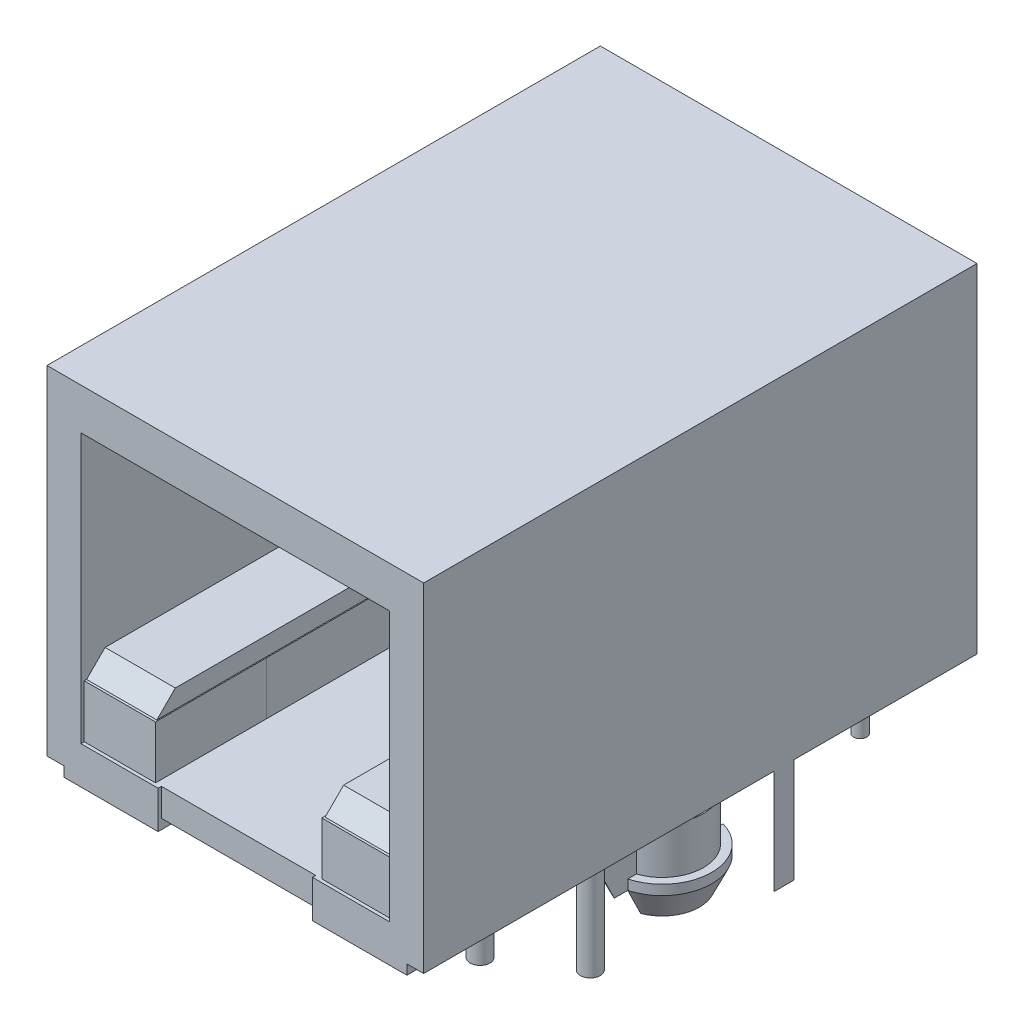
ISO-10303-21;
HEADER;
FILE_DESCRIPTION(('STEP AP214'),'2;1');
FILE_NAME('part.step','',(''),(''),'','','');
FILE_SCHEMA(('AUTOMOTIVE_DESIGN { 1 0 10303 214 1 1 1 1 }'));
ENDSEC;
DATA;
#1=APPLICATION_CONTEXT('core data for automotive mechanical design processes');
#2=APPLICATION_PROTOCOL_DEFINITION('international standard','automotive_design',2000,#1);
#3=PRODUCT_CONTEXT('',#1,'mechanical');
#4=PRODUCT('Part','Part','',(#3));
#5=PRODUCT_RELATED_PRODUCT_CATEGORY('part','',(#4));
#6=PRODUCT_DEFINITION_FORMATION('','',#4);
#7=PRODUCT_DEFINITION_CONTEXT('part definition',#1,'design');
#8=PRODUCT_DEFINITION('design','',#6,#7);
#9=PRODUCT_DEFINITION_SHAPE('','',#8);
#10=(LENGTH_UNIT() NAMED_UNIT(*) SI_UNIT(.MILLI.,.METRE.));
#11=(NAMED_UNIT(*) PLANE_ANGLE_UNIT() SI_UNIT($,.RADIAN.));
#12=(NAMED_UNIT(*) SI_UNIT($,.STERADIAN.) SOLID_ANGLE_UNIT());
#13=UNCERTAINTY_MEASURE_WITH_UNIT(LENGTH_MEASURE(1.E-05),#10,'distance_accuracy_value','');
#14=(GEOMETRIC_REPRESENTATION_CONTEXT(3) GLOBAL_UNCERTAINTY_ASSIGNED_CONTEXT((#13)) GLOBAL_UNIT_ASSIGNED_CONTEXT((#10,
#11,#12)) REPRESENTATION_CONTEXT('',''));
#15=CARTESIAN_POINT('',(0.,0.,0.));
#16=DIRECTION('',(0.,0.,1.));
#17=DIRECTION('',(1.,0.,0.));
#18=AXIS2_PLACEMENT_3D('',#15,#16,#17);
#19=CARTESIAN_POINT('',(7.25,0.,0.));
#20=DIRECTION('',(0.,1.,0.));
#21=DIRECTION('',(0.,0.,1.));
#22=AXIS2_PLACEMENT_3D('',#19,#20,#21);
#23=PLANE('',#22);
#24=CARTESIAN_POINT('',(1.905,0.,1.6912));
#25=DIRECTION('',(0.,1.,0.));
#26=DIRECTION('',(0.,0.,1.));
#27=AXIS2_PLACEMENT_3D('',#24,#25,#26);
#28=CIRCLE('',#27,0.254);
#29=CARTESIAN_POINT('',(1.905,0.,1.9452));
#30=VERTEX_POINT('',#29);
#31=EDGE_CURVE('E43',#30,#30,#28,.F.);
#32=ORIENTED_EDGE('',*,*,#31,.F.);
#33=EDGE_LOOP('',(#32));
#34=FACE_BOUND('',#33,.T.);
#35=CARTESIAN_POINT('',(-3.175,0.,1.6912));
#36=DIRECTION('',(0.,1.,0.));
#37=DIRECTION('',(0.,0.,1.));
#38=AXIS2_PLACEMENT_3D('',#35,#36,#37);
#39=CIRCLE('',#38,0.254);
#40=CARTESIAN_POINT('',(-3.175,0.,1.9452));
#41=VERTEX_POINT('',#40);
#42=EDGE_CURVE('E1362',#41,#41,#39,.F.);
#43=ORIENTED_EDGE('',*,*,#42,.F.);
#44=EDGE_LOOP('',(#43));
#45=FACE_BOUND('',#44,.T.);
#46=CARTESIAN_POINT('',(-1.905,0.,4.2312));
#47=DIRECTION('',(0.,1.,0.));
#48=DIRECTION('',(0.,0.,1.));
#49=AXIS2_PLACEMENT_3D('',#46,#47,#48);
#50=CIRCLE('',#49,0.254);
#51=CARTESIAN_POINT('',(-1.905,0.,4.4852));
#52=VERTEX_POINT('',#51);
#53=EDGE_CURVE('E1356',#52,#52,#50,.F.);
#54=ORIENTED_EDGE('',*,*,#53,.F.);
#55=EDGE_LOOP('',(#54));
#56=FACE_BOUND('',#55,.T.);
#57=CARTESIAN_POINT('',(3.175,0.,4.2312));
#58=DIRECTION('',(0.,1.,0.));
#59=DIRECTION('',(0.,0.,1.));
#60=AXIS2_PLACEMENT_3D('',#57,#58,#59);
#61=CIRCLE('',#60,0.254);
#62=CARTESIAN_POINT('',(3.175,0.,4.4852));
#63=VERTEX_POINT('',#62);
#64=EDGE_CURVE('E1350',#63,#63,#61,.F.);
#65=ORIENTED_EDGE('',*,*,#64,.F.);
#66=EDGE_LOOP('',(#65));
#67=FACE_BOUND('',#66,.T.);
#68=CARTESIAN_POINT('',(3.7846,0.,15.6612));
#69=DIRECTION('',(0.,1.,0.));
#70=DIRECTION('',(0.,0.,1.));
#71=AXIS2_PLACEMENT_3D('',#68,#69,#70);
#72=CIRCLE('',#71,0.381);
#73=CARTESIAN_POINT('',(3.7846,0.,16.0422));
#74=VERTEX_POINT('',#73);
#75=EDGE_CURVE('E1344',#74,#74,#72,.F.);
#76=ORIENTED_EDGE('',*,*,#75,.F.);
#77=EDGE_LOOP('',(#76));
#78=FACE_BOUND('',#77,.T.);
#79=CARTESIAN_POINT('',(-3.7846,0.,13.9594));
#80=DIRECTION('',(0.,1.,0.));
#81=DIRECTION('',(0.,0.,1.));
#82=AXIS2_PLACEMENT_3D('',#79,#80,#81);
#83=CIRCLE('',#82,0.381);
#84=CARTESIAN_POINT('',(-3.7846,0.,14.3404));
#85=VERTEX_POINT('',#84);
#86=EDGE_CURVE('E1338',#85,#85,#83,.F.);
#87=ORIENTED_EDGE('',*,*,#86,.F.);
#88=EDGE_LOOP('',(#87));
#89=FACE_BOUND('',#88,.T.);
#90=DIRECTION('',(0.,0.,-1.));
#91=VECTOR('',#90,1.);
#92=CARTESIAN_POINT('',(-6.223,0.,13.1212));
#93=LINE('',#92,#91);
#94=CARTESIAN_POINT('',(-6.223,0.,12.0852253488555));
#95=VERTEX_POINT('',#94);
#96=CARTESIAN_POINT('',(-6.223,0.,9.07717465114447));
#97=VERTEX_POINT('',#96);
#98=EDGE_CURVE('E718',#95,#97,#93,.T.);
#99=ORIENTED_EDGE('',*,*,#98,.T.);
#100=CARTESIAN_POINT('',(-5.715,0.,10.5812));
#101=DIRECTION('',(0.,-1.,0.));
#102=DIRECTION('',(0.,0.,-1.));
#103=AXIS2_PLACEMENT_3D('',#100,#101,#102);
#104=CIRCLE('',#103,1.5875);
#105=CARTESIAN_POINT('',(-6.927,0.,9.55591357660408));
#106=VERTEX_POINT('',#105);
#107=EDGE_CURVE('E995',#106,#97,#104,.T.);
#108=ORIENTED_EDGE('',*,*,#107,.F.);
#109=DIRECTION('',(0.,0.,-1.));
#110=VECTOR('',#109,1.);
#111=CARTESIAN_POINT('',(-6.927,0.,0.));
#112=LINE('',#111,#110);
#113=CARTESIAN_POINT('',(-6.927,0.,0.));
#114=VERTEX_POINT('',#113);
#115=EDGE_CURVE('E1010',#106,#114,#112,.T.);
#116=ORIENTED_EDGE('',*,*,#115,.T.);
#117=DIRECTION('',(-1.,0.,0.));
#118=VECTOR('',#117,1.);
#119=CARTESIAN_POINT('',(7.25,0.,0.));
#120=LINE('',#119,#118);
#121=CARTESIAN_POINT('',(6.927,0.,0.));
#122=VERTEX_POINT('',#121);
#123=EDGE_CURVE('E2540',#122,#114,#120,.T.);
#124=ORIENTED_EDGE('',*,*,#123,.F.);
#125=DIRECTION('',(0.,0.,-1.));
#126=VECTOR('',#125,1.);
#127=CARTESIAN_POINT('',(6.927,0.,0.));
#128=LINE('',#127,#126);
#129=CARTESIAN_POINT('',(6.927,0.,9.55591357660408));
#130=VERTEX_POINT('',#129);
#131=EDGE_CURVE('E2570',#130,#122,#128,.T.);
#132=ORIENTED_EDGE('',*,*,#131,.F.);
#133=CARTESIAN_POINT('',(5.715,0.,10.5812));
#134=DIRECTION('',(0.,-1.,0.));
#135=DIRECTION('',(0.,0.,-1.));
#136=AXIS2_PLACEMENT_3D('',#133,#134,#135);
#137=CIRCLE('',#136,1.5875);
#138=CARTESIAN_POINT('',(6.223,0.,9.07717465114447));
#139=VERTEX_POINT('',#138);
#140=EDGE_CURVE('E807',#139,#130,#137,.T.);
#141=ORIENTED_EDGE('',*,*,#140,.F.);
#142=DIRECTION('',(0.,0.,1.));
#143=VECTOR('',#142,1.);
#144=CARTESIAN_POINT('',(6.223,0.,13.1212));
#145=LINE('',#144,#143);
#146=CARTESIAN_POINT('',(6.223,0.,12.0852253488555));
#147=VERTEX_POINT('',#146);
#148=EDGE_CURVE('E762',#139,#147,#145,.T.);
#149=ORIENTED_EDGE('',*,*,#148,.T.);
#150=CARTESIAN_POINT('',(6.927,0.,11.6064864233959));
#151=VERTEX_POINT('',#150);
#152=EDGE_CURVE('E3081',#151,#147,#137,.T.);
#153=ORIENTED_EDGE('',*,*,#152,.F.);
#154=CARTESIAN_POINT('',(6.927,0.,21.3));
#155=VERTEX_POINT('',#154);
#156=EDGE_CURVE('E872',#155,#151,#128,.T.);
#157=ORIENTED_EDGE('',*,*,#156,.F.);
#158=DIRECTION('',(-1.,0.,0.));
#159=VECTOR('',#158,1.);
#160=CARTESIAN_POINT('',(7.25,0.,21.3));
#161=LINE('',#160,#159);
#162=CARTESIAN_POINT('',(6.604,0.,21.3));
#163=VERTEX_POINT('',#162);
#164=EDGE_CURVE('E867',#155,#163,#161,.T.);
#165=ORIENTED_EDGE('',*,*,#164,.T.);
#166=DIRECTION('',(0.,0.,1.));
#167=VECTOR('',#166,1.);
#168=CARTESIAN_POINT('',(6.604,0.,21.3));
#169=LINE('',#168,#167);
#170=CARTESIAN_POINT('',(6.604,0.,18.252));
#171=VERTEX_POINT('',#170);
#172=EDGE_CURVE('E849',#171,#163,#169,.T.);
#173=ORIENTED_EDGE('',*,*,#172,.F.);
#174=DIRECTION('',(1.,0.,0.));
#175=VECTOR('',#174,1.);
#176=CARTESIAN_POINT('',(-6.604,0.,18.252));
#177=LINE('',#176,#175);
#178=CARTESIAN_POINT('',(-6.604,0.,18.252));
#179=VERTEX_POINT('',#178);
#180=EDGE_CURVE('E846',#179,#171,#177,.T.);
#181=ORIENTED_EDGE('',*,*,#180,.F.);
#182=DIRECTION('',(0.,0.,-1.));
#183=VECTOR('',#182,1.);
#184=CARTESIAN_POINT('',(-6.604,0.,21.3));
#185=LINE('',#184,#183);
#186=CARTESIAN_POINT('',(-6.60399999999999,0.,21.3));
#187=VERTEX_POINT('',#186);
#188=EDGE_CURVE('E819',#187,#179,#185,.T.);
#189=ORIENTED_EDGE('',*,*,#188,.F.);
#190=CARTESIAN_POINT('',(-6.927,0.,21.3));
#191=VERTEX_POINT('',#190);
#192=EDGE_CURVE('E871',#187,#191,#161,.T.);
#193=ORIENTED_EDGE('',*,*,#192,.T.);
#194=CARTESIAN_POINT('',(-6.927,0.,11.6064864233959));
#195=VERTEX_POINT('',#194);
#196=EDGE_CURVE('E1004',#191,#195,#112,.T.);
#197=ORIENTED_EDGE('',*,*,#196,.T.);
#198=EDGE_CURVE('E811',#95,#195,#104,.T.);
#199=ORIENTED_EDGE('',*,*,#198,.F.);
#200=EDGE_LOOP('',(#99,#108,#116,#124,#132,#141,#149,#153,#157,#165,#173,#181,#189,#193,#197,#199));
#201=FACE_BOUND('',#200,.T.);
#202=DIRECTION('',(0.,0.,1.));
#203=VECTOR('',#202,1.);
#204=CARTESIAN_POINT('',(-5.207,0.,13.1212));
#205=LINE('',#204,#203);
#206=CARTESIAN_POINT('',(-5.207,0.,9.07717465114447));
#207=VERTEX_POINT('',#206);
#208=CARTESIAN_POINT('',(-5.207,0.,12.0852253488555));
#209=VERTEX_POINT('',#208);
#210=EDGE_CURVE('E720',#207,#209,#205,.T.);
#211=ORIENTED_EDGE('',*,*,#210,.T.);
#212=EDGE_CURVE('E996',#207,#209,#104,.T.);
#213=ORIENTED_EDGE('',*,*,#212,.F.);
#214=EDGE_LOOP('',(#211,#213));
#215=FACE_BOUND('',#214,.T.);
#216=DIRECTION('',(0.,0.,-1.));
#217=VECTOR('',#216,1.);
#218=CARTESIAN_POINT('',(5.207,0.,13.1212));
#219=LINE('',#218,#217);
#220=CARTESIAN_POINT('',(5.207,0.,12.0852253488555));
#221=VERTEX_POINT('',#220);
#222=CARTESIAN_POINT('',(5.207,0.,9.07717465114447));
#223=VERTEX_POINT('',#222);
#224=EDGE_CURVE('E760',#221,#223,#219,.T.);
#225=ORIENTED_EDGE('',*,*,#224,.T.);
#226=EDGE_CURVE('E3079',#221,#223,#137,.T.);
#227=ORIENTED_EDGE('',*,*,#226,.F.);
#228=EDGE_LOOP('',(#225,#227));
#229=FACE_BOUND('',#228,.T.);
#230=CARTESIAN_POINT('',(6.3246,0.,13.9594));
#231=DIRECTION('',(0.,1.,0.));
#232=DIRECTION('',(0.,0.,1.));
#233=AXIS2_PLACEMENT_3D('',#230,#231,#232);
#234=CIRCLE('',#233,0.381000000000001);
#235=CARTESIAN_POINT('',(6.3246,0.,14.3404));
#236=VERTEX_POINT('',#235);
#237=EDGE_CURVE('E1341',#236,#236,#234,.F.);
#238=ORIENTED_EDGE('',*,*,#237,.F.);
#239=EDGE_LOOP('',(#238));
#240=FACE_BOUND('',#239,.T.);
#241=CARTESIAN_POINT('',(-6.3246,0.,15.6612));
#242=DIRECTION('',(0.,1.,0.));
#243=DIRECTION('',(0.,0.,1.));
#244=AXIS2_PLACEMENT_3D('',#241,#242,#243);
#245=CIRCLE('',#244,0.381000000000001);
#246=CARTESIAN_POINT('',(-6.3246,0.,16.0422));
#247=VERTEX_POINT('',#246);
#248=EDGE_CURVE('E1347',#247,#247,#245,.F.);
#249=ORIENTED_EDGE('',*,*,#248,.F.);
#250=EDGE_LOOP('',(#249));
#251=FACE_BOUND('',#250,.T.);
#252=CARTESIAN_POINT('',(0.634999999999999,0.,4.2312));
#253=DIRECTION('',(0.,1.,0.));
#254=DIRECTION('',(0.,0.,1.));
#255=AXIS2_PLACEMENT_3D('',#252,#253,#254);
#256=CIRCLE('',#255,0.254);
#257=CARTESIAN_POINT('',(0.634999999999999,0.,4.4852));
#258=VERTEX_POINT('',#257);
#259=EDGE_CURVE('E1353',#258,#258,#256,.F.);
#260=ORIENTED_EDGE('',*,*,#259,.F.);
#261=EDGE_LOOP('',(#260));
#262=FACE_BOUND('',#261,.T.);
#263=CARTESIAN_POINT('',(-4.445,0.,4.2312));
#264=DIRECTION('',(0.,1.,0.));
#265=DIRECTION('',(0.,0.,1.));
#266=AXIS2_PLACEMENT_3D('',#263,#264,#265);
#267=CIRCLE('',#266,0.254);
#268=CARTESIAN_POINT('',(-4.445,0.,4.4852));
#269=VERTEX_POINT('',#268);
#270=EDGE_CURVE('E1359',#269,#269,#267,.F.);
#271=ORIENTED_EDGE('',*,*,#270,.F.);
#272=EDGE_LOOP('',(#271));
#273=FACE_BOUND('',#272,.T.);
#274=CARTESIAN_POINT('',(-0.635,0.,1.6912));
#275=DIRECTION('',(0.,1.,0.));
#276=DIRECTION('',(0.,0.,1.));
#277=AXIS2_PLACEMENT_3D('',#274,#275,#276);
#278=CIRCLE('',#277,0.254);
#279=CARTESIAN_POINT('',(-0.635,0.,1.9452));
#280=VERTEX_POINT('',#279);
#281=EDGE_CURVE('E1365',#280,#280,#278,.F.);
#282=ORIENTED_EDGE('',*,*,#281,.F.);
#283=EDGE_LOOP('',(#282));
#284=FACE_BOUND('',#283,.T.);
#285=CARTESIAN_POINT('',(4.445,0.,1.6912));
#286=DIRECTION('',(0.,1.,0.));
#287=DIRECTION('',(0.,0.,1.));
#288=AXIS2_PLACEMENT_3D('',#285,#286,#287);
#289=CIRCLE('',#288,0.254);
#290=CARTESIAN_POINT('',(4.445,0.,1.9452));
#291=VERTEX_POINT('',#290);
#292=EDGE_CURVE('E12',#291,#291,#289,.F.);
#293=ORIENTED_EDGE('',*,*,#292,.F.);
#294=EDGE_LOOP('',(#293));
#295=FACE_BOUND('',#294,.T.);
#296=ADVANCED_FACE('F34',(#34,#45,#56,#67,#78,#89,#201,#215,#229,#240,#251,#262,#273,#284,#295),
#23,.F.);
#297=CARTESIAN_POINT('',(-7.62,0.,7.4316));
#298=DIRECTION('',(0.,-1.,0.));
#299=DIRECTION('',(0.,0.,-1.));
#300=AXIS2_PLACEMENT_3D('',#297,#298,#299);
#301=CIRCLE('',#300,0.5334);
#302=CARTESIAN_POINT('',(-7.25,0.,7.04739229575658));
#303=VERTEX_POINT('',#302);
#304=CARTESIAN_POINT('',(-7.25,0.,7.81580770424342));
#305=VERTEX_POINT('',#304);
#306=EDGE_CURVE('E686',#303,#305,#301,.T.);
#307=ORIENTED_EDGE('',*,*,#306,.F.);
#308=DIRECTION('',(0.,0.,-1.));
#309=VECTOR('',#308,1.);
#310=CARTESIAN_POINT('',(-7.25,0.,0.));
#311=LINE('',#310,#309);
#312=CARTESIAN_POINT('',(-7.25,0.,0.));
#313=VERTEX_POINT('',#312);
#314=EDGE_CURVE('E972',#303,#313,#311,.T.);
#315=ORIENTED_EDGE('',*,*,#314,.T.);
#316=EDGE_CURVE('E2533',#114,#313,#120,.T.);
#317=ORIENTED_EDGE('',*,*,#316,.F.);
#318=ORIENTED_EDGE('',*,*,#115,.F.);
#319=CARTESIAN_POINT('',(-7.25,0.,10.1763157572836));
#320=VERTEX_POINT('',#319);
#321=EDGE_CURVE('E994',#320,#106,#104,.T.);
#322=ORIENTED_EDGE('',*,*,#321,.F.);
#323=EDGE_CURVE('E50',#320,#305,#311,.T.);
#324=ORIENTED_EDGE('',*,*,#323,.T.);
#325=EDGE_LOOP('',(#307,#315,#317,#318,#322,#324));
#326=FACE_BOUND('',#325,.T.);
#327=ADVANCED_FACE('F1374',(#326),#23,.F.);
#328=CARTESIAN_POINT('',(7.62,0.,7.4316));
#329=DIRECTION('',(0.,-1.,0.));
#330=DIRECTION('',(0.,0.,-1.));
#331=AXIS2_PLACEMENT_3D('',#328,#329,#330);
#332=CIRCLE('',#331,0.533400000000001);
#333=CARTESIAN_POINT('',(7.25,0.,7.81580770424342));
#334=VERTEX_POINT('',#333);
#335=CARTESIAN_POINT('',(7.25,0.,7.04739229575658));
#336=VERTEX_POINT('',#335);
#337=EDGE_CURVE('E58',#334,#336,#332,.T.);
#338=ORIENTED_EDGE('',*,*,#337,.F.);
#339=DIRECTION('',(0.,0.,-1.));
#340=VECTOR('',#339,1.);
#341=CARTESIAN_POINT('',(7.25,0.,0.));
#342=LINE('',#341,#340);
#343=CARTESIAN_POINT('',(7.25,0.,10.1763157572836));
#344=VERTEX_POINT('',#343);
#345=EDGE_CURVE('E3059',#344,#334,#342,.T.);
#346=ORIENTED_EDGE('',*,*,#345,.F.);
#347=EDGE_CURVE('E813',#130,#344,#137,.T.);
#348=ORIENTED_EDGE('',*,*,#347,.F.);
#349=ORIENTED_EDGE('',*,*,#131,.T.);
#350=CARTESIAN_POINT('',(7.25,0.,0.));
#351=VERTEX_POINT('',#350);
#352=EDGE_CURVE('E877',#351,#122,#120,.T.);
#353=ORIENTED_EDGE('',*,*,#352,.F.);
#354=EDGE_CURVE('E2530',#336,#351,#342,.T.);
#355=ORIENTED_EDGE('',*,*,#354,.F.);
#356=EDGE_LOOP('',(#338,#346,#348,#349,#353,#355));
#357=FACE_BOUND('',#356,.T.);
#358=ADVANCED_FACE('F1676',(#357),#23,.F.);
#359=CARTESIAN_POINT('',(-5.715,-1.8034,10.5812));
#360=DIRECTION('',(0.,1.,0.));
#361=DIRECTION('',(0.,0.,1.));
#362=AXIS2_PLACEMENT_3D('',#359,#360,#361);
#363=CYLINDRICAL_SURFACE('',#362,1.5875);
#364=CARTESIAN_POINT('',(-5.715,-1.8034,10.5812));
#365=DIRECTION('',(0.,-1.,0.));
#366=DIRECTION('',(0.,0.,-1.));
#367=AXIS2_PLACEMENT_3D('',#364,#365,#366);
#368=CIRCLE('',#367,1.5875);
#369=CARTESIAN_POINT('',(-6.223,-1.8034,12.0852253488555));
#370=VERTEX_POINT('',#369);
#371=CARTESIAN_POINT('',(-6.223,-1.8034,9.07717465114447));
#372=VERTEX_POINT('',#371);
#373=EDGE_CURVE('E820',#370,#372,#368,.T.);
#374=ORIENTED_EDGE('',*,*,#373,.F.);
#375=DIRECTION('',(0.,1.,0.));
#376=VECTOR('',#375,1.);
#377=CARTESIAN_POINT('',(-6.223,-1.8034,12.0852253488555));
#378=LINE('',#377,#376);
#379=EDGE_CURVE('E754',#370,#95,#378,.T.);
#380=ORIENTED_EDGE('',*,*,#379,.T.);
#381=ORIENTED_EDGE('',*,*,#198,.T.);
#382=CARTESIAN_POINT('',(-7.25,0.,10.9860842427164));
#383=VERTEX_POINT('',#382);
#384=EDGE_CURVE('E821',#195,#383,#104,.T.);
#385=ORIENTED_EDGE('',*,*,#384,.T.);
#386=EDGE_CURVE('E824',#383,#320,#104,.T.);
#387=ORIENTED_EDGE('',*,*,#386,.T.);
#388=ORIENTED_EDGE('',*,*,#321,.T.);
#389=ORIENTED_EDGE('',*,*,#107,.T.);
#390=DIRECTION('',(0.,1.,0.));
#391=VECTOR('',#390,1.);
#392=CARTESIAN_POINT('',(-6.223,-1.8034,9.07717465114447));
#393=LINE('',#392,#391);
#394=EDGE_CURVE('E747',#97,#372,#393,.F.);
#395=ORIENTED_EDGE('',*,*,#394,.T.);
#396=EDGE_LOOP('',(#374,#380,#381,#385,#387,#388,#389,#395));
#397=FACE_BOUND('',#396,.T.);
#398=ADVANCED_FACE('F992',(#397),#363,.T.);
#399=CARTESIAN_POINT('',(-5.715,-1.8034,10.5812));
#400=DIRECTION('',(0.,-1.,0.));
#401=DIRECTION('',(0.,0.,-1.));
#402=AXIS2_PLACEMENT_3D('',#399,#400,#401);
#403=PLANE('',#402);
#404=CARTESIAN_POINT('',(-5.715,-1.8034,10.5812));
#405=DIRECTION('',(0.,-1.,0.));
#406=DIRECTION('',(0.,0.,-1.));
#407=AXIS2_PLACEMENT_3D('',#404,#405,#406);
#408=CIRCLE('',#407,1.905);
#409=CARTESIAN_POINT('',(-6.223,-1.8034,12.4172177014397));
#410=VERTEX_POINT('',#409);
#411=CARTESIAN_POINT('',(-6.223,-1.8034,8.74518229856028));
#412=VERTEX_POINT('',#411);
#413=EDGE_CURVE('E799',#410,#412,#408,.T.);
#414=ORIENTED_EDGE('',*,*,#413,.F.);
#415=DIRECTION('',(0.,0.,-1.));
#416=VECTOR('',#415,1.);
#417=CARTESIAN_POINT('',(-6.223,-1.8034,10.5812));
#418=LINE('',#417,#416);
#419=EDGE_CURVE('E748',#410,#370,#418,.T.);
#420=ORIENTED_EDGE('',*,*,#419,.T.);
#421=ORIENTED_EDGE('',*,*,#373,.T.);
#422=EDGE_CURVE('E744',#372,#412,#418,.T.);
#423=ORIENTED_EDGE('',*,*,#422,.T.);
#424=EDGE_LOOP('',(#414,#420,#421,#423));
#425=FACE_BOUND('',#424,.T.);
#426=ADVANCED_FACE('F1072',(#425),#403,.F.);
#427=CARTESIAN_POINT('',(-5.715,-3.2004,10.5812));
#428=DIRECTION('',(0.,1.,0.));
#429=DIRECTION('',(0.,0.,1.));
#430=AXIS2_PLACEMENT_3D('',#427,#428,#429);
#431=CYLINDRICAL_SURFACE('',#430,1.905);
#432=CARTESIAN_POINT('',(-5.715,-2.18439999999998,10.5812));
#433=DIRECTION('',(0.,-1.,0.));
#434=DIRECTION('',(0.,0.,-1.));
#435=AXIS2_PLACEMENT_3D('',#432,#433,#434);
#436=CIRCLE('',#435,1.905);
#437=CARTESIAN_POINT('',(-6.223,-2.18440000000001,8.74518229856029));
#438=VERTEX_POINT('',#437);
#439=CARTESIAN_POINT('',(-6.223,-2.18439999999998,12.4172177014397));
#440=VERTEX_POINT('',#439);
#441=EDGE_CURVE('E1023',#438,#440,#436,.F.);
#442=ORIENTED_EDGE('',*,*,#441,.T.);
#443=DIRECTION('',(0.,1.,0.));
#444=VECTOR('',#443,1.);
#445=CARTESIAN_POINT('',(-6.223,-3.2004,12.4172177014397));
#446=LINE('',#445,#444);
#447=EDGE_CURVE('E751',#440,#410,#446,.T.);
#448=ORIENTED_EDGE('',*,*,#447,.T.);
#449=ORIENTED_EDGE('',*,*,#413,.T.);
#450=DIRECTION('',(0.,1.,0.));
#451=VECTOR('',#450,1.);
#452=CARTESIAN_POINT('',(-6.223,-3.2004,8.74518229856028));
#453=LINE('',#452,#451);
#454=EDGE_CURVE('E741',#412,#438,#453,.F.);
#455=ORIENTED_EDGE('',*,*,#454,.T.);
#456=EDGE_LOOP('',(#442,#448,#449,#455));
#457=FACE_BOUND('',#456,.T.);
#458=ADVANCED_FACE('F1076',(#457),#431,.T.);
#459=CARTESIAN_POINT('',(-5.715,-3.2004,10.5812));
#460=DIRECTION('',(0.,-1.,0.));
#461=DIRECTION('',(0.,0.,-1.));
#462=AXIS2_PLACEMENT_3D('',#459,#460,#461);
#463=PLANE('',#462);
#464=DIRECTION('',(0.,0.,-1.));
#465=VECTOR('',#464,1.);
#466=CARTESIAN_POINT('',(-6.223,-3.2004,13.1212));
#467=LINE('',#466,#465);
#468=CARTESIAN_POINT('',(-6.223,-3.2004,11.9192431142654));
#469=VERTEX_POINT('',#468);
#470=CARTESIAN_POINT('',(-6.223,-3.2004,9.24315688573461));
#471=VERTEX_POINT('',#470);
#472=EDGE_CURVE('E716',#469,#471,#467,.T.);
#473=ORIENTED_EDGE('',*,*,#472,.F.);
#474=CARTESIAN_POINT('',(-5.715,-3.2004,10.5812));
#475=DIRECTION('',(0.,-1.,0.));
#476=DIRECTION('',(0.,0.,-1.));
#477=AXIS2_PLACEMENT_3D('',#474,#475,#476);
#478=CIRCLE('',#477,1.43123141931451);
#479=EDGE_CURVE('E1009',#469,#471,#478,.T.);
#480=ORIENTED_EDGE('',*,*,#479,.T.);
#481=EDGE_LOOP('',(#473,#480));
#482=FACE_BOUND('',#481,.T.);
#483=ADVANCED_FACE('F1066',(#482),#463,.T.);
#484=CARTESIAN_POINT('',(-5.715,-3.2004,10.5812));
#485=DIRECTION('',(0.,1.,0.));
#486=DIRECTION('',(0.,0.,1.));
#487=AXIS2_PLACEMENT_3D('',#484,#485,#486);
#488=CONICAL_SURFACE('',#487,1.43123141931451,0.436332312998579);
#489=CARTESIAN_POINT('',(-6.223,0.181684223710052,13.5463213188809));
#490=CARTESIAN_POINT('',(-6.223,0.0219746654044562,13.47075938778));
#491=CARTESIAN_POINT('',(-6.223,-0.137705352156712,13.3951348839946));
#492=CARTESIAN_POINT('',(-6.223,-0.456984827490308,13.2437136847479));
#493=CARTESIAN_POINT('',(-6.223,-0.616584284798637,13.167916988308));
#494=CARTESIAN_POINT('',(-6.223,-0.935801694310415,13.0160470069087));
#495=CARTESIAN_POINT('',(-6.223,-1.09541956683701,12.939973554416));
#496=CARTESIAN_POINT('',(-6.223,-1.41451586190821,12.7875363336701));
#497=CARTESIAN_POINT('',(-6.223,-1.57399428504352,12.7111725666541));
#498=CARTESIAN_POINT('',(-6.223,-1.89181559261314,12.5585023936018));
#499=CARTESIAN_POINT('',(-6.223,-2.05015960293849,12.4821983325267));
#500=CARTESIAN_POINT('',(-6.223,-2.36657994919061,12.3290373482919));
#501=CARTESIAN_POINT('',(-6.223,-2.52465628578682,12.2521804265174));
#502=CARTESIAN_POINT('',(-6.223,-2.84030754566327,12.0976932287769));
#503=CARTESIAN_POINT('',(-6.223,-2.99788272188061,12.0200634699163));
#504=CARTESIAN_POINT('',(-6.223,-3.31239515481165,11.8635265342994));
#505=CARTESIAN_POINT('',(-6.223,-3.46933243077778,11.7846193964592));
#506=CARTESIAN_POINT('',(-6.223,-3.73166296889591,11.6503577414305));
#507=CARTESIAN_POINT('',(-6.223,-3.83736599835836,11.5956092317));
#508=CARTESIAN_POINT('',(-6.223,-4.04806678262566,11.4844376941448));
#509=CARTESIAN_POINT('',(-6.223,-4.15306348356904,11.4280126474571));
#510=CARTESIAN_POINT('',(-6.223,-4.30989036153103,11.341024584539));
#511=CARTESIAN_POINT('',(-6.223,-4.36229306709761,11.3114960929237));
#512=CARTESIAN_POINT('',(-6.223,-4.46654736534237,11.25144150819));
#513=CARTESIAN_POINT('',(-6.223,-4.51839880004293,11.2209151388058));
#514=CARTESIAN_POINT('',(-6.223,-4.62112117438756,11.1585154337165));
#515=CARTESIAN_POINT('',(-6.223,-4.67199412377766,11.12664541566));
#516=CARTESIAN_POINT('',(-6.223,-4.77233877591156,11.0607843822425));
#517=CARTESIAN_POINT('',(-6.223,-4.82181135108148,11.0267947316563));
#518=CARTESIAN_POINT('',(-6.223,-4.89442900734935,10.9728477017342));
#519=CARTESIAN_POINT('',(-6.223,-4.91855160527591,10.9542141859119));
#520=CARTESIAN_POINT('',(-6.223,-4.96583158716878,10.9156392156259));
#521=CARTESIAN_POINT('',(-6.223,-4.98898678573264,10.8956950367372));
#522=CARTESIAN_POINT('',(-6.223,-5.0333464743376,10.8543689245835));
#523=CARTESIAN_POINT('',(-6.223,-5.05457509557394,10.8330131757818));
#524=CARTESIAN_POINT('',(-6.223,-5.09432927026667,10.7879548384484));
#525=CARTESIAN_POINT('',(-6.223,-5.11286638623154,10.7642630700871));
#526=CARTESIAN_POINT('',(-6.223,-5.13767793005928,10.7252355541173));
#527=CARTESIAN_POINT('',(-6.223,-5.14568753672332,10.7110217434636));
#528=CARTESIAN_POINT('',(-6.223,-5.15963227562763,10.6815916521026));
#529=CARTESIAN_POINT('',(-6.223,-5.16556943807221,10.6663763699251));
#530=CARTESIAN_POINT('',(-6.223,-5.17397928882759,10.6374562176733));
#531=CARTESIAN_POINT('',(-6.223,-5.17683752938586,10.6238661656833));
#532=CARTESIAN_POINT('',(-6.223,-5.18018424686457,10.5963961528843));
#533=CARTESIAN_POINT('',(-6.223,-5.18067455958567,10.582516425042));
#534=CARTESIAN_POINT('',(-6.223,-5.17921887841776,10.5548950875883));
#535=CARTESIAN_POINT('',(-6.223,-5.17727374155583,10.5411534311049));
#536=CARTESIAN_POINT('',(-6.223,-5.1712100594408,10.5141622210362));
#537=CARTESIAN_POINT('',(-6.223,-5.16708922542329,10.5009132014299));
#538=CARTESIAN_POINT('',(-6.223,-5.15436015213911,10.4680101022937));
#539=CARTESIAN_POINT('',(-6.223,-5.14453036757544,10.4488363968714));
#540=CARTESIAN_POINT('',(-6.223,-5.12215962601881,10.4121440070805));
#541=CARTESIAN_POINT('',(-6.223,-5.10960917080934,10.3946314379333));
#542=CARTESIAN_POINT('',(-6.223,-5.07636670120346,10.3529161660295));
#543=CARTESIAN_POINT('',(-6.223,-5.05465863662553,10.3295378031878));
#544=CARTESIAN_POINT('',(-6.223,-5.00916914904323,10.2848636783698));
#545=CARTESIAN_POINT('',(-6.223,-4.98538255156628,10.2635734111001));
#546=CARTESIAN_POINT('',(-6.223,-4.93639007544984,10.2223475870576));
#547=CARTESIAN_POINT('',(-6.223,-4.91117545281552,10.2024225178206));
#548=CARTESIAN_POINT('',(-6.223,-4.85995148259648,10.1637068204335));
#549=CARTESIAN_POINT('',(-6.223,-4.83394320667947,10.1449147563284));
#550=CARTESIAN_POINT('',(-6.223,-4.74729420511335,10.0843071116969));
#551=CARTESIAN_POINT('',(-6.223,-4.68545375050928,10.0442165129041));
#552=CARTESIAN_POINT('',(-6.223,-4.56028425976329,9.96641601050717));
#553=CARTESIAN_POINT('',(-6.223,-4.49695438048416,9.92870750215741));
#554=CARTESIAN_POINT('',(-6.223,-4.36928486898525,9.85475781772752));
#555=CARTESIAN_POINT('',(-6.223,-4.30494355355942,9.8185195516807));
#556=CARTESIAN_POINT('',(-6.223,-4.1757061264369,9.74709367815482));
#557=CARTESIAN_POINT('',(-6.223,-4.11081016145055,9.71190580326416));
#558=CARTESIAN_POINT('',(-6.223,-3.98083163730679,9.64238386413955));
#559=CARTESIAN_POINT('',(-6.223,-3.91575035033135,9.60804741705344));
#560=CARTESIAN_POINT('',(-6.223,-3.78529871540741,9.53991913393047));
#561=CARTESIAN_POINT('',(-6.223,-3.71992834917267,9.50612733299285));
#562=CARTESIAN_POINT('',(-6.223,-3.52363943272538,9.40544022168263));
#563=CARTESIAN_POINT('',(-6.223,-3.39240545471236,9.33916041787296));
#564=CARTESIAN_POINT('',(-6.223,-3.11842336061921,9.20210576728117));
#565=CARTESIAN_POINT('',(-6.223,-2.97563125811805,9.13141924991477));
#566=CARTESIAN_POINT('',(-6.223,-2.68966298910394,8.99082347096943));
#567=CARTESIAN_POINT('',(-6.223,-2.54648681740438,8.92091421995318));
#568=CARTESIAN_POINT('',(-6.223,-2.11644877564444,8.71190755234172));
#569=CARTESIAN_POINT('',(-6.223,-1.82920597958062,8.573594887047));
#570=CARTESIAN_POINT('',(-6.223,-1.25478914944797,8.29834668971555));
#571=CARTESIAN_POINT('',(-6.223,-0.967616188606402,8.16140891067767));
#572=CARTESIAN_POINT('',(-6.223,-0.536692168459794,7.95653790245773));
#573=CARTESIAN_POINT('',(-6.223,-0.393060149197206,7.88835421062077));
#574=CARTESIAN_POINT('',(-6.223,-0.105732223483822,7.75212252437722));
#575=CARTESIAN_POINT('',(-6.223,0.0379636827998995,7.68407452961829));
#576=CARTESIAN_POINT('',(-6.223,0.181684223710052,7.61607868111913));
#577=B_SPLINE_CURVE_WITH_KNOTS('',3,(#489,#490,#491,#492,#493,#494,#495,#496,#497,#498,#499,
#500,#501,#502,#503,#504,#505,#506,#507,#508,#509,#510,#511,#512,#513,#514,#515,#516,#517,#518,
#519,#520,#521,#522,#523,#524,#525,#526,#527,#528,#529,#530,#531,#532,#533,#534,#535,#536,#537,
#538,#539,#540,#541,#542,#543,#544,#545,#546,#547,#548,#549,#550,#551,#552,#553,#554,#555,#556,
#557,#558,#559,#560,#561,#562,#563,#564,#565,#566,#567,#568,#569,#570,#571,#572,#573,#574,#575,
#576),.UNSPECIFIED.,.F.,.F.,(4,2,2,2,2,2,2,2,2,2,2,2,2,2,2,2,2,2,2,2,2,2,2,2,2,2,2,2,2,2,2,2,2,
2,2,2,2,2,2,2,2,2,2,4),(0.,0.530047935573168,1.06009889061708,1.59055632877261,2.12101150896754,
2.64832122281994,3.17562961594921,3.70260617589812,4.2295667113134,4.58668096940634,
4.94424423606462,5.12468644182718,5.30517903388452,5.48524944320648,5.66520508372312,
5.7566218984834,5.84823514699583,5.93846831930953,6.02830159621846,6.07713085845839,
6.12591215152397,6.16739167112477,6.20883902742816,6.25027180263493,6.29174825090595,
6.35601300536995,6.42050583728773,6.51595973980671,6.61165843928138,6.70802479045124,
6.80426632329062,7.02523691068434,7.24633574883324,7.46785274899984,7.68931286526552,
7.91006043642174,8.1308221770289,8.57187867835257,9.04986688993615,9.52786158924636,
10.4842814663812,11.4387346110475,11.9157172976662,12.3926987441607),.UNSPECIFIED.);
#578=EDGE_CURVE('E1336',#440,#469,#577,.T.);
#579=ORIENTED_EDGE('',*,*,#578,.F.);
#580=ORIENTED_EDGE('',*,*,#441,.F.);
#581=EDGE_CURVE('E1331',#471,#438,#577,.T.);
#582=ORIENTED_EDGE('',*,*,#581,.F.);
#583=ORIENTED_EDGE('',*,*,#479,.F.);
#584=EDGE_LOOP('',(#579,#580,#582,#583));
#585=FACE_BOUND('',#584,.T.);
#586=ADVANCED_FACE('F1324',(#585),#488,.T.);
#587=CARTESIAN_POINT('',(5.715,-1.8034,10.5812));
#588=DIRECTION('',(0.,1.,0.));
#589=DIRECTION('',(0.,0.,1.));
#590=AXIS2_PLACEMENT_3D('',#587,#588,#589);
#591=CYLINDRICAL_SURFACE('',#590,1.5875);
#592=CARTESIAN_POINT('',(5.715,-1.8034,10.5812));
#593=DIRECTION('',(0.,-1.,0.));
#594=DIRECTION('',(0.,0.,-1.));
#595=AXIS2_PLACEMENT_3D('',#592,#593,#594);
#596=CIRCLE('',#595,1.5875);
#597=CARTESIAN_POINT('',(5.207,-1.8034,12.0852253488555));
#598=VERTEX_POINT('',#597);
#599=CARTESIAN_POINT('',(5.207,-1.8034,9.07717465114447));
#600=VERTEX_POINT('',#599);
#601=EDGE_CURVE('E812',#598,#600,#596,.T.);
#602=ORIENTED_EDGE('',*,*,#601,.F.);
#603=DIRECTION('',(0.,1.,0.));
#604=VECTOR('',#603,1.);
#605=CARTESIAN_POINT('',(5.207,-1.8034,12.0852253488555));
#606=LINE('',#605,#604);
#607=EDGE_CURVE('E796',#598,#221,#606,.T.);
#608=ORIENTED_EDGE('',*,*,#607,.T.);
#609=ORIENTED_EDGE('',*,*,#226,.T.);
#610=DIRECTION('',(0.,1.,0.));
#611=VECTOR('',#610,1.);
#612=CARTESIAN_POINT('',(5.207,-1.8034,9.07717465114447));
#613=LINE('',#612,#611);
#614=EDGE_CURVE('E789',#223,#600,#613,.F.);
#615=ORIENTED_EDGE('',*,*,#614,.T.);
#616=EDGE_LOOP('',(#602,#608,#609,#615));
#617=FACE_BOUND('',#616,.T.);
#618=ADVANCED_FACE('F1100',(#617),#591,.T.);
#619=CARTESIAN_POINT('',(5.715,-1.8034,10.5812));
#620=DIRECTION('',(0.,-1.,0.));
#621=DIRECTION('',(0.,0.,-1.));
#622=AXIS2_PLACEMENT_3D('',#619,#620,#621);
#623=PLANE('',#622);
#624=CARTESIAN_POINT('',(5.715,-1.8034,10.5812));
#625=DIRECTION('',(0.,-1.,0.));
#626=DIRECTION('',(0.,0.,-1.));
#627=AXIS2_PLACEMENT_3D('',#624,#625,#626);
#628=CIRCLE('',#627,1.905);
#629=CARTESIAN_POINT('',(5.207,-1.8034,12.4172177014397));
#630=VERTEX_POINT('',#629);
#631=CARTESIAN_POINT('',(5.207,-1.8034,8.74518229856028));
#632=VERTEX_POINT('',#631);
#633=EDGE_CURVE('E803',#630,#632,#628,.T.);
#634=ORIENTED_EDGE('',*,*,#633,.F.);
#635=DIRECTION('',(0.,0.,-1.));
#636=VECTOR('',#635,1.);
#637=CARTESIAN_POINT('',(5.207,-1.8034,10.5812));
#638=LINE('',#637,#636);
#639=EDGE_CURVE('E790',#630,#598,#638,.T.);
#640=ORIENTED_EDGE('',*,*,#639,.T.);
#641=ORIENTED_EDGE('',*,*,#601,.T.);
#642=EDGE_CURVE('E786',#600,#632,#638,.T.);
#643=ORIENTED_EDGE('',*,*,#642,.T.);
#644=EDGE_LOOP('',(#634,#640,#641,#643));
#645=FACE_BOUND('',#644,.T.);
#646=ADVANCED_FACE('F1087',(#645),#623,.F.);
#647=CARTESIAN_POINT('',(5.715,-3.2004,10.5812));
#648=DIRECTION('',(0.,1.,0.));
#649=DIRECTION('',(0.,0.,1.));
#650=AXIS2_PLACEMENT_3D('',#647,#648,#649);
#651=CYLINDRICAL_SURFACE('',#650,1.905);
#652=CARTESIAN_POINT('',(5.715,-2.18439999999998,10.5812));
#653=DIRECTION('',(0.,-1.,0.));
#654=DIRECTION('',(0.,0.,-1.));
#655=AXIS2_PLACEMENT_3D('',#652,#653,#654);
#656=CIRCLE('',#655,1.905);
#657=CARTESIAN_POINT('',(5.207,-2.18440000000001,8.74518229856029));
#658=VERTEX_POINT('',#657);
#659=CARTESIAN_POINT('',(5.207,-2.18439999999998,12.4172177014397));
#660=VERTEX_POINT('',#659);
#661=EDGE_CURVE('E1031',#658,#660,#656,.F.);
#662=ORIENTED_EDGE('',*,*,#661,.T.);
#663=DIRECTION('',(0.,1.,0.));
#664=VECTOR('',#663,1.);
#665=CARTESIAN_POINT('',(5.207,-3.2004,12.4172177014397));
#666=LINE('',#665,#664);
#667=EDGE_CURVE('E793',#660,#630,#666,.T.);
#668=ORIENTED_EDGE('',*,*,#667,.T.);
#669=ORIENTED_EDGE('',*,*,#633,.T.);
#670=DIRECTION('',(0.,1.,0.));
#671=VECTOR('',#670,1.);
#672=CARTESIAN_POINT('',(5.207,-3.2004,8.74518229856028));
#673=LINE('',#672,#671);
#674=EDGE_CURVE('E783',#632,#658,#673,.F.);
#675=ORIENTED_EDGE('',*,*,#674,.T.);
#676=EDGE_LOOP('',(#662,#668,#669,#675));
#677=FACE_BOUND('',#676,.T.);
#678=ADVANCED_FACE('F1091',(#677),#651,.T.);
#679=CARTESIAN_POINT('',(5.715,-3.2004,10.5812));
#680=DIRECTION('',(0.,-1.,0.));
#681=DIRECTION('',(0.,0.,-1.));
#682=AXIS2_PLACEMENT_3D('',#679,#680,#681);
#683=PLANE('',#682);
#684=DIRECTION('',(0.,0.,-1.));
#685=VECTOR('',#684,1.);
#686=CARTESIAN_POINT('',(5.207,-3.2004,13.1212));
#687=LINE('',#686,#685);
#688=CARTESIAN_POINT('',(5.207,-3.2004,11.9192431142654));
#689=VERTEX_POINT('',#688);
#690=CARTESIAN_POINT('',(5.207,-3.2004,9.24315688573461));
#691=VERTEX_POINT('',#690);
#692=EDGE_CURVE('E758',#689,#691,#687,.T.);
#693=ORIENTED_EDGE('',*,*,#692,.F.);
#694=CARTESIAN_POINT('',(5.715,-3.2004,10.5812));
#695=DIRECTION('',(0.,-1.,0.));
#696=DIRECTION('',(0.,0.,-1.));
#697=AXIS2_PLACEMENT_3D('',#694,#695,#696);
#698=CIRCLE('',#697,1.43123141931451);
#699=EDGE_CURVE('E1026',#689,#691,#698,.T.);
#700=ORIENTED_EDGE('',*,*,#699,.T.);
#701=EDGE_LOOP('',(#693,#700));
#702=FACE_BOUND('',#701,.T.);
#703=ADVANCED_FACE('F1081',(#702),#683,.T.);
#704=CARTESIAN_POINT('',(5.715,-3.2004,10.5812));
#705=DIRECTION('',(0.,1.,0.));
#706=DIRECTION('',(0.,0.,1.));
#707=AXIS2_PLACEMENT_3D('',#704,#705,#706);
#708=CONICAL_SURFACE('',#707,1.43123141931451,0.43633231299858);
#709=CARTESIAN_POINT('',(5.207,0.181684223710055,13.5463213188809));
#710=CARTESIAN_POINT('',(5.207,0.0219746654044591,13.47075938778));
#711=CARTESIAN_POINT('',(5.207,-0.137705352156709,13.3951348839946));
#712=CARTESIAN_POINT('',(5.207,-0.456984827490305,13.2437136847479));
#713=CARTESIAN_POINT('',(5.207,-0.616584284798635,13.167916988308));
#714=CARTESIAN_POINT('',(5.207,-0.935801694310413,13.0160470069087));
#715=CARTESIAN_POINT('',(5.207,-1.09541956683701,12.939973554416));
#716=CARTESIAN_POINT('',(5.207,-1.41451586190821,12.7875363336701));
#717=CARTESIAN_POINT('',(5.207,-1.57399428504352,12.7111725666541));
#718=CARTESIAN_POINT('',(5.207,-1.89181559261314,12.5585023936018));
#719=CARTESIAN_POINT('',(5.207,-2.05015960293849,12.4821983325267));
#720=CARTESIAN_POINT('',(5.207,-2.36657994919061,12.3290373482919));
#721=CARTESIAN_POINT('',(5.207,-2.52465628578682,12.2521804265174));
#722=CARTESIAN_POINT('',(5.207,-2.84030754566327,12.0976932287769));
#723=CARTESIAN_POINT('',(5.207,-2.99788272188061,12.0200634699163));
#724=CARTESIAN_POINT('',(5.207,-3.31239515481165,11.8635265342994));
#725=CARTESIAN_POINT('',(5.207,-3.46933243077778,11.7846193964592));
#726=CARTESIAN_POINT('',(5.207,-3.73166296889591,11.6503577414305));
#727=CARTESIAN_POINT('',(5.207,-3.83736599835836,11.5956092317));
#728=CARTESIAN_POINT('',(5.207,-4.04806678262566,11.4844376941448));
#729=CARTESIAN_POINT('',(5.207,-4.15306348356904,11.4280126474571));
#730=CARTESIAN_POINT('',(5.207,-4.30989036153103,11.341024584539));
#731=CARTESIAN_POINT('',(5.207,-4.36229306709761,11.3114960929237));
#732=CARTESIAN_POINT('',(5.207,-4.46654736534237,11.25144150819));
#733=CARTESIAN_POINT('',(5.207,-4.51839880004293,11.2209151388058));
#734=CARTESIAN_POINT('',(5.207,-4.62112117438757,11.1585154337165));
#735=CARTESIAN_POINT('',(5.207,-4.67199412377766,11.12664541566));
#736=CARTESIAN_POINT('',(5.207,-4.77233877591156,11.0607843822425));
#737=CARTESIAN_POINT('',(5.207,-4.82181135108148,11.0267947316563));
#738=CARTESIAN_POINT('',(5.207,-4.89442900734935,10.9728477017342));
#739=CARTESIAN_POINT('',(5.207,-4.91855160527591,10.9542141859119));
#740=CARTESIAN_POINT('',(5.207,-4.96583158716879,10.9156392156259));
#741=CARTESIAN_POINT('',(5.207,-4.98898678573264,10.8956950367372));
#742=CARTESIAN_POINT('',(5.207,-5.0333464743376,10.8543689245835));
#743=CARTESIAN_POINT('',(5.207,-5.05457509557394,10.8330131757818));
#744=CARTESIAN_POINT('',(5.207,-5.09432927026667,10.7879548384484));
#745=CARTESIAN_POINT('',(5.207,-5.11286638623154,10.7642630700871));
#746=CARTESIAN_POINT('',(5.207,-5.13767793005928,10.7252355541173));
#747=CARTESIAN_POINT('',(5.207,-5.14568753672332,10.7110217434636));
#748=CARTESIAN_POINT('',(5.207,-5.15963227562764,10.6815916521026));
#749=CARTESIAN_POINT('',(5.207,-5.16556943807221,10.6663763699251));
#750=CARTESIAN_POINT('',(5.207,-5.17397928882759,10.6374562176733));
#751=CARTESIAN_POINT('',(5.207,-5.17683752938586,10.6238661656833));
#752=CARTESIAN_POINT('',(5.207,-5.18018424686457,10.5963961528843));
#753=CARTESIAN_POINT('',(5.207,-5.18067455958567,10.582516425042));
#754=CARTESIAN_POINT('',(5.207,-5.17921887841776,10.5548950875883));
#755=CARTESIAN_POINT('',(5.207,-5.17727374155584,10.5411534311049));
#756=CARTESIAN_POINT('',(5.207,-5.1712100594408,10.5141622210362));
#757=CARTESIAN_POINT('',(5.207,-5.16708922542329,10.5009132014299));
#758=CARTESIAN_POINT('',(5.207,-5.15436015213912,10.4680101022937));
#759=CARTESIAN_POINT('',(5.207,-5.14453036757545,10.4488363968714));
#760=CARTESIAN_POINT('',(5.207,-5.12215962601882,10.4121440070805));
#761=CARTESIAN_POINT('',(5.207,-5.10960917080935,10.3946314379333));
#762=CARTESIAN_POINT('',(5.207,-5.07636670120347,10.3529161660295));
#763=CARTESIAN_POINT('',(5.207,-5.05465863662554,10.3295378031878));
#764=CARTESIAN_POINT('',(5.207,-5.00916914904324,10.2848636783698));
#765=CARTESIAN_POINT('',(5.207,-4.98538255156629,10.2635734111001));
#766=CARTESIAN_POINT('',(5.207,-4.93639007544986,10.2223475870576));
#767=CARTESIAN_POINT('',(5.207,-4.91117545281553,10.2024225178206));
#768=CARTESIAN_POINT('',(5.207,-4.8599514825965,10.1637068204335));
#769=CARTESIAN_POINT('',(5.207,-4.8339432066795,10.1449147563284));
#770=CARTESIAN_POINT('',(5.207,-4.74729420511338,10.084307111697));
#771=CARTESIAN_POINT('',(5.207,-4.68545375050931,10.0442165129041));
#772=CARTESIAN_POINT('',(5.207,-4.56028425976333,9.9664160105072));
#773=CARTESIAN_POINT('',(5.207,-4.49695438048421,9.92870750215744));
#774=CARTESIAN_POINT('',(5.207,-4.36928486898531,9.85475781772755));
#775=CARTESIAN_POINT('',(5.207,-4.30494355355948,9.81851955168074));
#776=CARTESIAN_POINT('',(5.207,-4.17570612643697,9.74709367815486));
#777=CARTESIAN_POINT('',(5.207,-4.11081016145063,9.7119058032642));
#778=CARTESIAN_POINT('',(5.207,-3.98083163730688,9.6423838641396));
#779=CARTESIAN_POINT('',(5.207,-3.91575035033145,9.60804741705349));
#780=CARTESIAN_POINT('',(5.207,-3.78529871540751,9.53991913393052));
#781=CARTESIAN_POINT('',(5.207,-3.71992834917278,9.5061273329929));
#782=CARTESIAN_POINT('',(5.207,-3.5236394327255,9.40544022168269));
#783=CARTESIAN_POINT('',(5.207,-3.39240545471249,9.33916041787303));
#784=CARTESIAN_POINT('',(5.207,-3.11842336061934,9.20210576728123));
#785=CARTESIAN_POINT('',(5.207,-2.97563125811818,9.13141924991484));
#786=CARTESIAN_POINT('',(5.207,-2.68966298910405,8.99082347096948));
#787=CARTESIAN_POINT('',(5.207,-2.54648681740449,8.92091421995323));
#788=CARTESIAN_POINT('',(5.207,-2.11644877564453,8.71190755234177));
#789=CARTESIAN_POINT('',(5.207,-1.8292059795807,8.57359488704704));
#790=CARTESIAN_POINT('',(5.207,-1.25478914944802,8.29834668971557));
#791=CARTESIAN_POINT('',(5.207,-0.967616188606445,8.1614089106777));
#792=CARTESIAN_POINT('',(5.207,-0.536692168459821,7.95653790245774));
#793=CARTESIAN_POINT('',(5.207,-0.393060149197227,7.88835421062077));
#794=CARTESIAN_POINT('',(5.207,-0.105732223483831,7.75212252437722));
#795=CARTESIAN_POINT('',(5.207,0.0379636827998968,7.68407452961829));
#796=CARTESIAN_POINT('',(5.207,0.181684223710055,7.61607868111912));
#797=B_SPLINE_CURVE_WITH_KNOTS('',3,(#709,#710,#711,#712,#713,#714,#715,#716,#717,#718,#719,
#720,#721,#722,#723,#724,#725,#726,#727,#728,#729,#730,#731,#732,#733,#734,#735,#736,#737,#738,
#739,#740,#741,#742,#743,#744,#745,#746,#747,#748,#749,#750,#751,#752,#753,#754,#755,#756,#757,
#758,#759,#760,#761,#762,#763,#764,#765,#766,#767,#768,#769,#770,#771,#772,#773,#774,#775,#776,
#777,#778,#779,#780,#781,#782,#783,#784,#785,#786,#787,#788,#789,#790,#791,#792,#793,#794,#795,
#796),.UNSPECIFIED.,.F.,.F.,(4,2,2,2,2,2,2,2,2,2,2,2,2,2,2,2,2,2,2,2,2,2,2,2,2,2,2,2,2,2,2,2,2,
2,2,2,2,2,2,2,2,2,2,4),(0.,0.530047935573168,1.06009889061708,1.59055632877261,2.12101150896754,
2.64832122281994,3.17562961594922,3.70260617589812,4.2295667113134,4.58668096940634,
4.94424423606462,5.12468644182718,5.30517903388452,5.48524944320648,5.66520508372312,
5.7566218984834,5.84823514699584,5.93846831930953,6.02830159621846,6.0771308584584,
6.12591215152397,6.16739167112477,6.20883902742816,6.25027180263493,6.29174825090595,
6.35601300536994,6.42050583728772,6.51595973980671,6.61165843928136,6.70802479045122,
6.80426632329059,7.0252369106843,7.24633574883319,7.46785274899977,7.68931286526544,
7.91006043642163,8.13082217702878,8.57187867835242,9.04986688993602,9.52786158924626,
10.4842814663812,11.4387346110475,11.9157172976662,12.3926987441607),.UNSPECIFIED.);
#798=EDGE_CURVE('E3096',#660,#689,#797,.T.);
#799=ORIENTED_EDGE('',*,*,#798,.F.);
#800=ORIENTED_EDGE('',*,*,#661,.F.);
#801=EDGE_CURVE('E1041',#691,#658,#797,.T.);
#802=ORIENTED_EDGE('',*,*,#801,.F.);
#803=ORIENTED_EDGE('',*,*,#699,.F.);
#804=EDGE_LOOP('',(#799,#800,#802,#803));
#805=FACE_BOUND('',#804,.T.);
#806=ADVANCED_FACE('F1727',(#805),#708,.T.);
#807=CARTESIAN_POINT('',(7.25,0.,10.9860842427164));
#808=VERTEX_POINT('',#807);
#809=EDGE_CURVE('E3055',#808,#151,#137,.T.);
#810=ORIENTED_EDGE('',*,*,#809,.F.);
#811=CARTESIAN_POINT('',(7.25,0.,21.3));
#812=VERTEX_POINT('',#811);
#813=EDGE_CURVE('E2531',#812,#808,#342,.T.);
#814=ORIENTED_EDGE('',*,*,#813,.F.);
#815=EDGE_CURVE('E870',#812,#155,#161,.T.);
#816=ORIENTED_EDGE('',*,*,#815,.T.);
#817=ORIENTED_EDGE('',*,*,#156,.T.);
#818=EDGE_LOOP('',(#810,#814,#816,#817));
#819=FACE_BOUND('',#818,.T.);
#820=ADVANCED_FACE('F1682',(#819),#23,.F.);
#821=ORIENTED_EDGE('',*,*,#384,.F.);
#822=ORIENTED_EDGE('',*,*,#196,.F.);
#823=CARTESIAN_POINT('',(-7.25,0.,21.3));
#824=VERTEX_POINT('',#823);
#825=EDGE_CURVE('E1019',#191,#824,#161,.T.);
#826=ORIENTED_EDGE('',*,*,#825,.T.);
#827=EDGE_CURVE('E971',#824,#383,#311,.T.);
#828=ORIENTED_EDGE('',*,*,#827,.T.);
#829=EDGE_LOOP('',(#821,#822,#826,#828));
#830=FACE_BOUND('',#829,.T.);
#831=ADVANCED_FACE('F1003',(#830),#23,.F.);
#832=DIRECTION('',(0.,0.,1.));
#833=VECTOR('',#832,1.);
#834=CARTESIAN_POINT('',(-2.9718,0.,21.3));
#835=LINE('',#834,#833);
#836=CARTESIAN_POINT('',(-2.9718,0.,20.792));
#837=VERTEX_POINT('',#836);
#838=CARTESIAN_POINT('',(-2.9718,0.,21.173));
#839=VERTEX_POINT('',#838);
#840=EDGE_CURVE('E829',#837,#839,#835,.T.);
#841=ORIENTED_EDGE('',*,*,#840,.F.);
#842=DIRECTION('',(-1.,0.,0.));
#843=VECTOR('',#842,1.);
#844=CARTESIAN_POINT('',(2.9718,0.,20.792));
#845=LINE('',#844,#843);
#846=CARTESIAN_POINT('',(2.9718,0.,20.792));
#847=VERTEX_POINT('',#846);
#848=EDGE_CURVE('E852',#847,#837,#845,.T.);
#849=ORIENTED_EDGE('',*,*,#848,.F.);
#850=DIRECTION('',(0.,0.,-1.));
#851=VECTOR('',#850,1.);
#852=CARTESIAN_POINT('',(2.9718,0.,21.3));
#853=LINE('',#852,#851);
#854=CARTESIAN_POINT('',(2.9718,0.,21.173));
#855=VERTEX_POINT('',#854);
#856=EDGE_CURVE('E892',#855,#847,#853,.T.);
#857=ORIENTED_EDGE('',*,*,#856,.F.);
#858=DIRECTION('',(1.,0.,0.));
#859=VECTOR('',#858,1.);
#860=CARTESIAN_POINT('',(-2.9718,0.,21.173));
#861=LINE('',#860,#859);
#862=EDGE_CURVE('E2561',#839,#855,#861,.T.);
#863=ORIENTED_EDGE('',*,*,#862,.F.);
#864=EDGE_LOOP('',(#841,#849,#857,#863));
#865=FACE_BOUND('',#864,.T.);
#866=ADVANCED_FACE('F1309',(#865),#23,.F.);
#867=CARTESIAN_POINT('',(3.2004,3.0988,9.87));
#868=DIRECTION('',(0.,-1.,0.));
#869=DIRECTION('',(1.,0.,0.));
#870=AXIS2_PLACEMENT_3D('',#867,#868,#869);
#871=PLANE('',#870);
#872=DIRECTION('',(-1.,0.,0.));
#873=VECTOR('',#872,1.);
#874=CARTESIAN_POINT('',(3.2004,3.0988,16.891));
#875=LINE('',#874,#873);
#876=CARTESIAN_POINT('',(3.2385,3.0988,16.891));
#877=VERTEX_POINT('',#876);
#878=CARTESIAN_POINT('',(3.2004,3.0988,16.891));
#879=VERTEX_POINT('',#878);
#880=EDGE_CURVE('E889',#877,#879,#875,.T.);
#881=ORIENTED_EDGE('',*,*,#880,.F.);
#882=DIRECTION('',(0.,0.,-1.));
#883=VECTOR('',#882,1.);
#884=CARTESIAN_POINT('',(3.2385,3.0988,9.87));
#885=LINE('',#884,#883);
#886=CARTESIAN_POINT('',(3.2385,3.0988,9.87));
#887=VERTEX_POINT('',#886);
#888=EDGE_CURVE('E2581',#877,#887,#885,.T.);
#889=ORIENTED_EDGE('',*,*,#888,.T.);
#890=DIRECTION('',(1.,0.,0.));
#891=VECTOR('',#890,1.);
#892=CARTESIAN_POINT('',(3.2004,3.0988,9.87));
#893=LINE('',#892,#891);
#894=CARTESIAN_POINT('',(3.2004,3.0988,9.87));
#895=VERTEX_POINT('',#894);
#896=EDGE_CURVE('E2839',#895,#887,#893,.T.);
#897=ORIENTED_EDGE('',*,*,#896,.F.);
#898=DIRECTION('',(0.,0.,1.));
#899=VECTOR('',#898,1.);
#900=CARTESIAN_POINT('',(3.2004,3.0988,9.87));
#901=LINE('',#900,#899);
#902=EDGE_CURVE('E2468',#895,#879,#901,.T.);
#903=ORIENTED_EDGE('',*,*,#902,.T.);
#904=EDGE_LOOP('',(#881,#889,#897,#903));
#905=FACE_BOUND('',#904,.T.);
#906=ADVANCED_FACE('F1261',(#905),#871,.F.);
#907=CARTESIAN_POINT('',(-5.9436,3.0988,9.87));
#908=DIRECTION('',(0.,-1.,0.));
#909=DIRECTION('',(1.,0.,0.));
#910=AXIS2_PLACEMENT_3D('',#907,#908,#909);
#911=PLANE('',#910);
#912=DIRECTION('',(1.,0.,0.));
#913=VECTOR('',#912,1.);
#914=CARTESIAN_POINT('',(-5.9436,3.0988,16.891));
#915=LINE('',#914,#913);
#916=CARTESIAN_POINT('',(-3.2385,3.0988,16.891));
#917=VERTEX_POINT('',#916);
#918=CARTESIAN_POINT('',(-3.2004,3.0988,16.891));
#919=VERTEX_POINT('',#918);
#920=EDGE_CURVE('E893',#917,#919,#915,.T.);
#921=ORIENTED_EDGE('',*,*,#920,.F.);
#922=DIRECTION('',(0.,0.,-1.));
#923=VECTOR('',#922,1.);
#924=CARTESIAN_POINT('',(-3.2385,3.0988,9.87));
#925=LINE('',#924,#923);
#926=CARTESIAN_POINT('',(-3.2385,3.0988,21.082));
#927=VERTEX_POINT('',#926);
#928=EDGE_CURVE('E2633',#927,#917,#925,.T.);
#929=ORIENTED_EDGE('',*,*,#928,.F.);
#930=DIRECTION('',(-1.,0.,0.));
#931=VECTOR('',#930,1.);
#932=CARTESIAN_POINT('',(-3.2385,3.0988,21.082));
#933=LINE('',#932,#931);
#934=CARTESIAN_POINT('',(-5.9436,3.0988,21.082));
#935=VERTEX_POINT('',#934);
#936=EDGE_CURVE('E2636',#927,#935,#933,.T.);
#937=ORIENTED_EDGE('',*,*,#936,.T.);
#938=DIRECTION('',(0.,0.,1.));
#939=VECTOR('',#938,1.);
#940=CARTESIAN_POINT('',(-5.9436,3.0988,9.87));
#941=LINE('',#940,#939);
#942=CARTESIAN_POINT('',(-5.9436,3.0988,21.173));
#943=VERTEX_POINT('',#942);
#944=EDGE_CURVE('E2484',#935,#943,#941,.T.);
#945=ORIENTED_EDGE('',*,*,#944,.T.);
#946=DIRECTION('',(1.,0.,0.));
#947=VECTOR('',#946,1.);
#948=CARTESIAN_POINT('',(-5.9436,3.0988,21.173));
#949=LINE('',#948,#947);
#950=CARTESIAN_POINT('',(-3.2004,3.0988,21.173));
#951=VERTEX_POINT('',#950);
#952=EDGE_CURVE('E2823',#943,#951,#949,.T.);
#953=ORIENTED_EDGE('',*,*,#952,.T.);
#954=DIRECTION('',(0.,0.,1.));
#955=VECTOR('',#954,1.);
#956=CARTESIAN_POINT('',(-3.2004,3.0988,9.87));
#957=LINE('',#956,#955);
#958=EDGE_CURVE('E2483',#919,#951,#957,.T.);
#959=ORIENTED_EDGE('',*,*,#958,.F.);
#960=EDGE_LOOP('',(#921,#929,#937,#945,#953,#959));
#961=FACE_BOUND('',#960,.T.);
#962=ADVANCED_FACE('F1274',(#961),#911,.F.);
#963=CARTESIAN_POINT('',(3.2004,1.0668,9.87));
#964=DIRECTION('',(1.,0.,0.));
#965=DIRECTION('',(0.,0.,-1.));
#966=AXIS2_PLACEMENT_3D('',#963,#964,#965);
#967=PLANE('',#966);
#968=DIRECTION('',(0.,-1.,0.));
#969=VECTOR('',#968,1.);
#970=CARTESIAN_POINT('',(3.2004,1.0668,16.891));
#971=LINE('',#970,#969);
#972=CARTESIAN_POINT('',(3.2004,1.0668,16.891));
#973=VERTEX_POINT('',#972);
#974=EDGE_CURVE('E896',#879,#973,#971,.T.);
#975=ORIENTED_EDGE('',*,*,#974,.F.);
#976=ORIENTED_EDGE('',*,*,#902,.F.);
#977=DIRECTION('',(0.,1.,0.));
#978=VECTOR('',#977,1.);
#979=CARTESIAN_POINT('',(3.2004,1.0668,9.87));
#980=LINE('',#979,#978);
#981=CARTESIAN_POINT('',(3.2004,1.0668,9.87));
#982=VERTEX_POINT('',#981);
#983=EDGE_CURVE('E2836',#982,#895,#980,.T.);
#984=ORIENTED_EDGE('',*,*,#983,.F.);
#985=DIRECTION('',(0.,0.,1.));
#986=VECTOR('',#985,1.);
#987=CARTESIAN_POINT('',(3.2004,1.0668,9.87));
#988=LINE('',#987,#986);
#989=EDGE_CURVE('E2472',#982,#973,#988,.T.);
#990=ORIENTED_EDGE('',*,*,#989,.T.);
#991=EDGE_LOOP('',(#975,#976,#984,#990));
#992=FACE_BOUND('',#991,.T.);
#993=ADVANCED_FACE('F1265',(#992),#967,.F.);
#994=CARTESIAN_POINT('',(-3.2004,3.0988,9.87));
#995=DIRECTION('',(-1.,0.,0.));
#996=DIRECTION('',(0.,-1.,0.));
#997=AXIS2_PLACEMENT_3D('',#994,#995,#996);
#998=PLANE('',#997);
#999=DIRECTION('',(0.,-1.,0.));
#1000=VECTOR('',#999,1.);
#1001=CARTESIAN_POINT('',(-3.2004,3.0988,16.891));
#1002=LINE('',#1001,#1000);
#1003=CARTESIAN_POINT('',(-3.2004,1.0668,16.891));
#1004=VERTEX_POINT('',#1003);
#1005=EDGE_CURVE('E899',#919,#1004,#1002,.T.);
#1006=ORIENTED_EDGE('',*,*,#1005,.F.);
#1007=ORIENTED_EDGE('',*,*,#958,.T.);
#1008=DIRECTION('',(0.,-1.,0.));
#1009=VECTOR('',#1008,1.);
#1010=CARTESIAN_POINT('',(-3.2004,3.0988,21.173));
#1011=LINE('',#1010,#1009);
#1012=CARTESIAN_POINT('',(-3.2004,1.0668,21.173));
#1013=VERTEX_POINT('',#1012);
#1014=EDGE_CURVE('E2461',#951,#1013,#1011,.T.);
#1015=ORIENTED_EDGE('',*,*,#1014,.T.);
#1016=DIRECTION('',(0.,0.,1.));
#1017=VECTOR('',#1016,1.);
#1018=CARTESIAN_POINT('',(-3.2004,1.0668,9.87));
#1019=LINE('',#1018,#1017);
#1020=EDGE_CURVE('E2479',#1004,#1013,#1019,.T.);
#1021=ORIENTED_EDGE('',*,*,#1020,.F.);
#1022=EDGE_LOOP('',(#1006,#1007,#1015,#1021));
#1023=FACE_BOUND('',#1022,.T.);
#1024=ADVANCED_FACE('F1269',(#1023),#998,.F.);
#1025=CARTESIAN_POINT('',(-5.9436,11.43,21.173));
#1026=DIRECTION('',(-1.,0.,0.));
#1027=DIRECTION('',(0.,-1.,0.));
#1028=AXIS2_PLACEMENT_3D('',#1025,#1026,#1027);
#1029=PLANE('',#1028);
#1030=DIRECTION('',(0.,0.,1.));
#1031=VECTOR('',#1030,1.);
#1032=CARTESIAN_POINT('',(-5.9436,4.826,12.446));
#1033=LINE('',#1032,#1031);
#1034=CARTESIAN_POINT('',(-5.9436,4.826,9.87));
#1035=VERTEX_POINT('',#1034);
#1036=CARTESIAN_POINT('',(-5.9436,4.826,12.446));
#1037=VERTEX_POINT('',#1036);
#1038=EDGE_CURVE('E2619',#1035,#1037,#1033,.T.);
#1039=ORIENTED_EDGE('',*,*,#1038,.F.);
#1040=DIRECTION('',(0.,-1.,0.));
#1041=VECTOR('',#1040,1.);
#1042=CARTESIAN_POINT('',(-5.9436,11.43,9.87));
#1043=LINE('',#1042,#1041);
#1044=CARTESIAN_POINT('',(-5.9436,11.43,9.87));
#1045=VERTEX_POINT('',#1044);
#1046=EDGE_CURVE('E2459',#1045,#1035,#1043,.T.);
#1047=ORIENTED_EDGE('',*,*,#1046,.F.);
#1048=DIRECTION('',(0.,0.,1.));
#1049=VECTOR('',#1048,1.);
#1050=CARTESIAN_POINT('',(-5.9436,11.43,21.173));
#1051=LINE('',#1050,#1049);
#1052=CARTESIAN_POINT('',(-5.9436,11.43,21.3));
#1053=VERTEX_POINT('',#1052);
#1054=EDGE_CURVE('E2516',#1045,#1053,#1051,.T.);
#1055=ORIENTED_EDGE('',*,*,#1054,.T.);
#1056=DIRECTION('',(0.,-1.,0.));
#1057=VECTOR('',#1056,1.);
#1058=CARTESIAN_POINT('',(-5.9436,11.43,21.3));
#1059=LINE('',#1058,#1057);
#1060=CARTESIAN_POINT('',(-5.9436,1.0668,21.3));
#1061=VERTEX_POINT('',#1060);
#1062=EDGE_CURVE('E2467',#1053,#1061,#1059,.T.);
#1063=ORIENTED_EDGE('',*,*,#1062,.T.);
#1064=DIRECTION('',(0.,0.,1.));
#1065=VECTOR('',#1064,1.);
#1066=CARTESIAN_POINT('',(-5.9436,1.0668,21.173));
#1067=LINE('',#1066,#1065);
#1068=CARTESIAN_POINT('',(-5.9436,1.0668,21.173));
#1069=VERTEX_POINT('',#1068);
#1070=EDGE_CURVE('E2498',#1069,#1061,#1067,.T.);
#1071=ORIENTED_EDGE('',*,*,#1070,.F.);
#1072=DIRECTION('',(0.,-1.,0.));
#1073=VECTOR('',#1072,1.);
#1074=CARTESIAN_POINT('',(-5.9436,11.43,21.173));
#1075=LINE('',#1074,#1073);
#1076=EDGE_CURVE('E2487',#943,#1069,#1075,.T.);
#1077=ORIENTED_EDGE('',*,*,#1076,.F.);
#1078=ORIENTED_EDGE('',*,*,#944,.F.);
#1079=DIRECTION('',(0.,-0.707106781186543,0.707106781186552));
#1080=VECTOR('',#1079,1.);
#1081=CARTESIAN_POINT('',(-5.9436,3.0988,21.082));
#1082=LINE('',#1081,#1080);
#1083=CARTESIAN_POINT('',(-5.9436,3.81,20.3708));
#1084=VERTEX_POINT('',#1083);
#1085=EDGE_CURVE('E2624',#1084,#935,#1082,.T.);
#1086=ORIENTED_EDGE('',*,*,#1085,.F.);
#1087=DIRECTION('',(0.,0.,1.));
#1088=VECTOR('',#1087,1.);
#1089=CARTESIAN_POINT('',(-5.9436,3.81,20.3708));
#1090=LINE('',#1089,#1088);
#1091=CARTESIAN_POINT('',(-5.9436,3.81,12.446));
#1092=VERTEX_POINT('',#1091);
#1093=EDGE_CURVE('E2640',#1092,#1084,#1090,.T.);
#1094=ORIENTED_EDGE('',*,*,#1093,.F.);
#1095=DIRECTION('',(0.,-1.,0.));
#1096=VECTOR('',#1095,1.);
#1097=CARTESIAN_POINT('',(-5.9436,3.81,12.446));
#1098=LINE('',#1097,#1096);
#1099=EDGE_CURVE('E2638',#1037,#1092,#1098,.T.);
#1100=ORIENTED_EDGE('',*,*,#1099,.F.);
#1101=EDGE_LOOP('',(#1039,#1047,#1055,#1063,#1071,#1077,#1078,#1086,#1094,#1100));
#1102=FACE_BOUND('',#1101,.T.);
#1103=ADVANCED_FACE('F1272',(#1102),#1029,.F.);
#1104=CARTESIAN_POINT('',(-3.2385,3.0988,9.87));
#1105=VERTEX_POINT('',#1104);
#1106=EDGE_CURVE('E2632',#917,#1105,#925,.T.);
#1107=ORIENTED_EDGE('',*,*,#1106,.F.);
#1108=ORIENTED_EDGE('',*,*,#920,.T.);
#1109=CARTESIAN_POINT('',(-3.2004,3.0988,9.87));
#1110=VERTEX_POINT('',#1109);
#1111=EDGE_CURVE('E2480',#1110,#919,#957,.T.);
#1112=ORIENTED_EDGE('',*,*,#1111,.F.);
#1113=DIRECTION('',(1.,0.,0.));
#1114=VECTOR('',#1113,1.);
#1115=CARTESIAN_POINT('',(-5.9436,3.0988,9.87));
#1116=LINE('',#1115,#1114);
#1117=EDGE_CURVE('E2828',#1105,#1110,#1116,.T.);
#1118=ORIENTED_EDGE('',*,*,#1117,.F.);
#1119=EDGE_LOOP('',(#1107,#1108,#1112,#1118));
#1120=FACE_BOUND('',#1119,.T.);
#1121=ADVANCED_FACE('F1253',(#1120),#911,.F.);
#1122=CARTESIAN_POINT('',(-5.9436,11.43,9.87));
#1123=DIRECTION('',(0.,0.,1.));
#1124=DIRECTION('',(1.,0.,0.));
#1125=AXIS2_PLACEMENT_3D('',#1122,#1123,#1124);
#1126=PLANE('',#1125);
#1127=DIRECTION('',(1.,0.,0.));
#1128=VECTOR('',#1127,1.);
#1129=CARTESIAN_POINT('',(3.2385,4.826,9.87));
#1130=LINE('',#1129,#1128);
#1131=CARTESIAN_POINT('',(3.2385,4.826,9.87));
#1132=VERTEX_POINT('',#1131);
#1133=CARTESIAN_POINT('',(5.9436,4.826,9.87));
#1134=VERTEX_POINT('',#1133);
#1135=EDGE_CURVE('E2598',#1132,#1134,#1130,.T.);
#1136=ORIENTED_EDGE('',*,*,#1135,.T.);
#1137=DIRECTION('',(0.,1.,0.));
#1138=VECTOR('',#1137,1.);
#1139=CARTESIAN_POINT('',(5.9436,3.0988,9.87));
#1140=LINE('',#1139,#1138);
#1141=CARTESIAN_POINT('',(5.9436,11.43,9.87));
#1142=VERTEX_POINT('',#1141);
#1143=EDGE_CURVE('E2486',#1134,#1142,#1140,.T.);
#1144=ORIENTED_EDGE('',*,*,#1143,.T.);
#1145=DIRECTION('',(-1.,0.,0.));
#1146=VECTOR('',#1145,1.);
#1147=CARTESIAN_POINT('',(5.9436,11.43,9.87));
#1148=LINE('',#1147,#1146);
#1149=EDGE_CURVE('E2457',#1142,#1045,#1148,.T.);
#1150=ORIENTED_EDGE('',*,*,#1149,.T.);
#1151=ORIENTED_EDGE('',*,*,#1046,.T.);
#1152=DIRECTION('',(-1.,0.,0.));
#1153=VECTOR('',#1152,1.);
#1154=CARTESIAN_POINT('',(-3.2385,4.826,9.87));
#1155=LINE('',#1154,#1153);
#1156=CARTESIAN_POINT('',(-3.2385,4.826,9.87));
#1157=VERTEX_POINT('',#1156);
#1158=EDGE_CURVE('E2654',#1157,#1035,#1155,.T.);
#1159=ORIENTED_EDGE('',*,*,#1158,.F.);
#1160=DIRECTION('',(0.,1.,0.));
#1161=VECTOR('',#1160,1.);
#1162=CARTESIAN_POINT('',(-3.2385,4.826,9.87));
#1163=LINE('',#1162,#1161);
#1164=EDGE_CURVE('E2620',#1105,#1157,#1163,.T.);
#1165=ORIENTED_EDGE('',*,*,#1164,.F.);
#1166=ORIENTED_EDGE('',*,*,#1117,.T.);
#1167=DIRECTION('',(0.,-1.,0.));
#1168=VECTOR('',#1167,1.);
#1169=CARTESIAN_POINT('',(-3.2004,3.0988,9.87));
#1170=LINE('',#1169,#1168);
#1171=CARTESIAN_POINT('',(-3.2004,1.0668,9.87));
#1172=VERTEX_POINT('',#1171);
#1173=EDGE_CURVE('E2830',#1110,#1172,#1170,.T.);
#1174=ORIENTED_EDGE('',*,*,#1173,.T.);
#1175=DIRECTION('',(1.,0.,0.));
#1176=VECTOR('',#1175,1.);
#1177=CARTESIAN_POINT('',(-3.2004,1.0668,9.87));
#1178=LINE('',#1177,#1176);
#1179=EDGE_CURVE('E2833',#1172,#982,#1178,.T.);
#1180=ORIENTED_EDGE('',*,*,#1179,.T.);
#1181=ORIENTED_EDGE('',*,*,#983,.T.);
#1182=ORIENTED_EDGE('',*,*,#896,.T.);
#1183=DIRECTION('',(0.,1.,0.));
#1184=VECTOR('',#1183,1.);
#1185=CARTESIAN_POINT('',(3.2385,4.826,9.87));
#1186=LINE('',#1185,#1184);
#1187=EDGE_CURVE('E2579',#887,#1132,#1186,.T.);
#1188=ORIENTED_EDGE('',*,*,#1187,.T.);
#1189=EDGE_LOOP('',(#1136,#1144,#1150,#1151,#1159,#1165,#1166,#1174,#1180,#1181,#1182,#1188));
#1190=FACE_BOUND('',#1189,.T.);
#1191=DIRECTION('',(-1.,0.,0.));
#1192=VECTOR('',#1191,1.);
#1193=CARTESIAN_POINT('',(3.79984,8.56152788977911,9.87));
#1194=LINE('',#1193,#1192);
#1195=CARTESIAN_POINT('',(-3.3528,8.56152788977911,9.87));
#1196=VERTEX_POINT('',#1195);
#1197=CARTESIAN_POINT('',(-3.79984,8.56152788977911,9.87));
#1198=VERTEX_POINT('',#1197);
#1199=EDGE_CURVE('E2814',#1196,#1198,#1194,.T.);
#1200=ORIENTED_EDGE('',*,*,#1199,.F.);
#1201=DIRECTION('',(0.,1.,0.));
#1202=VECTOR('',#1201,1.);
#1203=CARTESIAN_POINT('',(-3.3528,11.43,9.87));
#1204=LINE('',#1203,#1202);
#1205=CARTESIAN_POINT('',(-3.3528,8.128,9.87));
#1206=VERTEX_POINT('',#1205);
#1207=EDGE_CURVE('E2771',#1206,#1196,#1204,.T.);
#1208=ORIENTED_EDGE('',*,*,#1207,.F.);
#1209=DIRECTION('',(-1.,0.,0.));
#1210=VECTOR('',#1209,1.);
#1211=CARTESIAN_POINT('',(3.79984,8.128,9.87));
#1212=LINE('',#1211,#1210);
#1213=CARTESIAN_POINT('',(-3.79984,8.128,9.87));
#1214=VERTEX_POINT('',#1213);
#1215=EDGE_CURVE('E2819',#1206,#1214,#1212,.T.);
#1216=ORIENTED_EDGE('',*,*,#1215,.T.);
#1217=DIRECTION('',(0.,1.,0.));
#1218=VECTOR('',#1217,1.);
#1219=CARTESIAN_POINT('',(-3.79984,8.128,9.87));
#1220=LINE('',#1219,#1218);
#1221=EDGE_CURVE('E2798',#1214,#1198,#1220,.T.);
#1222=ORIENTED_EDGE('',*,*,#1221,.T.);
#1223=EDGE_LOOP('',(#1200,#1208,#1216,#1222));
#1224=FACE_BOUND('',#1223,.T.);
#1225=CARTESIAN_POINT('',(-2.45872,8.56152788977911,9.87));
#1226=VERTEX_POINT('',#1225);
#1227=CARTESIAN_POINT('',(-2.90576,8.56152788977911,9.87));
#1228=VERTEX_POINT('',#1227);
#1229=EDGE_CURVE('E3012',#1226,#1228,#1194,.T.);
#1230=ORIENTED_EDGE('',*,*,#1229,.F.);
#1231=DIRECTION('',(0.,1.,0.));
#1232=VECTOR('',#1231,1.);
#1233=CARTESIAN_POINT('',(-2.45872,11.43,9.87));
#1234=LINE('',#1233,#1232);
#1235=CARTESIAN_POINT('',(-2.45872,8.128,9.87));
#1236=VERTEX_POINT('',#1235);
#1237=EDGE_CURVE('E2755',#1236,#1226,#1234,.T.);
#1238=ORIENTED_EDGE('',*,*,#1237,.F.);
#1239=CARTESIAN_POINT('',(-2.90576,8.128,9.87));
#1240=VERTEX_POINT('',#1239);
#1241=EDGE_CURVE('E3005',#1236,#1240,#1212,.T.);
#1242=ORIENTED_EDGE('',*,*,#1241,.T.);
#1243=DIRECTION('',(0.,-1.,0.));
#1244=VECTOR('',#1243,1.);
#1245=CARTESIAN_POINT('',(-2.90576,11.43,9.87));
#1246=LINE('',#1245,#1244);
#1247=EDGE_CURVE('E2768',#1228,#1240,#1246,.T.);
#1248=ORIENTED_EDGE('',*,*,#1247,.F.);
#1249=EDGE_LOOP('',(#1230,#1238,#1242,#1248));
#1250=FACE_BOUND('',#1249,.T.);
#1251=CARTESIAN_POINT('',(-1.56464,8.56152788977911,9.87));
#1252=VERTEX_POINT('',#1251);
#1253=CARTESIAN_POINT('',(-2.01168,8.56152788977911,9.87));
#1254=VERTEX_POINT('',#1253);
#1255=EDGE_CURVE('E3013',#1252,#1254,#1194,.T.);
#1256=ORIENTED_EDGE('',*,*,#1255,.F.);
#1257=DIRECTION('',(0.,1.,0.));
#1258=VECTOR('',#1257,1.);
#1259=CARTESIAN_POINT('',(-1.56464,11.43,9.87));
#1260=LINE('',#1259,#1258);
#1261=CARTESIAN_POINT('',(-1.56464,8.128,9.87));
#1262=VERTEX_POINT('',#1261);
#1263=EDGE_CURVE('E2739',#1262,#1252,#1260,.T.);
#1264=ORIENTED_EDGE('',*,*,#1263,.F.);
#1265=CARTESIAN_POINT('',(-2.01168,8.128,9.87));
#1266=VERTEX_POINT('',#1265);
#1267=EDGE_CURVE('E3001',#1262,#1266,#1212,.T.);
#1268=ORIENTED_EDGE('',*,*,#1267,.T.);
#1269=DIRECTION('',(0.,-1.,0.));
#1270=VECTOR('',#1269,1.);
#1271=CARTESIAN_POINT('',(-2.01168,11.43,9.87));
#1272=LINE('',#1271,#1270);
#1273=EDGE_CURVE('E2752',#1254,#1266,#1272,.T.);
#1274=ORIENTED_EDGE('',*,*,#1273,.F.);
#1275=EDGE_LOOP('',(#1256,#1264,#1268,#1274));
#1276=FACE_BOUND('',#1275,.T.);
#1277=CARTESIAN_POINT('',(-0.670559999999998,8.56152788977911,9.87));
#1278=VERTEX_POINT('',#1277);
#1279=CARTESIAN_POINT('',(-1.1176,8.56152788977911,9.87));
#1280=VERTEX_POINT('',#1279);
#1281=EDGE_CURVE('E3015',#1278,#1280,#1194,.T.);
#1282=ORIENTED_EDGE('',*,*,#1281,.F.);
#1283=DIRECTION('',(0.,1.,0.));
#1284=VECTOR('',#1283,1.);
#1285=CARTESIAN_POINT('',(-0.670559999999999,11.43,9.87));
#1286=LINE('',#1285,#1284);
#1287=CARTESIAN_POINT('',(-0.670559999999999,8.128,9.87));
#1288=VERTEX_POINT('',#1287);
#1289=EDGE_CURVE('E2723',#1288,#1278,#1286,.T.);
#1290=ORIENTED_EDGE('',*,*,#1289,.F.);
#1291=CARTESIAN_POINT('',(-1.1176,8.128,9.87));
#1292=VERTEX_POINT('',#1291);
#1293=EDGE_CURVE('E2997',#1288,#1292,#1212,.T.);
#1294=ORIENTED_EDGE('',*,*,#1293,.T.);
#1295=DIRECTION('',(0.,-1.,0.));
#1296=VECTOR('',#1295,1.);
#1297=CARTESIAN_POINT('',(-1.1176,11.43,9.87));
#1298=LINE('',#1297,#1296);
#1299=EDGE_CURVE('E2736',#1280,#1292,#1298,.T.);
#1300=ORIENTED_EDGE('',*,*,#1299,.F.);
#1301=EDGE_LOOP('',(#1282,#1290,#1294,#1300));
#1302=FACE_BOUND('',#1301,.T.);
#1303=CARTESIAN_POINT('',(0.223520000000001,8.56152788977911,9.87));
#1304=VERTEX_POINT('',#1303);
#1305=CARTESIAN_POINT('',(-0.223519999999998,8.56152788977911,9.87));
#1306=VERTEX_POINT('',#1305);
#1307=EDGE_CURVE('E3017',#1304,#1306,#1194,.T.);
#1308=ORIENTED_EDGE('',*,*,#1307,.F.);
#1309=DIRECTION('',(0.,1.,0.));
#1310=VECTOR('',#1309,1.);
#1311=CARTESIAN_POINT('',(0.223520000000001,11.43,9.87));
#1312=LINE('',#1311,#1310);
#1313=CARTESIAN_POINT('',(0.223520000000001,8.128,9.87));
#1314=VERTEX_POINT('',#1313);
#1315=EDGE_CURVE('E2707',#1314,#1304,#1312,.T.);
#1316=ORIENTED_EDGE('',*,*,#1315,.F.);
#1317=CARTESIAN_POINT('',(-0.223519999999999,8.128,9.87));
#1318=VERTEX_POINT('',#1317);
#1319=EDGE_CURVE('E2993',#1314,#1318,#1212,.T.);
#1320=ORIENTED_EDGE('',*,*,#1319,.T.);
#1321=DIRECTION('',(0.,-1.,0.));
#1322=VECTOR('',#1321,1.);
#1323=CARTESIAN_POINT('',(-0.223519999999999,11.43,9.87));
#1324=LINE('',#1323,#1322);
#1325=EDGE_CURVE('E2720',#1306,#1318,#1324,.T.);
#1326=ORIENTED_EDGE('',*,*,#1325,.F.);
#1327=EDGE_LOOP('',(#1308,#1316,#1320,#1326));
#1328=FACE_BOUND('',#1327,.T.);
#1329=CARTESIAN_POINT('',(1.1176,8.56152788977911,9.87));
#1330=VERTEX_POINT('',#1329);
#1331=CARTESIAN_POINT('',(0.670560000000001,8.56152788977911,9.87));
#1332=VERTEX_POINT('',#1331);
#1333=EDGE_CURVE('E3019',#1330,#1332,#1194,.T.);
#1334=ORIENTED_EDGE('',*,*,#1333,.F.);
#1335=DIRECTION('',(0.,1.,0.));
#1336=VECTOR('',#1335,1.);
#1337=CARTESIAN_POINT('',(1.1176,11.43,9.87));
#1338=LINE('',#1337,#1336);
#1339=CARTESIAN_POINT('',(1.1176,8.128,9.87));
#1340=VERTEX_POINT('',#1339);
#1341=EDGE_CURVE('E2691',#1340,#1330,#1338,.T.);
#1342=ORIENTED_EDGE('',*,*,#1341,.F.);
#1343=CARTESIAN_POINT('',(0.670560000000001,8.128,9.87));
#1344=VERTEX_POINT('',#1343);
#1345=EDGE_CURVE('E2989',#1340,#1344,#1212,.T.);
#1346=ORIENTED_EDGE('',*,*,#1345,.T.);
#1347=DIRECTION('',(0.,-1.,0.));
#1348=VECTOR('',#1347,1.);
#1349=CARTESIAN_POINT('',(0.670560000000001,11.43,9.87));
#1350=LINE('',#1349,#1348);
#1351=EDGE_CURVE('E2704',#1332,#1344,#1350,.T.);
#1352=ORIENTED_EDGE('',*,*,#1351,.F.);
#1353=EDGE_LOOP('',(#1334,#1342,#1346,#1352));
#1354=FACE_BOUND('',#1353,.T.);
#1355=CARTESIAN_POINT('',(2.01168,8.56152788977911,9.87));
#1356=VERTEX_POINT('',#1355);
#1357=CARTESIAN_POINT('',(1.56464,8.56152788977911,9.87));
#1358=VERTEX_POINT('',#1357);
#1359=EDGE_CURVE('E2987',#1356,#1358,#1194,.T.);
#1360=ORIENTED_EDGE('',*,*,#1359,.F.);
#1361=DIRECTION('',(0.,1.,0.));
#1362=VECTOR('',#1361,1.);
#1363=CARTESIAN_POINT('',(2.01168,11.43,9.87));
#1364=LINE('',#1363,#1362);
#1365=CARTESIAN_POINT('',(2.01168,8.128,9.87));
#1366=VERTEX_POINT('',#1365);
#1367=EDGE_CURVE('E2675',#1366,#1356,#1364,.T.);
#1368=ORIENTED_EDGE('',*,*,#1367,.F.);
#1369=CARTESIAN_POINT('',(1.56464,8.128,9.87));
#1370=VERTEX_POINT('',#1369);
#1371=EDGE_CURVE('E2988',#1366,#1370,#1212,.T.);
#1372=ORIENTED_EDGE('',*,*,#1371,.T.);
#1373=DIRECTION('',(0.,-1.,0.));
#1374=VECTOR('',#1373,1.);
#1375=CARTESIAN_POINT('',(1.56464,11.43,9.87));
#1376=LINE('',#1375,#1374);
#1377=EDGE_CURVE('E2688',#1358,#1370,#1376,.T.);
#1378=ORIENTED_EDGE('',*,*,#1377,.F.);
#1379=EDGE_LOOP('',(#1360,#1368,#1372,#1378));
#1380=FACE_BOUND('',#1379,.T.);
#1381=DIRECTION('',(0.,-1.,0.));
#1382=VECTOR('',#1381,1.);
#1383=CARTESIAN_POINT('',(3.3528,11.43,9.87));
#1384=LINE('',#1383,#1382);
#1385=CARTESIAN_POINT('',(3.3528,8.56152788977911,9.87));
#1386=VERTEX_POINT('',#1385);
#1387=CARTESIAN_POINT('',(3.3528,8.128,9.87));
#1388=VERTEX_POINT('',#1387);
#1389=EDGE_CURVE('E2657',#1386,#1388,#1384,.T.);
#1390=ORIENTED_EDGE('',*,*,#1389,.F.);
#1391=CARTESIAN_POINT('',(3.79984,8.56152788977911,9.87));
#1392=VERTEX_POINT('',#1391);
#1393=EDGE_CURVE('E2816',#1392,#1386,#1194,.T.);
#1394=ORIENTED_EDGE('',*,*,#1393,.F.);
#1395=DIRECTION('',(0.,1.,0.));
#1396=VECTOR('',#1395,1.);
#1397=CARTESIAN_POINT('',(3.79984,8.128,9.87));
#1398=LINE('',#1397,#1396);
#1399=CARTESIAN_POINT('',(3.79984,8.128,9.87));
#1400=VERTEX_POINT('',#1399);
#1401=EDGE_CURVE('E2786',#1400,#1392,#1398,.T.);
#1402=ORIENTED_EDGE('',*,*,#1401,.F.);
#1403=EDGE_CURVE('E2821',#1400,#1388,#1212,.T.);
#1404=ORIENTED_EDGE('',*,*,#1403,.T.);
#1405=EDGE_LOOP('',(#1390,#1394,#1402,#1404));
#1406=FACE_BOUND('',#1405,.T.);
#1407=CARTESIAN_POINT('',(2.90576,8.56152788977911,9.87));
#1408=VERTEX_POINT('',#1407);
#1409=CARTESIAN_POINT('',(2.45872,8.56152788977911,9.87));
#1410=VERTEX_POINT('',#1409);
#1411=EDGE_CURVE('E2820',#1408,#1410,#1194,.T.);
#1412=ORIENTED_EDGE('',*,*,#1411,.F.);
#1413=DIRECTION('',(0.,1.,0.));
#1414=VECTOR('',#1413,1.);
#1415=CARTESIAN_POINT('',(2.90576,11.43,9.87));
#1416=LINE('',#1415,#1414);
#1417=CARTESIAN_POINT('',(2.90576,8.128,9.87));
#1418=VERTEX_POINT('',#1417);
#1419=EDGE_CURVE('E2659',#1418,#1408,#1416,.T.);
#1420=ORIENTED_EDGE('',*,*,#1419,.F.);
#1421=CARTESIAN_POINT('',(2.45872,8.128,9.87));
#1422=VERTEX_POINT('',#1421);
#1423=EDGE_CURVE('E2824',#1418,#1422,#1212,.T.);
#1424=ORIENTED_EDGE('',*,*,#1423,.T.);
#1425=DIRECTION('',(0.,-1.,0.));
#1426=VECTOR('',#1425,1.);
#1427=CARTESIAN_POINT('',(2.45872,11.43,9.87));
#1428=LINE('',#1427,#1426);
#1429=EDGE_CURVE('E2672',#1410,#1422,#1428,.T.);
#1430=ORIENTED_EDGE('',*,*,#1429,.F.);
#1431=EDGE_LOOP('',(#1412,#1420,#1424,#1430));
#1432=FACE_BOUND('',#1431,.T.);
#1433=ADVANCED_FACE('F1250',(#1190,#1224,#1250,#1276,#1302,#1328,#1354,#1380,#1406,#1432),#1126,.T.);
#1434=CARTESIAN_POINT('',(3.79984,11.43,18.76));
#1435=DIRECTION('',(0.,0.937425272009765,-0.348186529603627));
#1436=DIRECTION('',(0.,0.348186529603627,0.937425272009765));
#1437=AXIS2_PLACEMENT_3D('',#1434,#1435,#1436);
#1438=PLANE('',#1437);
#1439=ORIENTED_EDGE('',*,*,#1423,.F.);
#1440=DIRECTION('',(0.,0.348186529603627,0.937425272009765));
#1441=VECTOR('',#1440,1.);
#1442=CARTESIAN_POINT('',(2.90576,11.43,18.76));
#1443=LINE('',#1442,#1441);
#1444=CARTESIAN_POINT('',(2.90576,11.43,18.76));
#1445=VERTEX_POINT('',#1444);
#1446=EDGE_CURVE('E2668',#1418,#1445,#1443,.T.);
#1447=ORIENTED_EDGE('',*,*,#1446,.T.);
#1448=DIRECTION('',(-1.,0.,0.));
#1449=VECTOR('',#1448,1.);
#1450=CARTESIAN_POINT('',(3.79984,11.43,18.76));
#1451=LINE('',#1450,#1449);
#1452=CARTESIAN_POINT('',(2.45872,11.43,18.76));
#1453=VERTEX_POINT('',#1452);
#1454=EDGE_CURVE('E2810',#1445,#1453,#1451,.T.);
#1455=ORIENTED_EDGE('',*,*,#1454,.T.);
#1456=DIRECTION('',(0.,-0.348186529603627,-0.937425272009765));
#1457=VECTOR('',#1456,1.);
#1458=CARTESIAN_POINT('',(2.45872,11.43,18.76));
#1459=LINE('',#1458,#1457);
#1460=EDGE_CURVE('E2678',#1453,#1422,#1459,.T.);
#1461=ORIENTED_EDGE('',*,*,#1460,.T.);
#1462=EDGE_LOOP('',(#1439,#1447,#1455,#1461));
#1463=FACE_BOUND('',#1462,.T.);
#1464=ADVANCED_FACE('F1248',(#1463),#1438,.F.);
#1465=CARTESIAN_POINT('',(3.79984,11.43,17.5928095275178));
#1466=DIRECTION('',(0.,-0.937425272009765,0.348186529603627));
#1467=DIRECTION('',(0.,-0.348186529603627,-0.937425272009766));
#1468=AXIS2_PLACEMENT_3D('',#1465,#1466,#1467);
#1469=PLANE('',#1468);
#1470=DIRECTION('',(-1.,0.,0.));
#1471=VECTOR('',#1470,1.);
#1472=CARTESIAN_POINT('',(3.79984,11.43,17.5928095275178));
#1473=LINE('',#1472,#1471);
#1474=CARTESIAN_POINT('',(2.90576,11.43,17.5928095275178));
#1475=VERTEX_POINT('',#1474);
#1476=CARTESIAN_POINT('',(2.45872,11.43,17.5928095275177));
#1477=VERTEX_POINT('',#1476);
#1478=EDGE_CURVE('E2815',#1475,#1477,#1473,.T.);
#1479=ORIENTED_EDGE('',*,*,#1478,.F.);
#1480=DIRECTION('',(0.,-0.348186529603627,-0.937425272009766));
#1481=VECTOR('',#1480,1.);
#1482=CARTESIAN_POINT('',(2.90576,11.43,17.5928095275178));
#1483=LINE('',#1482,#1481);
#1484=EDGE_CURVE('E902',#1475,#1408,#1483,.T.);
#1485=ORIENTED_EDGE('',*,*,#1484,.T.);
#1486=ORIENTED_EDGE('',*,*,#1411,.T.);
#1487=DIRECTION('',(0.,0.348186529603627,0.937425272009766));
#1488=VECTOR('',#1487,1.);
#1489=CARTESIAN_POINT('',(2.45872,11.43,17.5928095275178));
#1490=LINE('',#1489,#1488);
#1491=EDGE_CURVE('E911',#1410,#1477,#1490,.T.);
#1492=ORIENTED_EDGE('',*,*,#1491,.T.);
#1493=EDGE_LOOP('',(#1479,#1485,#1486,#1492));
#1494=FACE_BOUND('',#1493,.T.);
#1495=ADVANCED_FACE('F1242',(#1494),#1469,.F.);
#1496=ORIENTED_EDGE('',*,*,#1371,.F.);
#1497=DIRECTION('',(0.,0.348186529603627,0.937425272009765));
#1498=VECTOR('',#1497,1.);
#1499=CARTESIAN_POINT('',(2.01168,11.43,18.76));
#1500=LINE('',#1499,#1498);
#1501=CARTESIAN_POINT('',(2.01168,11.43,18.76));
#1502=VERTEX_POINT('',#1501);
#1503=EDGE_CURVE('E2684',#1366,#1502,#1500,.T.);
#1504=ORIENTED_EDGE('',*,*,#1503,.T.);
#1505=CARTESIAN_POINT('',(1.56464,11.43,18.76));
#1506=VERTEX_POINT('',#1505);
#1507=EDGE_CURVE('E2943',#1502,#1506,#1451,.T.);
#1508=ORIENTED_EDGE('',*,*,#1507,.T.);
#1509=DIRECTION('',(0.,-0.348186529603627,-0.937425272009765));
#1510=VECTOR('',#1509,1.);
#1511=CARTESIAN_POINT('',(1.56464,11.43,18.76));
#1512=LINE('',#1511,#1510);
#1513=EDGE_CURVE('E2694',#1506,#1370,#1512,.T.);
#1514=ORIENTED_EDGE('',*,*,#1513,.T.);
#1515=EDGE_LOOP('',(#1496,#1504,#1508,#1514));
#1516=FACE_BOUND('',#1515,.T.);
#1517=ADVANCED_FACE('F2341',(#1516),#1438,.F.);
#1518=CARTESIAN_POINT('',(2.01168,11.43,17.5928095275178));
#1519=VERTEX_POINT('',#1518);
#1520=CARTESIAN_POINT('',(1.56464,11.43,17.5928095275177));
#1521=VERTEX_POINT('',#1520);
#1522=EDGE_CURVE('E2941',#1519,#1521,#1473,.T.);
#1523=ORIENTED_EDGE('',*,*,#1522,.F.);
#1524=DIRECTION('',(0.,-0.348186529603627,-0.937425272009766));
#1525=VECTOR('',#1524,1.);
#1526=CARTESIAN_POINT('',(2.01168,11.43,17.5928095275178));
#1527=LINE('',#1526,#1525);
#1528=EDGE_CURVE('E908',#1519,#1356,#1527,.T.);
#1529=ORIENTED_EDGE('',*,*,#1528,.T.);
#1530=ORIENTED_EDGE('',*,*,#1359,.T.);
#1531=DIRECTION('',(0.,0.348186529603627,0.937425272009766));
#1532=VECTOR('',#1531,1.);
#1533=CARTESIAN_POINT('',(1.56464,11.43,17.5928095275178));
#1534=LINE('',#1533,#1532);
#1535=EDGE_CURVE('E917',#1358,#1521,#1534,.T.);
#1536=ORIENTED_EDGE('',*,*,#1535,.T.);
#1537=EDGE_LOOP('',(#1523,#1529,#1530,#1536));
#1538=FACE_BOUND('',#1537,.T.);
#1539=ADVANCED_FACE('F2332',(#1538),#1469,.F.);
#1540=ORIENTED_EDGE('',*,*,#1345,.F.);
#1541=DIRECTION('',(0.,0.348186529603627,0.937425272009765));
#1542=VECTOR('',#1541,1.);
#1543=CARTESIAN_POINT('',(1.1176,11.43,18.76));
#1544=LINE('',#1543,#1542);
#1545=CARTESIAN_POINT('',(1.1176,11.43,18.76));
#1546=VERTEX_POINT('',#1545);
#1547=EDGE_CURVE('E2700',#1340,#1546,#1544,.T.);
#1548=ORIENTED_EDGE('',*,*,#1547,.T.);
#1549=CARTESIAN_POINT('',(0.670560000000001,11.43,18.76));
#1550=VERTEX_POINT('',#1549);
#1551=EDGE_CURVE('E2971',#1546,#1550,#1451,.T.);
#1552=ORIENTED_EDGE('',*,*,#1551,.T.);
#1553=DIRECTION('',(0.,-0.348186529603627,-0.937425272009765));
#1554=VECTOR('',#1553,1.);
#1555=CARTESIAN_POINT('',(0.670560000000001,11.43,18.76));
#1556=LINE('',#1555,#1554);
#1557=EDGE_CURVE('E2710',#1550,#1344,#1556,.T.);
#1558=ORIENTED_EDGE('',*,*,#1557,.T.);
#1559=EDGE_LOOP('',(#1540,#1548,#1552,#1558));
#1560=FACE_BOUND('',#1559,.T.);
#1561=ADVANCED_FACE('F2323',(#1560),#1438,.F.);
#1562=CARTESIAN_POINT('',(1.1176,11.43,17.5928095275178));
#1563=VERTEX_POINT('',#1562);
#1564=CARTESIAN_POINT('',(0.670560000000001,11.43,17.5928095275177));
#1565=VERTEX_POINT('',#1564);
#1566=EDGE_CURVE('E2947',#1563,#1565,#1473,.T.);
#1567=ORIENTED_EDGE('',*,*,#1566,.F.);
#1568=DIRECTION('',(0.,-0.348186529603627,-0.937425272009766));
#1569=VECTOR('',#1568,1.);
#1570=CARTESIAN_POINT('',(1.1176,11.43,17.5928095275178));
#1571=LINE('',#1570,#1569);
#1572=EDGE_CURVE('E914',#1563,#1330,#1571,.T.);
#1573=ORIENTED_EDGE('',*,*,#1572,.T.);
#1574=ORIENTED_EDGE('',*,*,#1333,.T.);
#1575=DIRECTION('',(0.,0.348186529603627,0.937425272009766));
#1576=VECTOR('',#1575,1.);
#1577=CARTESIAN_POINT('',(0.670560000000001,11.43,17.5928095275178));
#1578=LINE('',#1577,#1576);
#1579=EDGE_CURVE('E923',#1332,#1565,#1578,.T.);
#1580=ORIENTED_EDGE('',*,*,#1579,.T.);
#1581=EDGE_LOOP('',(#1567,#1573,#1574,#1580));
#1582=FACE_BOUND('',#1581,.T.);
#1583=ADVANCED_FACE('F2314',(#1582),#1469,.F.);
#1584=ORIENTED_EDGE('',*,*,#1319,.F.);
#1585=DIRECTION('',(0.,0.348186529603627,0.937425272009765));
#1586=VECTOR('',#1585,1.);
#1587=CARTESIAN_POINT('',(0.223520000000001,11.43,18.76));
#1588=LINE('',#1587,#1586);
#1589=CARTESIAN_POINT('',(0.223520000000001,11.43,18.76));
#1590=VERTEX_POINT('',#1589);
#1591=EDGE_CURVE('E2716',#1314,#1590,#1588,.T.);
#1592=ORIENTED_EDGE('',*,*,#1591,.T.);
#1593=CARTESIAN_POINT('',(-0.223519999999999,11.43,18.76));
#1594=VERTEX_POINT('',#1593);
#1595=EDGE_CURVE('E2969',#1590,#1594,#1451,.T.);
#1596=ORIENTED_EDGE('',*,*,#1595,.T.);
#1597=DIRECTION('',(0.,-0.348186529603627,-0.937425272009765));
#1598=VECTOR('',#1597,1.);
#1599=CARTESIAN_POINT('',(-0.223519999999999,11.43,18.76));
#1600=LINE('',#1599,#1598);
#1601=EDGE_CURVE('E2726',#1594,#1318,#1600,.T.);
#1602=ORIENTED_EDGE('',*,*,#1601,.T.);
#1603=EDGE_LOOP('',(#1584,#1592,#1596,#1602));
#1604=FACE_BOUND('',#1603,.T.);
#1605=ADVANCED_FACE('F2305',(#1604),#1438,.F.);
#1606=CARTESIAN_POINT('',(0.223520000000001,11.43,17.5928095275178));
#1607=VERTEX_POINT('',#1606);
#1608=CARTESIAN_POINT('',(-0.223519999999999,11.43,17.5928095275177));
#1609=VERTEX_POINT('',#1608);
#1610=EDGE_CURVE('E2948',#1607,#1609,#1473,.T.);
#1611=ORIENTED_EDGE('',*,*,#1610,.F.);
#1612=DIRECTION('',(0.,-0.348186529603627,-0.937425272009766));
#1613=VECTOR('',#1612,1.);
#1614=CARTESIAN_POINT('',(0.223520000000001,11.43,17.5928095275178));
#1615=LINE('',#1614,#1613);
#1616=EDGE_CURVE('E920',#1607,#1304,#1615,.T.);
#1617=ORIENTED_EDGE('',*,*,#1616,.T.);
#1618=ORIENTED_EDGE('',*,*,#1307,.T.);
#1619=DIRECTION('',(0.,0.348186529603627,0.937425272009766));
#1620=VECTOR('',#1619,1.);
#1621=CARTESIAN_POINT('',(-0.223519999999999,11.43,17.5928095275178));
#1622=LINE('',#1621,#1620);
#1623=EDGE_CURVE('E929',#1306,#1609,#1622,.T.);
#1624=ORIENTED_EDGE('',*,*,#1623,.T.);
#1625=EDGE_LOOP('',(#1611,#1617,#1618,#1624));
#1626=FACE_BOUND('',#1625,.T.);
#1627=ADVANCED_FACE('F2296',(#1626),#1469,.F.);
#1628=ORIENTED_EDGE('',*,*,#1293,.F.);
#1629=DIRECTION('',(0.,0.348186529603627,0.937425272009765));
#1630=VECTOR('',#1629,1.);
#1631=CARTESIAN_POINT('',(-0.670559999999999,11.43,18.76));
#1632=LINE('',#1631,#1630);
#1633=CARTESIAN_POINT('',(-0.670559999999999,11.43,18.76));
#1634=VERTEX_POINT('',#1633);
#1635=EDGE_CURVE('E2732',#1288,#1634,#1632,.T.);
#1636=ORIENTED_EDGE('',*,*,#1635,.T.);
#1637=CARTESIAN_POINT('',(-1.1176,11.43,18.76));
#1638=VERTEX_POINT('',#1637);
#1639=EDGE_CURVE('E2967',#1634,#1638,#1451,.T.);
#1640=ORIENTED_EDGE('',*,*,#1639,.T.);
#1641=DIRECTION('',(0.,-0.348186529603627,-0.937425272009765));
#1642=VECTOR('',#1641,1.);
#1643=CARTESIAN_POINT('',(-1.1176,11.43,18.76));
#1644=LINE('',#1643,#1642);
#1645=EDGE_CURVE('E2742',#1638,#1292,#1644,.T.);
#1646=ORIENTED_EDGE('',*,*,#1645,.T.);
#1647=EDGE_LOOP('',(#1628,#1636,#1640,#1646));
#1648=FACE_BOUND('',#1647,.T.);
#1649=ADVANCED_FACE('F2287',(#1648),#1438,.F.);
#1650=CARTESIAN_POINT('',(-0.670559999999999,11.43,17.5928095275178));
#1651=VERTEX_POINT('',#1650);
#1652=CARTESIAN_POINT('',(-1.1176,11.43,17.5928095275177));
#1653=VERTEX_POINT('',#1652);
#1654=EDGE_CURVE('E2950',#1651,#1653,#1473,.T.);
#1655=ORIENTED_EDGE('',*,*,#1654,.F.);
#1656=DIRECTION('',(0.,-0.348186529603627,-0.937425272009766));
#1657=VECTOR('',#1656,1.);
#1658=CARTESIAN_POINT('',(-0.670559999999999,11.43,17.5928095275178));
#1659=LINE('',#1658,#1657);
#1660=EDGE_CURVE('E926',#1651,#1278,#1659,.T.);
#1661=ORIENTED_EDGE('',*,*,#1660,.T.);
#1662=ORIENTED_EDGE('',*,*,#1281,.T.);
#1663=DIRECTION('',(0.,0.348186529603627,0.937425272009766));
#1664=VECTOR('',#1663,1.);
#1665=CARTESIAN_POINT('',(-1.1176,11.43,17.5928095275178));
#1666=LINE('',#1665,#1664);
#1667=EDGE_CURVE('E935',#1280,#1653,#1666,.T.);
#1668=ORIENTED_EDGE('',*,*,#1667,.T.);
#1669=EDGE_LOOP('',(#1655,#1661,#1662,#1668));
#1670=FACE_BOUND('',#1669,.T.);
#1671=ADVANCED_FACE('F2278',(#1670),#1469,.F.);
#1672=ORIENTED_EDGE('',*,*,#1267,.F.);
#1673=DIRECTION('',(0.,0.348186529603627,0.937425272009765));
#1674=VECTOR('',#1673,1.);
#1675=CARTESIAN_POINT('',(-1.56464,11.43,18.76));
#1676=LINE('',#1675,#1674);
#1677=CARTESIAN_POINT('',(-1.56464,11.43,18.76));
#1678=VERTEX_POINT('',#1677);
#1679=EDGE_CURVE('E2748',#1262,#1678,#1676,.T.);
#1680=ORIENTED_EDGE('',*,*,#1679,.T.);
#1681=CARTESIAN_POINT('',(-2.01168,11.43,18.76));
#1682=VERTEX_POINT('',#1681);
#1683=EDGE_CURVE('E2965',#1678,#1682,#1451,.T.);
#1684=ORIENTED_EDGE('',*,*,#1683,.T.);
#1685=DIRECTION('',(0.,-0.348186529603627,-0.937425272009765));
#1686=VECTOR('',#1685,1.);
#1687=CARTESIAN_POINT('',(-2.01168,11.43,18.76));
#1688=LINE('',#1687,#1686);
#1689=EDGE_CURVE('E2758',#1682,#1266,#1688,.T.);
#1690=ORIENTED_EDGE('',*,*,#1689,.T.);
#1691=EDGE_LOOP('',(#1672,#1680,#1684,#1690));
#1692=FACE_BOUND('',#1691,.T.);
#1693=ADVANCED_FACE('F2269',(#1692),#1438,.F.);
#1694=CARTESIAN_POINT('',(-1.56464,11.43,17.5928095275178));
#1695=VERTEX_POINT('',#1694);
#1696=CARTESIAN_POINT('',(-2.01168,11.43,17.5928095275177));
#1697=VERTEX_POINT('',#1696);
#1698=EDGE_CURVE('E2952',#1695,#1697,#1473,.T.);
#1699=ORIENTED_EDGE('',*,*,#1698,.F.);
#1700=DIRECTION('',(0.,-0.348186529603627,-0.937425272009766));
#1701=VECTOR('',#1700,1.);
#1702=CARTESIAN_POINT('',(-1.56464,11.43,17.5928095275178));
#1703=LINE('',#1702,#1701);
#1704=EDGE_CURVE('E932',#1695,#1252,#1703,.T.);
#1705=ORIENTED_EDGE('',*,*,#1704,.T.);
#1706=ORIENTED_EDGE('',*,*,#1255,.T.);
#1707=DIRECTION('',(0.,0.348186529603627,0.937425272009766));
#1708=VECTOR('',#1707,1.);
#1709=CARTESIAN_POINT('',(-2.01168,11.43,17.5928095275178));
#1710=LINE('',#1709,#1708);
#1711=EDGE_CURVE('E941',#1254,#1697,#1710,.T.);
#1712=ORIENTED_EDGE('',*,*,#1711,.T.);
#1713=EDGE_LOOP('',(#1699,#1705,#1706,#1712));
#1714=FACE_BOUND('',#1713,.T.);
#1715=ADVANCED_FACE('F2260',(#1714),#1469,.F.);
#1716=ORIENTED_EDGE('',*,*,#1241,.F.);
#1717=DIRECTION('',(0.,0.348186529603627,0.937425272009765));
#1718=VECTOR('',#1717,1.);
#1719=CARTESIAN_POINT('',(-2.45872,11.43,18.76));
#1720=LINE('',#1719,#1718);
#1721=CARTESIAN_POINT('',(-2.45872,11.43,18.76));
#1722=VERTEX_POINT('',#1721);
#1723=EDGE_CURVE('E2764',#1236,#1722,#1720,.T.);
#1724=ORIENTED_EDGE('',*,*,#1723,.T.);
#1725=CARTESIAN_POINT('',(-2.90576,11.43,18.76));
#1726=VERTEX_POINT('',#1725);
#1727=EDGE_CURVE('E2964',#1722,#1726,#1451,.T.);
#1728=ORIENTED_EDGE('',*,*,#1727,.T.);
#1729=DIRECTION('',(0.,-0.348186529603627,-0.937425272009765));
#1730=VECTOR('',#1729,1.);
#1731=CARTESIAN_POINT('',(-2.90576,11.43,18.76));
#1732=LINE('',#1731,#1730);
#1733=EDGE_CURVE('E2774',#1726,#1240,#1732,.T.);
#1734=ORIENTED_EDGE('',*,*,#1733,.T.);
#1735=EDGE_LOOP('',(#1716,#1724,#1728,#1734));
#1736=FACE_BOUND('',#1735,.T.);
#1737=ADVANCED_FACE('F2251',(#1736),#1438,.F.);
#1738=CARTESIAN_POINT('',(-2.45872,11.43,17.5928095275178));
#1739=VERTEX_POINT('',#1738);
#1740=CARTESIAN_POINT('',(-2.90576,11.43,17.5928095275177));
#1741=VERTEX_POINT('',#1740);
#1742=EDGE_CURVE('E2954',#1739,#1741,#1473,.T.);
#1743=ORIENTED_EDGE('',*,*,#1742,.F.);
#1744=DIRECTION('',(0.,-0.348186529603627,-0.937425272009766));
#1745=VECTOR('',#1744,1.);
#1746=CARTESIAN_POINT('',(-2.45872,11.43,17.5928095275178));
#1747=LINE('',#1746,#1745);
#1748=EDGE_CURVE('E938',#1739,#1226,#1747,.T.);
#1749=ORIENTED_EDGE('',*,*,#1748,.T.);
#1750=ORIENTED_EDGE('',*,*,#1229,.T.);
#1751=DIRECTION('',(0.,0.348186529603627,0.937425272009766));
#1752=VECTOR('',#1751,1.);
#1753=CARTESIAN_POINT('',(-2.90576,11.43,17.5928095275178));
#1754=LINE('',#1753,#1752);
#1755=EDGE_CURVE('E947',#1228,#1741,#1754,.T.);
#1756=ORIENTED_EDGE('',*,*,#1755,.T.);
#1757=EDGE_LOOP('',(#1743,#1749,#1750,#1756));
#1758=FACE_BOUND('',#1757,.T.);
#1759=ADVANCED_FACE('F2241',(#1758),#1469,.F.);
#1760=ORIENTED_EDGE('',*,*,#1215,.F.);
#1761=DIRECTION('',(0.,0.348186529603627,0.937425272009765));
#1762=VECTOR('',#1761,1.);
#1763=CARTESIAN_POINT('',(-3.3528,11.43,18.76));
#1764=LINE('',#1763,#1762);
#1765=CARTESIAN_POINT('',(-3.3528,11.43,18.76));
#1766=VERTEX_POINT('',#1765);
#1767=EDGE_CURVE('E2780',#1206,#1766,#1764,.T.);
#1768=ORIENTED_EDGE('',*,*,#1767,.T.);
#1769=CARTESIAN_POINT('',(-3.79984,11.43,18.76));
#1770=VERTEX_POINT('',#1769);
#1771=EDGE_CURVE('E2795',#1766,#1770,#1451,.T.);
#1772=ORIENTED_EDGE('',*,*,#1771,.T.);
#1773=DIRECTION('',(0.,-0.348186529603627,-0.937425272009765));
#1774=VECTOR('',#1773,1.);
#1775=CARTESIAN_POINT('',(-3.79984,11.43,18.76));
#1776=LINE('',#1775,#1774);
#1777=EDGE_CURVE('E2783',#1770,#1214,#1776,.T.);
#1778=ORIENTED_EDGE('',*,*,#1777,.T.);
#1779=EDGE_LOOP('',(#1760,#1768,#1772,#1778));
#1780=FACE_BOUND('',#1779,.T.);
#1781=ADVANCED_FACE('F1249',(#1780),#1438,.F.);
#1782=CARTESIAN_POINT('',(-3.3528,11.43,17.5928095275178));
#1783=VERTEX_POINT('',#1782);
#1784=CARTESIAN_POINT('',(-3.79984,11.43,17.5928095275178));
#1785=VERTEX_POINT('',#1784);
#1786=EDGE_CURVE('E2809',#1783,#1785,#1473,.T.);
#1787=ORIENTED_EDGE('',*,*,#1786,.F.);
#1788=DIRECTION('',(0.,-0.348186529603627,-0.937425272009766));
#1789=VECTOR('',#1788,1.);
#1790=CARTESIAN_POINT('',(-3.3528,11.43,17.5928095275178));
#1791=LINE('',#1790,#1789);
#1792=EDGE_CURVE('E944',#1783,#1196,#1791,.T.);
#1793=ORIENTED_EDGE('',*,*,#1792,.T.);
#1794=ORIENTED_EDGE('',*,*,#1199,.T.);
#1795=DIRECTION('',(0.,0.348186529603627,0.937425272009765));
#1796=VECTOR('',#1795,1.);
#1797=CARTESIAN_POINT('',(-3.79984,11.43,17.5928095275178));
#1798=LINE('',#1797,#1796);
#1799=EDGE_CURVE('E2801',#1198,#1785,#1798,.T.);
#1800=ORIENTED_EDGE('',*,*,#1799,.T.);
#1801=EDGE_LOOP('',(#1787,#1793,#1794,#1800));
#1802=FACE_BOUND('',#1801,.T.);
#1803=ADVANCED_FACE('F1243',(#1802),#1469,.F.);
#1804=CARTESIAN_POINT('',(-5.9436,11.43,21.173));
#1805=DIRECTION('',(0.,0.,1.));
#1806=DIRECTION('',(1.,0.,0.));
#1807=AXIS2_PLACEMENT_3D('',#1804,#1805,#1806);
#1808=PLANE('',#1807);
#1809=DIRECTION('',(1.,0.,0.));
#1810=VECTOR('',#1809,1.);
#1811=CARTESIAN_POINT('',(3.2004,3.0988,21.173));
#1812=LINE('',#1811,#1810);
#1813=CARTESIAN_POINT('',(3.2004,3.0988,21.173));
#1814=VERTEX_POINT('',#1813);
#1815=CARTESIAN_POINT('',(5.9436,3.0988,21.173));
#1816=VERTEX_POINT('',#1815);
#1817=EDGE_CURVE('E2450',#1814,#1816,#1812,.T.);
#1818=ORIENTED_EDGE('',*,*,#1817,.F.);
#1819=DIRECTION('',(0.,1.,0.));
#1820=VECTOR('',#1819,1.);
#1821=CARTESIAN_POINT('',(3.2004,1.0668,21.173));
#1822=LINE('',#1821,#1820);
#1823=CARTESIAN_POINT('',(3.2004,1.0668,21.173));
#1824=VERTEX_POINT('',#1823);
#1825=EDGE_CURVE('E2452',#1824,#1814,#1822,.T.);
#1826=ORIENTED_EDGE('',*,*,#1825,.F.);
#1827=DIRECTION('',(1.,0.,0.));
#1828=VECTOR('',#1827,1.);
#1829=CARTESIAN_POINT('',(2.9718,1.0668,21.173));
#1830=LINE('',#1829,#1828);
#1831=CARTESIAN_POINT('',(5.9436,1.0668,21.173));
#1832=VERTEX_POINT('',#1831);
#1833=EDGE_CURVE('E2494',#1824,#1832,#1830,.T.);
#1834=ORIENTED_EDGE('',*,*,#1833,.T.);
#1835=DIRECTION('',(0.,1.,0.));
#1836=VECTOR('',#1835,1.);
#1837=CARTESIAN_POINT('',(5.9436,11.43,21.173));
#1838=LINE('',#1837,#1836);
#1839=EDGE_CURVE('E2455',#1832,#1816,#1838,.T.);
#1840=ORIENTED_EDGE('',*,*,#1839,.T.);
#1841=EDGE_LOOP('',(#1818,#1826,#1834,#1840));
#1842=FACE_BOUND('',#1841,.T.);
#1843=ADVANCED_FACE('F1279',(#1842),#1808,.T.);
#1844=DIRECTION('',(1.,0.,0.));
#1845=VECTOR('',#1844,1.);
#1846=CARTESIAN_POINT('',(-5.9436,1.0668,21.173));
#1847=LINE('',#1846,#1845);
#1848=CARTESIAN_POINT('',(-2.9718,1.0668,21.173));
#1849=VERTEX_POINT('',#1848);
#1850=CARTESIAN_POINT('',(2.9718,1.0668,21.173));
#1851=VERTEX_POINT('',#1850);
#1852=EDGE_CURVE('E950',#1849,#1851,#1847,.T.);
#1853=ORIENTED_EDGE('',*,*,#1852,.F.);
#1854=DIRECTION('',(0.,-1.,0.));
#1855=VECTOR('',#1854,1.);
#1856=CARTESIAN_POINT('',(-2.9718,1.0668,21.173));
#1857=LINE('',#1856,#1855);
#1858=EDGE_CURVE('E2493',#1849,#839,#1857,.T.);
#1859=ORIENTED_EDGE('',*,*,#1858,.T.);
#1860=ORIENTED_EDGE('',*,*,#862,.T.);
#1861=DIRECTION('',(0.,1.,0.));
#1862=VECTOR('',#1861,1.);
#1863=CARTESIAN_POINT('',(2.9718,1.0668,21.173));
#1864=LINE('',#1863,#1862);
#1865=EDGE_CURVE('E2496',#855,#1851,#1864,.T.);
#1866=ORIENTED_EDGE('',*,*,#1865,.T.);
#1867=EDGE_LOOP('',(#1853,#1859,#1860,#1866));
#1868=FACE_BOUND('',#1867,.T.);
#1869=ADVANCED_FACE('F1280',(#1868),#1808,.T.);
#1870=CARTESIAN_POINT('',(7.25,0.,0.));
#1871=DIRECTION('',(0.,0.,1.));
#1872=DIRECTION('',(1.,0.,0.));
#1873=AXIS2_PLACEMENT_3D('',#1870,#1871,#1872);
#1874=PLANE('',#1873);
#1875=DIRECTION('',(0.,1.,0.));
#1876=VECTOR('',#1875,1.);
#1877=CARTESIAN_POINT('',(-7.25,0.,0.));
#1878=LINE('',#1877,#1876);
#1879=CARTESIAN_POINT('',(-7.25,13.02,0.));
#1880=VERTEX_POINT('',#1879);
#1881=EDGE_CURVE('E974',#313,#1880,#1878,.T.);
#1882=ORIENTED_EDGE('',*,*,#1881,.T.);
#1883=DIRECTION('',(-1.,0.,0.));
#1884=VECTOR('',#1883,1.);
#1885=CARTESIAN_POINT('',(7.25,13.02,0.));
#1886=LINE('',#1885,#1884);
#1887=CARTESIAN_POINT('',(7.25,13.02,0.));
#1888=VERTEX_POINT('',#1887);
#1889=EDGE_CURVE('E951',#1888,#1880,#1886,.T.);
#1890=ORIENTED_EDGE('',*,*,#1889,.F.);
#1891=DIRECTION('',(0.,1.,0.));
#1892=VECTOR('',#1891,1.);
#1893=CARTESIAN_POINT('',(7.25,0.,0.));
#1894=LINE('',#1893,#1892);
#1895=EDGE_CURVE('E977',#351,#1888,#1894,.T.);
#1896=ORIENTED_EDGE('',*,*,#1895,.F.);
#1897=ORIENTED_EDGE('',*,*,#352,.T.);
#1898=ORIENTED_EDGE('',*,*,#123,.T.);
#1899=ORIENTED_EDGE('',*,*,#316,.T.);
#1900=EDGE_LOOP('',(#1882,#1890,#1896,#1897,#1898,#1899));
#1901=FACE_BOUND('',#1900,.T.);
#1902=ADVANCED_FACE('F1318',(#1901),#1874,.F.);
#1903=CARTESIAN_POINT('',(7.25,13.02,0.));
#1904=DIRECTION('',(0.,-1.,0.));
#1905=DIRECTION('',(0.,0.,-1.));
#1906=AXIS2_PLACEMENT_3D('',#1903,#1904,#1905);
#1907=PLANE('',#1906);
#1908=DIRECTION('',(0.,0.,1.));
#1909=VECTOR('',#1908,1.);
#1910=CARTESIAN_POINT('',(-7.25,13.02,0.));
#1911=LINE('',#1910,#1909);
#1912=CARTESIAN_POINT('',(-7.25,13.02,21.3));
#1913=VERTEX_POINT('',#1912);
#1914=EDGE_CURVE('E969',#1880,#1913,#1911,.T.);
#1915=ORIENTED_EDGE('',*,*,#1914,.T.);
#1916=DIRECTION('',(-1.,0.,0.));
#1917=VECTOR('',#1916,1.);
#1918=CARTESIAN_POINT('',(7.25,13.02,21.3));
#1919=LINE('',#1918,#1917);
#1920=CARTESIAN_POINT('',(7.25,13.02,21.3));
#1921=VERTEX_POINT('',#1920);
#1922=EDGE_CURVE('E879',#1921,#1913,#1919,.T.);
#1923=ORIENTED_EDGE('',*,*,#1922,.F.);
#1924=DIRECTION('',(0.,0.,1.));
#1925=VECTOR('',#1924,1.);
#1926=CARTESIAN_POINT('',(7.25,13.02,0.));
#1927=LINE('',#1926,#1925);
#1928=EDGE_CURVE('E983',#1888,#1921,#1927,.T.);
#1929=ORIENTED_EDGE('',*,*,#1928,.F.);
#1930=ORIENTED_EDGE('',*,*,#1889,.T.);
#1931=EDGE_LOOP('',(#1915,#1923,#1929,#1930));
#1932=FACE_BOUND('',#1931,.T.);
#1933=ADVANCED_FACE('F1315',(#1932),#1907,.F.);
#1934=CARTESIAN_POINT('',(7.25,0.,21.3));
#1935=DIRECTION('',(0.,0.,-1.));
#1936=DIRECTION('',(-1.,0.,0.));
#1937=AXIS2_PLACEMENT_3D('',#1934,#1935,#1936);
#1938=PLANE('',#1937);
#1939=DIRECTION('',(1.,0.,0.));
#1940=VECTOR('',#1939,1.);
#1941=CARTESIAN_POINT('',(2.9718,1.0668,21.3));
#1942=LINE('',#1941,#1940);
#1943=CARTESIAN_POINT('',(2.9718,1.0668,21.3));
#1944=VERTEX_POINT('',#1943);
#1945=CARTESIAN_POINT('',(5.9436,1.0668,21.3));
#1946=VERTEX_POINT('',#1945);
#1947=EDGE_CURVE('E2509',#1944,#1946,#1942,.T.);
#1948=ORIENTED_EDGE('',*,*,#1947,.F.);
#1949=DIRECTION('',(0.,1.,0.));
#1950=VECTOR('',#1949,1.);
#1951=CARTESIAN_POINT('',(2.9718,1.0668,21.3));
#1952=LINE('',#1951,#1950);
#1953=CARTESIAN_POINT('',(2.9718,-0.381000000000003,21.3));
#1954=VERTEX_POINT('',#1953);
#1955=EDGE_CURVE('E2506',#1954,#1944,#1952,.T.);
#1956=ORIENTED_EDGE('',*,*,#1955,.F.);
#1957=DIRECTION('',(-1.,0.,0.));
#1958=VECTOR('',#1957,1.);
#1959=CARTESIAN_POINT('',(2.9718,-0.381000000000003,21.3));
#1960=LINE('',#1959,#1958);
#1961=CARTESIAN_POINT('',(6.604,-0.381000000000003,21.3));
#1962=VERTEX_POINT('',#1961);
#1963=EDGE_CURVE('E833',#1962,#1954,#1960,.T.);
#1964=ORIENTED_EDGE('',*,*,#1963,.F.);
#1965=DIRECTION('',(0.,1.,0.));
#1966=VECTOR('',#1965,1.);
#1967=CARTESIAN_POINT('',(6.604,-0.381000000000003,21.3));
#1968=LINE('',#1967,#1966);
#1969=EDGE_CURVE('E860',#1962,#163,#1968,.T.);
#1970=ORIENTED_EDGE('',*,*,#1969,.T.);
#1971=ORIENTED_EDGE('',*,*,#164,.F.);
#1972=ORIENTED_EDGE('',*,*,#815,.F.);
#1973=DIRECTION('',(0.,-1.,0.));
#1974=VECTOR('',#1973,1.);
#1975=CARTESIAN_POINT('',(7.25,0.,21.3));
#1976=LINE('',#1975,#1974);
#1977=EDGE_CURVE('E968',#1921,#812,#1976,.T.);
#1978=ORIENTED_EDGE('',*,*,#1977,.F.);
#1979=ORIENTED_EDGE('',*,*,#1922,.T.);
#1980=DIRECTION('',(0.,-1.,0.));
#1981=VECTOR('',#1980,1.);
#1982=CARTESIAN_POINT('',(-7.25,0.,21.3));
#1983=LINE('',#1982,#1981);
#1984=EDGE_CURVE('E965',#1913,#824,#1983,.T.);
#1985=ORIENTED_EDGE('',*,*,#1984,.T.);
#1986=ORIENTED_EDGE('',*,*,#825,.F.);
#1987=ORIENTED_EDGE('',*,*,#192,.F.);
#1988=DIRECTION('',(0.,1.,0.));
#1989=VECTOR('',#1988,1.);
#1990=CARTESIAN_POINT('',(-6.604,-0.381000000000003,21.3));
#1991=LINE('',#1990,#1989);
#1992=CARTESIAN_POINT('',(-6.604,-0.381000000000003,21.3));
#1993=VERTEX_POINT('',#1992);
#1994=EDGE_CURVE('E845',#1993,#187,#1991,.T.);
#1995=ORIENTED_EDGE('',*,*,#1994,.F.);
#1996=DIRECTION('',(-1.,0.,0.));
#1997=VECTOR('',#1996,1.);
#1998=CARTESIAN_POINT('',(-6.604,-0.381000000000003,21.3));
#1999=LINE('',#1998,#1997);
#2000=CARTESIAN_POINT('',(-2.9718,-0.381000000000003,21.3));
#2001=VERTEX_POINT('',#2000);
#2002=EDGE_CURVE('E843',#2001,#1993,#1999,.T.);
#2003=ORIENTED_EDGE('',*,*,#2002,.F.);
#2004=DIRECTION('',(0.,-1.,0.));
#2005=VECTOR('',#2004,1.);
#2006=CARTESIAN_POINT('',(-2.9718,1.0668,21.3));
#2007=LINE('',#2006,#2005);
#2008=CARTESIAN_POINT('',(-2.9718,1.0668,21.3));
#2009=VERTEX_POINT('',#2008);
#2010=EDGE_CURVE('E2504',#2009,#2001,#2007,.T.);
#2011=ORIENTED_EDGE('',*,*,#2010,.F.);
#2012=DIRECTION('',(1.,0.,0.));
#2013=VECTOR('',#2012,1.);
#2014=CARTESIAN_POINT('',(-5.9436,1.0668,21.3));
#2015=LINE('',#2014,#2013);
#2016=EDGE_CURVE('E2501',#1061,#2009,#2015,.T.);
#2017=ORIENTED_EDGE('',*,*,#2016,.F.);
#2018=ORIENTED_EDGE('',*,*,#1062,.F.);
#2019=DIRECTION('',(-1.,0.,0.));
#2020=VECTOR('',#2019,1.);
#2021=CARTESIAN_POINT('',(-5.9436,11.43,21.3));
#2022=LINE('',#2021,#2020);
#2023=CARTESIAN_POINT('',(5.9436,11.43,21.3));
#2024=VERTEX_POINT('',#2023);
#2025=EDGE_CURVE('E2490',#2024,#1053,#2022,.T.);
#2026=ORIENTED_EDGE('',*,*,#2025,.F.);
#2027=DIRECTION('',(0.,1.,0.));
#2028=VECTOR('',#2027,1.);
#2029=CARTESIAN_POINT('',(5.9436,11.43,21.3));
#2030=LINE('',#2029,#2028);
#2031=EDGE_CURVE('E2512',#1946,#2024,#2030,.T.);
#2032=ORIENTED_EDGE('',*,*,#2031,.F.);
#2033=EDGE_LOOP('',(#1948,#1956,#1964,#1970,#1971,#1972,#1978,#1979,#1985,#1986,#1987,#1995,
#2003,#2011,#2017,#2018,#2026,#2032));
#2034=FACE_BOUND('',#2033,.T.);
#2035=ADVANCED_FACE('F963',(#2034),#1938,.F.);
#2036=CARTESIAN_POINT('',(7.25,0.,0.));
#2037=DIRECTION('',(1.,0.,0.));
#2038=DIRECTION('',(0.,0.,-1.));
#2039=AXIS2_PLACEMENT_3D('',#2036,#2037,#2038);
#2040=PLANE('',#2039);
#2041=ORIENTED_EDGE('',*,*,#1895,.T.);
#2042=ORIENTED_EDGE('',*,*,#1928,.T.);
#2043=ORIENTED_EDGE('',*,*,#1977,.T.);
#2044=ORIENTED_EDGE('',*,*,#813,.T.);
#2045=EDGE_CURVE('E2534',#808,#344,#342,.T.);
#2046=ORIENTED_EDGE('',*,*,#2045,.T.);
#2047=ORIENTED_EDGE('',*,*,#345,.T.);
#2048=DIRECTION('',(0.,1.,0.));
#2049=VECTOR('',#2048,1.);
#2050=CARTESIAN_POINT('',(7.25,-4.0132,7.81580770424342));
#2051=LINE('',#2050,#2049);
#2052=CARTESIAN_POINT('',(7.25,-4.0132,7.81580770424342));
#2053=VERTEX_POINT('',#2052);
#2054=EDGE_CURVE('E698',#2053,#334,#2051,.T.);
#2055=ORIENTED_EDGE('',*,*,#2054,.F.);
#2056=DIRECTION('',(0.,0.,1.));
#2057=VECTOR('',#2056,1.);
#2058=CARTESIAN_POINT('',(7.25,-4.0132,7.04739229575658));
#2059=LINE('',#2058,#2057);
#2060=CARTESIAN_POINT('',(7.25,-4.0132,7.04739229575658));
#2061=VERTEX_POINT('',#2060);
#2062=EDGE_CURVE('E697',#2061,#2053,#2059,.T.);
#2063=ORIENTED_EDGE('',*,*,#2062,.F.);
#2064=DIRECTION('',(0.,1.,0.));
#2065=VECTOR('',#2064,1.);
#2066=CARTESIAN_POINT('',(7.25,-4.0132,7.04739229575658));
#2067=LINE('',#2066,#2065);
#2068=EDGE_CURVE('E701',#2061,#336,#2067,.T.);
#2069=ORIENTED_EDGE('',*,*,#2068,.T.);
#2070=ORIENTED_EDGE('',*,*,#354,.T.);
#2071=EDGE_LOOP('',(#2041,#2042,#2043,#2044,#2046,#2047,#2055,#2063,#2069,#2070));
#2072=FACE_BOUND('',#2071,.T.);
#2073=ADVANCED_FACE('F1303',(#2072),#2040,.T.);
#2074=CARTESIAN_POINT('',(-7.25,0.,0.));
#2075=DIRECTION('',(1.,0.,0.));
#2076=DIRECTION('',(0.,0.,-1.));
#2077=AXIS2_PLACEMENT_3D('',#2074,#2075,#2076);
#2078=PLANE('',#2077);
#2079=ORIENTED_EDGE('',*,*,#1881,.F.);
#2080=ORIENTED_EDGE('',*,*,#314,.F.);
#2081=DIRECTION('',(0.,1.,0.));
#2082=VECTOR('',#2081,1.);
#2083=CARTESIAN_POINT('',(-7.25,-4.0132,7.04739229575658));
#2084=LINE('',#2083,#2082);
#2085=CARTESIAN_POINT('',(-7.25,-4.0132,7.04739229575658));
#2086=VERTEX_POINT('',#2085);
#2087=EDGE_CURVE('E679',#2086,#303,#2084,.T.);
#2088=ORIENTED_EDGE('',*,*,#2087,.F.);
#2089=DIRECTION('',(0.,0.,-1.));
#2090=VECTOR('',#2089,1.);
#2091=CARTESIAN_POINT('',(-7.25,-4.0132,7.04739229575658));
#2092=LINE('',#2091,#2090);
#2093=CARTESIAN_POINT('',(-7.25,-4.0132,7.81580770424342));
#2094=VERTEX_POINT('',#2093);
#2095=EDGE_CURVE('E671',#2094,#2086,#2092,.T.);
#2096=ORIENTED_EDGE('',*,*,#2095,.F.);
#2097=DIRECTION('',(0.,1.,0.));
#2098=VECTOR('',#2097,1.);
#2099=CARTESIAN_POINT('',(-7.25,-4.0132,7.81580770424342));
#2100=LINE('',#2099,#2098);
#2101=EDGE_CURVE('E676',#2094,#305,#2100,.T.);
#2102=ORIENTED_EDGE('',*,*,#2101,.T.);
#2103=ORIENTED_EDGE('',*,*,#323,.F.);
#2104=EDGE_CURVE('E978',#383,#320,#311,.T.);
#2105=ORIENTED_EDGE('',*,*,#2104,.F.);
#2106=ORIENTED_EDGE('',*,*,#827,.F.);
#2107=ORIENTED_EDGE('',*,*,#1984,.F.);
#2108=ORIENTED_EDGE('',*,*,#1914,.F.);
#2109=EDGE_LOOP('',(#2079,#2080,#2088,#2096,#2102,#2103,#2105,#2106,#2107,#2108));
#2110=FACE_BOUND('',#2109,.T.);
#2111=ADVANCED_FACE('F674',(#2110),#2078,.F.);
#2112=CARTESIAN_POINT('',(-5.9436,11.43,21.173));
#2113=DIRECTION('',(0.,1.,0.));
#2114=DIRECTION('',(-1.,0.,0.));
#2115=AXIS2_PLACEMENT_3D('',#2112,#2113,#2114);
#2116=PLANE('',#2115);
#2117=DIRECTION('',(0.,0.,1.));
#2118=VECTOR('',#2117,1.);
#2119=CARTESIAN_POINT('',(2.90576,11.43,6.53787623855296));
#2120=LINE('',#2119,#2118);
#2121=EDGE_CURVE('E2660',#1475,#1445,#2120,.T.);
#2122=ORIENTED_EDGE('',*,*,#2121,.F.);
#2123=ORIENTED_EDGE('',*,*,#1478,.T.);
#2124=DIRECTION('',(0.,0.,1.));
#2125=VECTOR('',#2124,1.);
#2126=CARTESIAN_POINT('',(2.45872,11.43,6.53787623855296));
#2127=LINE('',#2126,#2125);
#2128=EDGE_CURVE('E2671',#1477,#1453,#2127,.T.);
#2129=ORIENTED_EDGE('',*,*,#2128,.T.);
#2130=ORIENTED_EDGE('',*,*,#1454,.F.);
#2131=EDGE_LOOP('',(#2122,#2123,#2129,#2130));
#2132=FACE_BOUND('',#2131,.T.);
#2133=DIRECTION('',(0.,0.,1.));
#2134=VECTOR('',#2133,1.);
#2135=CARTESIAN_POINT('',(3.3528,11.43,6.53787623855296));
#2136=LINE('',#2135,#2134);
#2137=CARTESIAN_POINT('',(3.3528,11.43,17.5928095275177));
#2138=VERTEX_POINT('',#2137);
#2139=CARTESIAN_POINT('',(3.3528,11.43,18.76));
#2140=VERTEX_POINT('',#2139);
#2141=EDGE_CURVE('E2656',#2138,#2140,#2136,.T.);
#2142=ORIENTED_EDGE('',*,*,#2141,.T.);
#2143=CARTESIAN_POINT('',(3.79984,11.43,18.76));
#2144=VERTEX_POINT('',#2143);
#2145=EDGE_CURVE('E2806',#2144,#2140,#1451,.T.);
#2146=ORIENTED_EDGE('',*,*,#2145,.F.);
#2147=DIRECTION('',(0.,0.,1.));
#2148=VECTOR('',#2147,1.);
#2149=CARTESIAN_POINT('',(3.79984,11.43,17.5928095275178));
#2150=LINE('',#2149,#2148);
#2151=CARTESIAN_POINT('',(3.79984,11.43,17.5928095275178));
#2152=VERTEX_POINT('',#2151);
#2153=EDGE_CURVE('E2792',#2152,#2144,#2150,.T.);
#2154=ORIENTED_EDGE('',*,*,#2153,.F.);
#2155=EDGE_CURVE('E2811',#2152,#2138,#1473,.T.);
#2156=ORIENTED_EDGE('',*,*,#2155,.T.);
#2157=EDGE_LOOP('',(#2142,#2146,#2154,#2156));
#2158=FACE_BOUND('',#2157,.T.);
#2159=ORIENTED_EDGE('',*,*,#2025,.T.);
#2160=ORIENTED_EDGE('',*,*,#1054,.F.);
#2161=ORIENTED_EDGE('',*,*,#1149,.F.);
#2162=DIRECTION('',(0.,0.,1.));
#2163=VECTOR('',#2162,1.);
#2164=CARTESIAN_POINT('',(5.9436,11.43,21.173));
#2165=LINE('',#2164,#2163);
#2166=EDGE_CURVE('E2519',#1142,#2024,#2165,.T.);
#2167=ORIENTED_EDGE('',*,*,#2166,.T.);
#2168=EDGE_LOOP('',(#2159,#2160,#2161,#2167));
#2169=FACE_BOUND('',#2168,.T.);
#2170=DIRECTION('',(0.,0.,1.));
#2171=VECTOR('',#2170,1.);
#2172=CARTESIAN_POINT('',(1.1176,11.43,6.53787623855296));
#2173=LINE('',#2172,#2171);
#2174=EDGE_CURVE('E2692',#1563,#1546,#2173,.T.);
#2175=ORIENTED_EDGE('',*,*,#2174,.F.);
#2176=ORIENTED_EDGE('',*,*,#1566,.T.);
#2177=DIRECTION('',(0.,0.,1.));
#2178=VECTOR('',#2177,1.);
#2179=CARTESIAN_POINT('',(0.670560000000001,11.43,6.53787623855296));
#2180=LINE('',#2179,#2178);
#2181=EDGE_CURVE('E2703',#1565,#1550,#2180,.T.);
#2182=ORIENTED_EDGE('',*,*,#2181,.T.);
#2183=ORIENTED_EDGE('',*,*,#1551,.F.);
#2184=EDGE_LOOP('',(#2175,#2176,#2182,#2183));
#2185=FACE_BOUND('',#2184,.T.);
#2186=DIRECTION('',(0.,0.,1.));
#2187=VECTOR('',#2186,1.);
#2188=CARTESIAN_POINT('',(-0.670559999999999,11.43,6.53787623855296));
#2189=LINE('',#2188,#2187);
#2190=EDGE_CURVE('E2724',#1651,#1634,#2189,.T.);
#2191=ORIENTED_EDGE('',*,*,#2190,.F.);
#2192=ORIENTED_EDGE('',*,*,#1654,.T.);
#2193=DIRECTION('',(0.,0.,1.));
#2194=VECTOR('',#2193,1.);
#2195=CARTESIAN_POINT('',(-1.1176,11.43,6.53787623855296));
#2196=LINE('',#2195,#2194);
#2197=EDGE_CURVE('E2735',#1653,#1638,#2196,.T.);
#2198=ORIENTED_EDGE('',*,*,#2197,.T.);
#2199=ORIENTED_EDGE('',*,*,#1639,.F.);
#2200=EDGE_LOOP('',(#2191,#2192,#2198,#2199));
#2201=FACE_BOUND('',#2200,.T.);
#2202=DIRECTION('',(0.,0.,1.));
#2203=VECTOR('',#2202,1.);
#2204=CARTESIAN_POINT('',(-2.45872,11.43,6.53787623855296));
#2205=LINE('',#2204,#2203);
#2206=EDGE_CURVE('E2756',#1739,#1722,#2205,.T.);
#2207=ORIENTED_EDGE('',*,*,#2206,.F.);
#2208=ORIENTED_EDGE('',*,*,#1742,.T.);
#2209=DIRECTION('',(0.,0.,1.));
#2210=VECTOR('',#2209,1.);
#2211=CARTESIAN_POINT('',(-2.90576,11.43,6.53787623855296));
#2212=LINE('',#2211,#2210);
#2213=EDGE_CURVE('E2767',#1741,#1726,#2212,.T.);
#2214=ORIENTED_EDGE('',*,*,#2213,.T.);
#2215=ORIENTED_EDGE('',*,*,#1727,.F.);
#2216=EDGE_LOOP('',(#2207,#2208,#2214,#2215));
#2217=FACE_BOUND('',#2216,.T.);
#2218=DIRECTION('',(0.,0.,1.));
#2219=VECTOR('',#2218,1.);
#2220=CARTESIAN_POINT('',(-3.3528,11.43,6.53787623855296));
#2221=LINE('',#2220,#2219);
#2222=EDGE_CURVE('E2772',#1783,#1766,#2221,.T.);
#2223=ORIENTED_EDGE('',*,*,#2222,.F.);
#2224=ORIENTED_EDGE('',*,*,#1786,.T.);
#2225=DIRECTION('',(0.,0.,1.));
#2226=VECTOR('',#2225,1.);
#2227=CARTESIAN_POINT('',(-3.79984,11.43,17.5928095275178));
#2228=LINE('',#2227,#2226);
#2229=EDGE_CURVE('E2787',#1785,#1770,#2228,.T.);
#2230=ORIENTED_EDGE('',*,*,#2229,.T.);
#2231=ORIENTED_EDGE('',*,*,#1771,.F.);
#2232=EDGE_LOOP('',(#2223,#2224,#2230,#2231));
#2233=FACE_BOUND('',#2232,.T.);
#2234=DIRECTION('',(0.,0.,1.));
#2235=VECTOR('',#2234,1.);
#2236=CARTESIAN_POINT('',(-1.56464,11.43,6.53787623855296));
#2237=LINE('',#2236,#2235);
#2238=EDGE_CURVE('E2740',#1695,#1678,#2237,.T.);
#2239=ORIENTED_EDGE('',*,*,#2238,.F.);
#2240=ORIENTED_EDGE('',*,*,#1698,.T.);
#2241=DIRECTION('',(0.,0.,1.));
#2242=VECTOR('',#2241,1.);
#2243=CARTESIAN_POINT('',(-2.01168,11.43,6.53787623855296));
#2244=LINE('',#2243,#2242);
#2245=EDGE_CURVE('E2751',#1697,#1682,#2244,.T.);
#2246=ORIENTED_EDGE('',*,*,#2245,.T.);
#2247=ORIENTED_EDGE('',*,*,#1683,.F.);
#2248=EDGE_LOOP('',(#2239,#2240,#2246,#2247));
#2249=FACE_BOUND('',#2248,.T.);
#2250=DIRECTION('',(0.,0.,1.));
#2251=VECTOR('',#2250,1.);
#2252=CARTESIAN_POINT('',(0.223520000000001,11.43,6.53787623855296));
#2253=LINE('',#2252,#2251);
#2254=EDGE_CURVE('E2708',#1607,#1590,#2253,.T.);
#2255=ORIENTED_EDGE('',*,*,#2254,.F.);
#2256=ORIENTED_EDGE('',*,*,#1610,.T.);
#2257=DIRECTION('',(0.,0.,1.));
#2258=VECTOR('',#2257,1.);
#2259=CARTESIAN_POINT('',(-0.223519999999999,11.43,6.53787623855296));
#2260=LINE('',#2259,#2258);
#2261=EDGE_CURVE('E2719',#1609,#1594,#2260,.T.);
#2262=ORIENTED_EDGE('',*,*,#2261,.T.);
#2263=ORIENTED_EDGE('',*,*,#1595,.F.);
#2264=EDGE_LOOP('',(#2255,#2256,#2262,#2263));
#2265=FACE_BOUND('',#2264,.T.);
#2266=DIRECTION('',(0.,0.,1.));
#2267=VECTOR('',#2266,1.);
#2268=CARTESIAN_POINT('',(2.01168,11.43,6.53787623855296));
#2269=LINE('',#2268,#2267);
#2270=EDGE_CURVE('E2676',#1519,#1502,#2269,.T.);
#2271=ORIENTED_EDGE('',*,*,#2270,.F.);
#2272=ORIENTED_EDGE('',*,*,#1522,.T.);
#2273=DIRECTION('',(0.,0.,1.));
#2274=VECTOR('',#2273,1.);
#2275=CARTESIAN_POINT('',(1.56464,11.43,6.53787623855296));
#2276=LINE('',#2275,#2274);
#2277=EDGE_CURVE('E2687',#1521,#1506,#2276,.T.);
#2278=ORIENTED_EDGE('',*,*,#2277,.T.);
#2279=ORIENTED_EDGE('',*,*,#1507,.F.);
#2280=EDGE_LOOP('',(#2271,#2272,#2278,#2279));
#2281=FACE_BOUND('',#2280,.T.);
#2282=ADVANCED_FACE('F1281',(#2132,#2158,#2169,#2185,#2201,#2217,#2233,#2249,#2265,#2281),#2116,.F.);
#2283=CARTESIAN_POINT('',(5.9436,11.43,21.173));
#2284=DIRECTION('',(1.,0.,0.));
#2285=DIRECTION('',(0.,0.,-1.));
#2286=AXIS2_PLACEMENT_3D('',#2283,#2284,#2285);
#2287=PLANE('',#2286);
#2288=DIRECTION('',(0.,0.,1.));
#2289=VECTOR('',#2288,1.);
#2290=CARTESIAN_POINT('',(5.9436,3.81,20.3708));
#2291=LINE('',#2290,#2289);
#2292=CARTESIAN_POINT('',(5.9436,3.81,12.446));
#2293=VERTEX_POINT('',#2292);
#2294=CARTESIAN_POINT('',(5.9436,3.81,20.3708));
#2295=VERTEX_POINT('',#2294);
#2296=EDGE_CURVE('E2601',#2293,#2295,#2291,.T.);
#2297=ORIENTED_EDGE('',*,*,#2296,.T.);
#2298=DIRECTION('',(0.,-0.707106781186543,0.707106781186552));
#2299=VECTOR('',#2298,1.);
#2300=CARTESIAN_POINT('',(5.9436,3.0988,21.082));
#2301=LINE('',#2300,#2299);
#2302=CARTESIAN_POINT('',(5.9436,3.0988,21.082));
#2303=VERTEX_POINT('',#2302);
#2304=EDGE_CURVE('E2599',#2295,#2303,#2301,.T.);
#2305=ORIENTED_EDGE('',*,*,#2304,.T.);
#2306=DIRECTION('',(0.,0.,1.));
#2307=VECTOR('',#2306,1.);
#2308=CARTESIAN_POINT('',(5.9436,3.0988,9.87));
#2309=LINE('',#2308,#2307);
#2310=EDGE_CURVE('E2465',#2303,#1816,#2309,.T.);
#2311=ORIENTED_EDGE('',*,*,#2310,.T.);
#2312=ORIENTED_EDGE('',*,*,#1839,.F.);
#2313=DIRECTION('',(0.,0.,1.));
#2314=VECTOR('',#2313,1.);
#2315=CARTESIAN_POINT('',(5.9436,1.0668,21.173));
#2316=LINE('',#2315,#2314);
#2317=EDGE_CURVE('E2521',#1832,#1946,#2316,.T.);
#2318=ORIENTED_EDGE('',*,*,#2317,.T.);
#2319=ORIENTED_EDGE('',*,*,#2031,.T.);
#2320=ORIENTED_EDGE('',*,*,#2166,.F.);
#2321=ORIENTED_EDGE('',*,*,#1143,.F.);
#2322=DIRECTION('',(0.,0.,1.));
#2323=VECTOR('',#2322,1.);
#2324=CARTESIAN_POINT('',(5.9436,4.826,12.446));
#2325=LINE('',#2324,#2323);
#2326=CARTESIAN_POINT('',(5.9436,4.826,12.446));
#2327=VERTEX_POINT('',#2326);
#2328=EDGE_CURVE('E2582',#1134,#2327,#2325,.T.);
#2329=ORIENTED_EDGE('',*,*,#2328,.T.);
#2330=DIRECTION('',(0.,-1.,0.));
#2331=VECTOR('',#2330,1.);
#2332=CARTESIAN_POINT('',(5.9436,3.81,12.446));
#2333=LINE('',#2332,#2331);
#2334=EDGE_CURVE('E2603',#2327,#2293,#2333,.T.);
#2335=ORIENTED_EDGE('',*,*,#2334,.T.);
#2336=EDGE_LOOP('',(#2297,#2305,#2311,#2312,#2318,#2319,#2320,#2321,#2329,#2335));
#2337=FACE_BOUND('',#2336,.T.);
#2338=ADVANCED_FACE('F1284',(#2337),#2287,.F.);
#2339=CARTESIAN_POINT('',(2.9718,1.0668,21.173));
#2340=DIRECTION('',(0.,-1.,0.));
#2341=DIRECTION('',(1.,0.,0.));
#2342=AXIS2_PLACEMENT_3D('',#2339,#2340,#2341);
#2343=PLANE('',#2342);
#2344=ORIENTED_EDGE('',*,*,#1947,.T.);
#2345=ORIENTED_EDGE('',*,*,#2317,.F.);
#2346=ORIENTED_EDGE('',*,*,#1833,.F.);
#2347=EDGE_CURVE('E2475',#973,#1824,#988,.T.);
#2348=ORIENTED_EDGE('',*,*,#2347,.F.);
#2349=ORIENTED_EDGE('',*,*,#989,.F.);
#2350=ORIENTED_EDGE('',*,*,#1179,.F.);
#2351=EDGE_CURVE('E2476',#1172,#1004,#1019,.T.);
#2352=ORIENTED_EDGE('',*,*,#2351,.T.);
#2353=ORIENTED_EDGE('',*,*,#1020,.T.);
#2354=DIRECTION('',(1.,0.,0.));
#2355=VECTOR('',#2354,1.);
#2356=CARTESIAN_POINT('',(-5.9436,1.0668,21.173));
#2357=LINE('',#2356,#2355);
#2358=EDGE_CURVE('E2489',#1069,#1013,#2357,.T.);
#2359=ORIENTED_EDGE('',*,*,#2358,.F.);
#2360=ORIENTED_EDGE('',*,*,#1070,.T.);
#2361=ORIENTED_EDGE('',*,*,#2016,.T.);
#2362=DIRECTION('',(0.,0.,1.));
#2363=VECTOR('',#2362,1.);
#2364=CARTESIAN_POINT('',(-2.9718,1.0668,21.173));
#2365=LINE('',#2364,#2363);
#2366=EDGE_CURVE('E2525',#1849,#2009,#2365,.T.);
#2367=ORIENTED_EDGE('',*,*,#2366,.F.);
#2368=ORIENTED_EDGE('',*,*,#1852,.T.);
#2369=DIRECTION('',(0.,0.,1.));
#2370=VECTOR('',#2369,1.);
#2371=CARTESIAN_POINT('',(2.9718,1.0668,21.173));
#2372=LINE('',#2371,#2370);
#2373=EDGE_CURVE('E2523',#1851,#1944,#2372,.T.);
#2374=ORIENTED_EDGE('',*,*,#2373,.T.);
#2375=EDGE_LOOP('',(#2344,#2345,#2346,#2348,#2349,#2350,#2352,#2353,#2359,#2360,#2361,#2367,
#2368,#2374));
#2376=FACE_BOUND('',#2375,.T.);
#2377=ADVANCED_FACE('F1288',(#2376),#2343,.F.);
#2378=CARTESIAN_POINT('',(2.9718,1.0668,21.173));
#2379=DIRECTION('',(1.,0.,0.));
#2380=DIRECTION('',(0.,0.,-1.));
#2381=AXIS2_PLACEMENT_3D('',#2378,#2379,#2380);
#2382=PLANE('',#2381);
#2383=ORIENTED_EDGE('',*,*,#1955,.T.);
#2384=ORIENTED_EDGE('',*,*,#2373,.F.);
#2385=ORIENTED_EDGE('',*,*,#1865,.F.);
#2386=ORIENTED_EDGE('',*,*,#856,.T.);
#2387=DIRECTION('',(0.,1.,0.));
#2388=VECTOR('',#2387,1.);
#2389=CARTESIAN_POINT('',(2.9718,-0.381000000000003,20.792));
#2390=LINE('',#2389,#2388);
#2391=CARTESIAN_POINT('',(2.9718,-0.381000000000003,20.792));
#2392=VERTEX_POINT('',#2391);
#2393=EDGE_CURVE('E864',#2392,#847,#2390,.T.);
#2394=ORIENTED_EDGE('',*,*,#2393,.F.);
#2395=DIRECTION('',(0.,0.,-1.));
#2396=VECTOR('',#2395,1.);
#2397=CARTESIAN_POINT('',(2.9718,-0.381000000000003,21.3));
#2398=LINE('',#2397,#2396);
#2399=EDGE_CURVE('E836',#1954,#2392,#2398,.T.);
#2400=ORIENTED_EDGE('',*,*,#2399,.F.);
#2401=EDGE_LOOP('',(#2383,#2384,#2385,#2386,#2394,#2400));
#2402=FACE_BOUND('',#2401,.T.);
#2403=ADVANCED_FACE('F1292',(#2402),#2382,.F.);
#2404=CARTESIAN_POINT('',(-2.9718,1.0668,21.173));
#2405=DIRECTION('',(-1.,0.,0.));
#2406=DIRECTION('',(0.,0.,1.));
#2407=AXIS2_PLACEMENT_3D('',#2404,#2405,#2406);
#2408=PLANE('',#2407);
#2409=ORIENTED_EDGE('',*,*,#2010,.T.);
#2410=DIRECTION('',(0.,0.,1.));
#2411=VECTOR('',#2410,1.);
#2412=CARTESIAN_POINT('',(-2.9718,-0.381000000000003,21.3));
#2413=LINE('',#2412,#2411);
#2414=CARTESIAN_POINT('',(-2.9718,-0.381000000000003,20.792));
#2415=VERTEX_POINT('',#2414);
#2416=EDGE_CURVE('E840',#2415,#2001,#2413,.T.);
#2417=ORIENTED_EDGE('',*,*,#2416,.F.);
#2418=DIRECTION('',(0.,1.,0.));
#2419=VECTOR('',#2418,1.);
#2420=CARTESIAN_POINT('',(-2.9718,-0.381000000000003,20.792));
#2421=LINE('',#2420,#2419);
#2422=EDGE_CURVE('E2551',#2415,#837,#2421,.T.);
#2423=ORIENTED_EDGE('',*,*,#2422,.T.);
#2424=ORIENTED_EDGE('',*,*,#840,.T.);
#2425=ORIENTED_EDGE('',*,*,#1858,.F.);
#2426=ORIENTED_EDGE('',*,*,#2366,.T.);
#2427=EDGE_LOOP('',(#2409,#2417,#2423,#2424,#2425,#2426));
#2428=FACE_BOUND('',#2427,.T.);
#2429=ADVANCED_FACE('F1277',(#2428),#2408,.F.);
#2430=ORIENTED_EDGE('',*,*,#1014,.F.);
#2431=ORIENTED_EDGE('',*,*,#952,.F.);
#2432=ORIENTED_EDGE('',*,*,#1076,.T.);
#2433=ORIENTED_EDGE('',*,*,#2358,.T.);
#2434=EDGE_LOOP('',(#2430,#2431,#2432,#2433));
#2435=FACE_BOUND('',#2434,.T.);
#2436=ADVANCED_FACE('F1259',(#2435),#1808,.T.);
#2437=CARTESIAN_POINT('',(3.2385,3.0988,21.082));
#2438=VERTEX_POINT('',#2437);
#2439=EDGE_CURVE('E2583',#2438,#877,#885,.T.);
#2440=ORIENTED_EDGE('',*,*,#2439,.T.);
#2441=ORIENTED_EDGE('',*,*,#880,.T.);
#2442=EDGE_CURVE('E2471',#879,#1814,#901,.T.);
#2443=ORIENTED_EDGE('',*,*,#2442,.T.);
#2444=ORIENTED_EDGE('',*,*,#1817,.T.);
#2445=ORIENTED_EDGE('',*,*,#2310,.F.);
#2446=DIRECTION('',(1.,0.,0.));
#2447=VECTOR('',#2446,1.);
#2448=CARTESIAN_POINT('',(3.2385,3.0988,21.082));
#2449=LINE('',#2448,#2447);
#2450=EDGE_CURVE('E2616',#2438,#2303,#2449,.T.);
#2451=ORIENTED_EDGE('',*,*,#2450,.F.);
#2452=EDGE_LOOP('',(#2440,#2441,#2443,#2444,#2445,#2451));
#2453=FACE_BOUND('',#2452,.T.);
#2454=ADVANCED_FACE('F1255',(#2453),#871,.F.);
#2455=ORIENTED_EDGE('',*,*,#2442,.F.);
#2456=ORIENTED_EDGE('',*,*,#974,.T.);
#2457=ORIENTED_EDGE('',*,*,#2347,.T.);
#2458=ORIENTED_EDGE('',*,*,#1825,.T.);
#2459=EDGE_LOOP('',(#2455,#2456,#2457,#2458));
#2460=FACE_BOUND('',#2459,.T.);
#2461=ADVANCED_FACE('F1258',(#2460),#967,.F.);
#2462=ORIENTED_EDGE('',*,*,#1111,.T.);
#2463=ORIENTED_EDGE('',*,*,#1005,.T.);
#2464=ORIENTED_EDGE('',*,*,#2351,.F.);
#2465=ORIENTED_EDGE('',*,*,#1173,.F.);
#2466=EDGE_LOOP('',(#2462,#2463,#2464,#2465));
#2467=FACE_BOUND('',#2466,.T.);
#2468=ADVANCED_FACE('F1246',(#2467),#998,.F.);
#2469=ORIENTED_EDGE('',*,*,#2145,.T.);
#2470=DIRECTION('',(0.,-0.348186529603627,-0.937425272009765));
#2471=VECTOR('',#2470,1.);
#2472=CARTESIAN_POINT('',(3.3528,11.43,18.76));
#2473=LINE('',#2472,#2471);
#2474=EDGE_CURVE('E2662',#2140,#1388,#2473,.T.);
#2475=ORIENTED_EDGE('',*,*,#2474,.T.);
#2476=ORIENTED_EDGE('',*,*,#1403,.F.);
#2477=DIRECTION('',(0.,-0.348186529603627,-0.937425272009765));
#2478=VECTOR('',#2477,1.);
#2479=CARTESIAN_POINT('',(3.79984,11.43,18.76));
#2480=LINE('',#2479,#2478);
#2481=EDGE_CURVE('E2784',#2144,#1400,#2480,.T.);
#2482=ORIENTED_EDGE('',*,*,#2481,.F.);
#2483=EDGE_LOOP('',(#2469,#2475,#2476,#2482));
#2484=FACE_BOUND('',#2483,.T.);
#2485=ADVANCED_FACE('F1240',(#2484),#1438,.F.);
#2486=ORIENTED_EDGE('',*,*,#1393,.T.);
#2487=DIRECTION('',(0.,0.348186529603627,0.937425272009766));
#2488=VECTOR('',#2487,1.);
#2489=CARTESIAN_POINT('',(3.3528,11.43,17.5928095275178));
#2490=LINE('',#2489,#2488);
#2491=EDGE_CURVE('E905',#1386,#2138,#2490,.T.);
#2492=ORIENTED_EDGE('',*,*,#2491,.T.);
#2493=ORIENTED_EDGE('',*,*,#2155,.F.);
#2494=DIRECTION('',(0.,0.348186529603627,0.937425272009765));
#2495=VECTOR('',#2494,1.);
#2496=CARTESIAN_POINT('',(3.79984,11.43,17.5928095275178));
#2497=LINE('',#2496,#2495);
#2498=EDGE_CURVE('E2789',#1392,#2152,#2497,.T.);
#2499=ORIENTED_EDGE('',*,*,#2498,.F.);
#2500=EDGE_LOOP('',(#2486,#2492,#2493,#2499));
#2501=FACE_BOUND('',#2500,.T.);
#2502=ADVANCED_FACE('F1233',(#2501),#1469,.F.);
#2503=CARTESIAN_POINT('',(3.79984,8.128,9.87));
#2504=DIRECTION('',(1.,0.,0.));
#2505=DIRECTION('',(0.,0.,-1.));
#2506=AXIS2_PLACEMENT_3D('',#2503,#2504,#2505);
#2507=PLANE('',#2506);
#2508=ORIENTED_EDGE('',*,*,#2481,.T.);
#2509=ORIENTED_EDGE('',*,*,#1401,.T.);
#2510=ORIENTED_EDGE('',*,*,#2498,.T.);
#2511=ORIENTED_EDGE('',*,*,#2153,.T.);
#2512=EDGE_LOOP('',(#2508,#2509,#2510,#2511));
#2513=FACE_BOUND('',#2512,.T.);
#2514=ADVANCED_FACE('F1230',(#2513),#2507,.T.);
#2515=CARTESIAN_POINT('',(-3.79984,8.128,9.87));
#2516=DIRECTION('',(1.,0.,0.));
#2517=DIRECTION('',(0.,0.,-1.));
#2518=AXIS2_PLACEMENT_3D('',#2515,#2516,#2517);
#2519=PLANE('',#2518);
#2520=ORIENTED_EDGE('',*,*,#1777,.F.);
#2521=ORIENTED_EDGE('',*,*,#2229,.F.);
#2522=ORIENTED_EDGE('',*,*,#1799,.F.);
#2523=ORIENTED_EDGE('',*,*,#1221,.F.);
#2524=EDGE_LOOP('',(#2520,#2521,#2522,#2523));
#2525=FACE_BOUND('',#2524,.T.);
#2526=ADVANCED_FACE('F1228',(#2525),#2519,.F.);
#2527=CARTESIAN_POINT('',(-3.3528,11.43,6.53787623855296));
#2528=DIRECTION('',(-1.,0.,0.));
#2529=DIRECTION('',(0.,0.,1.));
#2530=AXIS2_PLACEMENT_3D('',#2527,#2528,#2529);
#2531=PLANE('',#2530);
#2532=ORIENTED_EDGE('',*,*,#1207,.T.);
#2533=ORIENTED_EDGE('',*,*,#1792,.F.);
#2534=ORIENTED_EDGE('',*,*,#2222,.T.);
#2535=ORIENTED_EDGE('',*,*,#1767,.F.);
#2536=EDGE_LOOP('',(#2532,#2533,#2534,#2535));
#2537=FACE_BOUND('',#2536,.T.);
#2538=ADVANCED_FACE('F1224',(#2537),#2531,.F.);
#2539=CARTESIAN_POINT('',(-2.90576,11.43,6.53787623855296));
#2540=DIRECTION('',(1.,0.,0.));
#2541=DIRECTION('',(0.,1.,0.));
#2542=AXIS2_PLACEMENT_3D('',#2539,#2540,#2541);
#2543=PLANE('',#2542);
#2544=ORIENTED_EDGE('',*,*,#2213,.F.);
#2545=ORIENTED_EDGE('',*,*,#1755,.F.);
#2546=ORIENTED_EDGE('',*,*,#1247,.T.);
#2547=ORIENTED_EDGE('',*,*,#1733,.F.);
#2548=EDGE_LOOP('',(#2544,#2545,#2546,#2547));
#2549=FACE_BOUND('',#2548,.T.);
#2550=ADVANCED_FACE('F1220',(#2549),#2543,.F.);
#2551=CARTESIAN_POINT('',(-2.45872,11.43,6.53787623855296));
#2552=DIRECTION('',(-1.,0.,0.));
#2553=DIRECTION('',(0.,-1.,0.));
#2554=AXIS2_PLACEMENT_3D('',#2551,#2552,#2553);
#2555=PLANE('',#2554);
#2556=ORIENTED_EDGE('',*,*,#1237,.T.);
#2557=ORIENTED_EDGE('',*,*,#1748,.F.);
#2558=ORIENTED_EDGE('',*,*,#2206,.T.);
#2559=ORIENTED_EDGE('',*,*,#1723,.F.);
#2560=EDGE_LOOP('',(#2556,#2557,#2558,#2559));
#2561=FACE_BOUND('',#2560,.T.);
#2562=ADVANCED_FACE('F1216',(#2561),#2555,.F.);
#2563=CARTESIAN_POINT('',(-2.01168,11.43,6.53787623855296));
#2564=DIRECTION('',(1.,0.,0.));
#2565=DIRECTION('',(0.,1.,0.));
#2566=AXIS2_PLACEMENT_3D('',#2563,#2564,#2565);
#2567=PLANE('',#2566);
#2568=ORIENTED_EDGE('',*,*,#2245,.F.);
#2569=ORIENTED_EDGE('',*,*,#1711,.F.);
#2570=ORIENTED_EDGE('',*,*,#1273,.T.);
#2571=ORIENTED_EDGE('',*,*,#1689,.F.);
#2572=EDGE_LOOP('',(#2568,#2569,#2570,#2571));
#2573=FACE_BOUND('',#2572,.T.);
#2574=ADVANCED_FACE('F1212',(#2573),#2567,.F.);
#2575=CARTESIAN_POINT('',(-1.56464,11.43,6.53787623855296));
#2576=DIRECTION('',(-1.,0.,0.));
#2577=DIRECTION('',(0.,-1.,0.));
#2578=AXIS2_PLACEMENT_3D('',#2575,#2576,#2577);
#2579=PLANE('',#2578);
#2580=ORIENTED_EDGE('',*,*,#1263,.T.);
#2581=ORIENTED_EDGE('',*,*,#1704,.F.);
#2582=ORIENTED_EDGE('',*,*,#2238,.T.);
#2583=ORIENTED_EDGE('',*,*,#1679,.F.);
#2584=EDGE_LOOP('',(#2580,#2581,#2582,#2583));
#2585=FACE_BOUND('',#2584,.T.);
#2586=ADVANCED_FACE('F1208',(#2585),#2579,.F.);
#2587=CARTESIAN_POINT('',(-1.1176,11.43,6.53787623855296));
#2588=DIRECTION('',(1.,0.,0.));
#2589=DIRECTION('',(0.,1.,0.));
#2590=AXIS2_PLACEMENT_3D('',#2587,#2588,#2589);
#2591=PLANE('',#2590);
#2592=ORIENTED_EDGE('',*,*,#2197,.F.);
#2593=ORIENTED_EDGE('',*,*,#1667,.F.);
#2594=ORIENTED_EDGE('',*,*,#1299,.T.);
#2595=ORIENTED_EDGE('',*,*,#1645,.F.);
#2596=EDGE_LOOP('',(#2592,#2593,#2594,#2595));
#2597=FACE_BOUND('',#2596,.T.);
#2598=ADVANCED_FACE('F1204',(#2597),#2591,.F.);
#2599=CARTESIAN_POINT('',(-0.670559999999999,11.43,6.53787623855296));
#2600=DIRECTION('',(-1.,0.,0.));
#2601=DIRECTION('',(0.,-1.,0.));
#2602=AXIS2_PLACEMENT_3D('',#2599,#2600,#2601);
#2603=PLANE('',#2602);
#2604=ORIENTED_EDGE('',*,*,#1289,.T.);
#2605=ORIENTED_EDGE('',*,*,#1660,.F.);
#2606=ORIENTED_EDGE('',*,*,#2190,.T.);
#2607=ORIENTED_EDGE('',*,*,#1635,.F.);
#2608=EDGE_LOOP('',(#2604,#2605,#2606,#2607));
#2609=FACE_BOUND('',#2608,.T.);
#2610=ADVANCED_FACE('F1200',(#2609),#2603,.F.);
#2611=CARTESIAN_POINT('',(-0.223519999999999,11.43,6.53787623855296));
#2612=DIRECTION('',(1.,0.,0.));
#2613=DIRECTION('',(0.,1.,0.));
#2614=AXIS2_PLACEMENT_3D('',#2611,#2612,#2613);
#2615=PLANE('',#2614);
#2616=ORIENTED_EDGE('',*,*,#2261,.F.);
#2617=ORIENTED_EDGE('',*,*,#1623,.F.);
#2618=ORIENTED_EDGE('',*,*,#1325,.T.);
#2619=ORIENTED_EDGE('',*,*,#1601,.F.);
#2620=EDGE_LOOP('',(#2616,#2617,#2618,#2619));
#2621=FACE_BOUND('',#2620,.T.);
#2622=ADVANCED_FACE('F1196',(#2621),#2615,.F.);
#2623=CARTESIAN_POINT('',(0.223520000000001,11.43,6.53787623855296));
#2624=DIRECTION('',(-1.,0.,0.));
#2625=DIRECTION('',(0.,-1.,0.));
#2626=AXIS2_PLACEMENT_3D('',#2623,#2624,#2625);
#2627=PLANE('',#2626);
#2628=ORIENTED_EDGE('',*,*,#1315,.T.);
#2629=ORIENTED_EDGE('',*,*,#1616,.F.);
#2630=ORIENTED_EDGE('',*,*,#2254,.T.);
#2631=ORIENTED_EDGE('',*,*,#1591,.F.);
#2632=EDGE_LOOP('',(#2628,#2629,#2630,#2631));
#2633=FACE_BOUND('',#2632,.T.);
#2634=ADVANCED_FACE('F1192',(#2633),#2627,.F.);
#2635=CARTESIAN_POINT('',(0.670560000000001,11.43,6.53787623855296));
#2636=DIRECTION('',(1.,0.,0.));
#2637=DIRECTION('',(0.,1.,0.));
#2638=AXIS2_PLACEMENT_3D('',#2635,#2636,#2637);
#2639=PLANE('',#2638);
#2640=ORIENTED_EDGE('',*,*,#2181,.F.);
#2641=ORIENTED_EDGE('',*,*,#1579,.F.);
#2642=ORIENTED_EDGE('',*,*,#1351,.T.);
#2643=ORIENTED_EDGE('',*,*,#1557,.F.);
#2644=EDGE_LOOP('',(#2640,#2641,#2642,#2643));
#2645=FACE_BOUND('',#2644,.T.);
#2646=ADVANCED_FACE('F1188',(#2645),#2639,.F.);
#2647=CARTESIAN_POINT('',(1.1176,11.43,6.53787623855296));
#2648=DIRECTION('',(-1.,0.,0.));
#2649=DIRECTION('',(0.,0.,1.));
#2650=AXIS2_PLACEMENT_3D('',#2647,#2648,#2649);
#2651=PLANE('',#2650);
#2652=ORIENTED_EDGE('',*,*,#1341,.T.);
#2653=ORIENTED_EDGE('',*,*,#1572,.F.);
#2654=ORIENTED_EDGE('',*,*,#2174,.T.);
#2655=ORIENTED_EDGE('',*,*,#1547,.F.);
#2656=EDGE_LOOP('',(#2652,#2653,#2654,#2655));
#2657=FACE_BOUND('',#2656,.T.);
#2658=ADVANCED_FACE('F1184',(#2657),#2651,.F.);
#2659=CARTESIAN_POINT('',(1.56464,11.43,6.53787623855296));
#2660=DIRECTION('',(1.,0.,0.));
#2661=DIRECTION('',(0.,1.,0.));
#2662=AXIS2_PLACEMENT_3D('',#2659,#2660,#2661);
#2663=PLANE('',#2662);
#2664=ORIENTED_EDGE('',*,*,#2277,.F.);
#2665=ORIENTED_EDGE('',*,*,#1535,.F.);
#2666=ORIENTED_EDGE('',*,*,#1377,.T.);
#2667=ORIENTED_EDGE('',*,*,#1513,.F.);
#2668=EDGE_LOOP('',(#2664,#2665,#2666,#2667));
#2669=FACE_BOUND('',#2668,.T.);
#2670=ADVANCED_FACE('F1180',(#2669),#2663,.F.);
#2671=CARTESIAN_POINT('',(2.01168,11.43,6.53787623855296));
#2672=DIRECTION('',(-1.,0.,0.));
#2673=DIRECTION('',(0.,0.,1.));
#2674=AXIS2_PLACEMENT_3D('',#2671,#2672,#2673);
#2675=PLANE('',#2674);
#2676=ORIENTED_EDGE('',*,*,#1367,.T.);
#2677=ORIENTED_EDGE('',*,*,#1528,.F.);
#2678=ORIENTED_EDGE('',*,*,#2270,.T.);
#2679=ORIENTED_EDGE('',*,*,#1503,.F.);
#2680=EDGE_LOOP('',(#2676,#2677,#2678,#2679));
#2681=FACE_BOUND('',#2680,.T.);
#2682=ADVANCED_FACE('F1176',(#2681),#2675,.F.);
#2683=CARTESIAN_POINT('',(2.45872,11.43,6.53787623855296));
#2684=DIRECTION('',(1.,0.,0.));
#2685=DIRECTION('',(0.,1.,0.));
#2686=AXIS2_PLACEMENT_3D('',#2683,#2684,#2685);
#2687=PLANE('',#2686);
#2688=ORIENTED_EDGE('',*,*,#2128,.F.);
#2689=ORIENTED_EDGE('',*,*,#1491,.F.);
#2690=ORIENTED_EDGE('',*,*,#1429,.T.);
#2691=ORIENTED_EDGE('',*,*,#1460,.F.);
#2692=EDGE_LOOP('',(#2688,#2689,#2690,#2691));
#2693=FACE_BOUND('',#2692,.T.);
#2694=ADVANCED_FACE('F1172',(#2693),#2687,.F.);
#2695=CARTESIAN_POINT('',(2.90576,11.43,6.53787623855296));
#2696=DIRECTION('',(-1.,0.,0.));
#2697=DIRECTION('',(0.,-1.,0.));
#2698=AXIS2_PLACEMENT_3D('',#2695,#2696,#2697);
#2699=PLANE('',#2698);
#2700=ORIENTED_EDGE('',*,*,#1419,.T.);
#2701=ORIENTED_EDGE('',*,*,#1484,.F.);
#2702=ORIENTED_EDGE('',*,*,#2121,.T.);
#2703=ORIENTED_EDGE('',*,*,#1446,.F.);
#2704=EDGE_LOOP('',(#2700,#2701,#2702,#2703));
#2705=FACE_BOUND('',#2704,.T.);
#2706=ADVANCED_FACE('F1168',(#2705),#2699,.F.);
#2707=CARTESIAN_POINT('',(3.3528,11.43,6.53787623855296));
#2708=DIRECTION('',(1.,0.,0.));
#2709=DIRECTION('',(0.,1.,0.));
#2710=AXIS2_PLACEMENT_3D('',#2707,#2708,#2709);
#2711=PLANE('',#2710);
#2712=ORIENTED_EDGE('',*,*,#2141,.F.);
#2713=ORIENTED_EDGE('',*,*,#2491,.F.);
#2714=ORIENTED_EDGE('',*,*,#1389,.T.);
#2715=ORIENTED_EDGE('',*,*,#2474,.F.);
#2716=EDGE_LOOP('',(#2712,#2713,#2714,#2715));
#2717=FACE_BOUND('',#2716,.T.);
#2718=ADVANCED_FACE('F1164',(#2717),#2711,.F.);
#2719=CARTESIAN_POINT('',(-3.2385,4.826,12.446));
#2720=DIRECTION('',(0.,-1.,0.));
#2721=DIRECTION('',(1.,0.,0.));
#2722=AXIS2_PLACEMENT_3D('',#2719,#2720,#2721);
#2723=PLANE('',#2722);
#2724=ORIENTED_EDGE('',*,*,#1038,.T.);
#2725=DIRECTION('',(-1.,0.,0.));
#2726=VECTOR('',#2725,1.);
#2727=CARTESIAN_POINT('',(-3.2385,4.826,12.446));
#2728=LINE('',#2727,#2726);
#2729=CARTESIAN_POINT('',(-3.2385,4.826,12.446));
#2730=VERTEX_POINT('',#2729);
#2731=EDGE_CURVE('E2651',#2730,#1037,#2728,.T.);
#2732=ORIENTED_EDGE('',*,*,#2731,.F.);
#2733=DIRECTION('',(0.,0.,1.));
#2734=VECTOR('',#2733,1.);
#2735=CARTESIAN_POINT('',(-3.2385,4.826,12.446));
#2736=LINE('',#2735,#2734);
#2737=EDGE_CURVE('E2623',#1157,#2730,#2736,.T.);
#2738=ORIENTED_EDGE('',*,*,#2737,.F.);
#2739=ORIENTED_EDGE('',*,*,#1158,.T.);
#2740=EDGE_LOOP('',(#2724,#2732,#2738,#2739));
#2741=FACE_BOUND('',#2740,.T.);
#2742=ADVANCED_FACE('F1160',(#2741),#2723,.F.);
#2743=CARTESIAN_POINT('',(-3.2385,3.81,12.446));
#2744=DIRECTION('',(0.,0.,-1.));
#2745=DIRECTION('',(-1.,0.,0.));
#2746=AXIS2_PLACEMENT_3D('',#2743,#2744,#2745);
#2747=PLANE('',#2746);
#2748=ORIENTED_EDGE('',*,*,#1099,.T.);
#2749=DIRECTION('',(-1.,0.,0.));
#2750=VECTOR('',#2749,1.);
#2751=CARTESIAN_POINT('',(-3.2385,3.81,12.446));
#2752=LINE('',#2751,#2750);
#2753=CARTESIAN_POINT('',(-3.2385,3.81,12.446));
#2754=VERTEX_POINT('',#2753);
#2755=EDGE_CURVE('E2648',#2754,#1092,#2752,.T.);
#2756=ORIENTED_EDGE('',*,*,#2755,.F.);
#2757=DIRECTION('',(0.,-1.,0.));
#2758=VECTOR('',#2757,1.);
#2759=CARTESIAN_POINT('',(-3.2385,3.81,12.446));
#2760=LINE('',#2759,#2758);
#2761=EDGE_CURVE('E2626',#2730,#2754,#2760,.T.);
#2762=ORIENTED_EDGE('',*,*,#2761,.F.);
#2763=ORIENTED_EDGE('',*,*,#2731,.T.);
#2764=EDGE_LOOP('',(#2748,#2756,#2762,#2763));
#2765=FACE_BOUND('',#2764,.T.);
#2766=ADVANCED_FACE('F1156',(#2765),#2747,.F.);
#2767=CARTESIAN_POINT('',(-3.2385,3.81,20.3708));
#2768=DIRECTION('',(0.,-1.,0.));
#2769=DIRECTION('',(1.,0.,0.));
#2770=AXIS2_PLACEMENT_3D('',#2767,#2768,#2769);
#2771=PLANE('',#2770);
#2772=ORIENTED_EDGE('',*,*,#1093,.T.);
#2773=DIRECTION('',(-1.,0.,0.));
#2774=VECTOR('',#2773,1.);
#2775=CARTESIAN_POINT('',(-3.2385,3.81,20.3708));
#2776=LINE('',#2775,#2774);
#2777=CARTESIAN_POINT('',(-3.2385,3.81,20.3708));
#2778=VERTEX_POINT('',#2777);
#2779=EDGE_CURVE('E2645',#2778,#1084,#2776,.T.);
#2780=ORIENTED_EDGE('',*,*,#2779,.F.);
#2781=DIRECTION('',(0.,0.,1.));
#2782=VECTOR('',#2781,1.);
#2783=CARTESIAN_POINT('',(-3.2385,3.81,20.3708));
#2784=LINE('',#2783,#2782);
#2785=EDGE_CURVE('E2628',#2754,#2778,#2784,.T.);
#2786=ORIENTED_EDGE('',*,*,#2785,.F.);
#2787=ORIENTED_EDGE('',*,*,#2755,.T.);
#2788=EDGE_LOOP('',(#2772,#2780,#2786,#2787));
#2789=FACE_BOUND('',#2788,.T.);
#2790=ADVANCED_FACE('F1152',(#2789),#2771,.F.);
#2791=CARTESIAN_POINT('',(-3.2385,3.0988,21.082));
#2792=DIRECTION('',(0.,-0.707106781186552,-0.707106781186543));
#2793=DIRECTION('',(0.,0.707106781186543,-0.707106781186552));
#2794=AXIS2_PLACEMENT_3D('',#2791,#2792,#2793);
#2795=PLANE('',#2794);
#2796=ORIENTED_EDGE('',*,*,#1085,.T.);
#2797=ORIENTED_EDGE('',*,*,#936,.F.);
#2798=DIRECTION('',(0.,-0.707106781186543,0.707106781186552));
#2799=VECTOR('',#2798,1.);
#2800=CARTESIAN_POINT('',(-3.2385,3.0988,21.082));
#2801=LINE('',#2800,#2799);
#2802=EDGE_CURVE('E2630',#2778,#927,#2801,.T.);
#2803=ORIENTED_EDGE('',*,*,#2802,.F.);
#2804=ORIENTED_EDGE('',*,*,#2779,.T.);
#2805=EDGE_LOOP('',(#2796,#2797,#2803,#2804));
#2806=FACE_BOUND('',#2805,.T.);
#2807=ADVANCED_FACE('F1148',(#2806),#2795,.F.);
#2808=CARTESIAN_POINT('',(-3.2385,3.0988,9.87));
#2809=DIRECTION('',(-1.,0.,0.));
#2810=DIRECTION('',(0.,0.,1.));
#2811=AXIS2_PLACEMENT_3D('',#2808,#2809,#2810);
#2812=PLANE('',#2811);
#2813=ORIENTED_EDGE('',*,*,#1164,.T.);
#2814=ORIENTED_EDGE('',*,*,#2737,.T.);
#2815=ORIENTED_EDGE('',*,*,#2761,.T.);
#2816=ORIENTED_EDGE('',*,*,#2785,.T.);
#2817=ORIENTED_EDGE('',*,*,#2802,.T.);
#2818=ORIENTED_EDGE('',*,*,#928,.T.);
#2819=ORIENTED_EDGE('',*,*,#1106,.T.);
#2820=EDGE_LOOP('',(#2813,#2814,#2815,#2816,#2817,#2818,#2819));
#2821=FACE_BOUND('',#2820,.T.);
#2822=ADVANCED_FACE('F1144',(#2821),#2812,.F.);
#2823=CARTESIAN_POINT('',(3.2385,3.0988,21.082));
#2824=DIRECTION('',(0.,0.707106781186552,0.707106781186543));
#2825=DIRECTION('',(0.,-0.707106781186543,0.707106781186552));
#2826=AXIS2_PLACEMENT_3D('',#2823,#2824,#2825);
#2827=PLANE('',#2826);
#2828=ORIENTED_EDGE('',*,*,#2304,.F.);
#2829=DIRECTION('',(1.,0.,0.));
#2830=VECTOR('',#2829,1.);
#2831=CARTESIAN_POINT('',(3.2385,3.81,20.3708));
#2832=LINE('',#2831,#2830);
#2833=CARTESIAN_POINT('',(3.2385,3.81,20.3708));
#2834=VERTEX_POINT('',#2833);
#2835=EDGE_CURVE('E2613',#2834,#2295,#2832,.T.);
#2836=ORIENTED_EDGE('',*,*,#2835,.F.);
#2837=DIRECTION('',(0.,-0.707106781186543,0.707106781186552));
#2838=VECTOR('',#2837,1.);
#2839=CARTESIAN_POINT('',(3.2385,3.0988,21.082));
#2840=LINE('',#2839,#2838);
#2841=EDGE_CURVE('E2586',#2834,#2438,#2840,.T.);
#2842=ORIENTED_EDGE('',*,*,#2841,.T.);
#2843=ORIENTED_EDGE('',*,*,#2450,.T.);
#2844=EDGE_LOOP('',(#2828,#2836,#2842,#2843));
#2845=FACE_BOUND('',#2844,.T.);
#2846=ADVANCED_FACE('F1140',(#2845),#2827,.T.);
#2847=CARTESIAN_POINT('',(3.2385,3.81,20.3708));
#2848=DIRECTION('',(0.,1.,0.));
#2849=DIRECTION('',(-1.,0.,0.));
#2850=AXIS2_PLACEMENT_3D('',#2847,#2848,#2849);
#2851=PLANE('',#2850);
#2852=ORIENTED_EDGE('',*,*,#2296,.F.);
#2853=DIRECTION('',(1.,0.,0.));
#2854=VECTOR('',#2853,1.);
#2855=CARTESIAN_POINT('',(3.2385,3.81,12.446));
#2856=LINE('',#2855,#2854);
#2857=CARTESIAN_POINT('',(3.2385,3.81,12.446));
#2858=VERTEX_POINT('',#2857);
#2859=EDGE_CURVE('E2610',#2858,#2293,#2856,.T.);
#2860=ORIENTED_EDGE('',*,*,#2859,.F.);
#2861=DIRECTION('',(0.,0.,1.));
#2862=VECTOR('',#2861,1.);
#2863=CARTESIAN_POINT('',(3.2385,3.81,20.3708));
#2864=LINE('',#2863,#2862);
#2865=EDGE_CURVE('E2589',#2858,#2834,#2864,.T.);
#2866=ORIENTED_EDGE('',*,*,#2865,.T.);
#2867=ORIENTED_EDGE('',*,*,#2835,.T.);
#2868=EDGE_LOOP('',(#2852,#2860,#2866,#2867));
#2869=FACE_BOUND('',#2868,.T.);
#2870=ADVANCED_FACE('F1136',(#2869),#2851,.T.);
#2871=CARTESIAN_POINT('',(3.2385,3.81,12.446));
#2872=DIRECTION('',(0.,0.,1.));
#2873=DIRECTION('',(1.,0.,0.));
#2874=AXIS2_PLACEMENT_3D('',#2871,#2872,#2873);
#2875=PLANE('',#2874);
#2876=ORIENTED_EDGE('',*,*,#2334,.F.);
#2877=DIRECTION('',(1.,0.,0.));
#2878=VECTOR('',#2877,1.);
#2879=CARTESIAN_POINT('',(3.2385,4.826,12.446));
#2880=LINE('',#2879,#2878);
#2881=CARTESIAN_POINT('',(3.2385,4.826,12.446));
#2882=VERTEX_POINT('',#2881);
#2883=EDGE_CURVE('E2607',#2882,#2327,#2880,.T.);
#2884=ORIENTED_EDGE('',*,*,#2883,.F.);
#2885=DIRECTION('',(0.,-1.,0.));
#2886=VECTOR('',#2885,1.);
#2887=CARTESIAN_POINT('',(3.2385,3.81,12.446));
#2888=LINE('',#2887,#2886);
#2889=EDGE_CURVE('E2592',#2882,#2858,#2888,.T.);
#2890=ORIENTED_EDGE('',*,*,#2889,.T.);
#2891=ORIENTED_EDGE('',*,*,#2859,.T.);
#2892=EDGE_LOOP('',(#2876,#2884,#2890,#2891));
#2893=FACE_BOUND('',#2892,.T.);
#2894=ADVANCED_FACE('F1132',(#2893),#2875,.T.);
#2895=CARTESIAN_POINT('',(3.2385,4.826,12.446));
#2896=DIRECTION('',(0.,1.,0.));
#2897=DIRECTION('',(-1.,0.,0.));
#2898=AXIS2_PLACEMENT_3D('',#2895,#2896,#2897);
#2899=PLANE('',#2898);
#2900=ORIENTED_EDGE('',*,*,#2328,.F.);
#2901=ORIENTED_EDGE('',*,*,#1135,.F.);
#2902=DIRECTION('',(0.,0.,1.));
#2903=VECTOR('',#2902,1.);
#2904=CARTESIAN_POINT('',(3.2385,4.826,12.446));
#2905=LINE('',#2904,#2903);
#2906=EDGE_CURVE('E2595',#1132,#2882,#2905,.T.);
#2907=ORIENTED_EDGE('',*,*,#2906,.T.);
#2908=ORIENTED_EDGE('',*,*,#2883,.T.);
#2909=EDGE_LOOP('',(#2900,#2901,#2907,#2908));
#2910=FACE_BOUND('',#2909,.T.);
#2911=ADVANCED_FACE('F1128',(#2910),#2899,.T.);
#2912=CARTESIAN_POINT('',(3.2385,3.0988,9.87));
#2913=DIRECTION('',(1.,0.,0.));
#2914=DIRECTION('',(0.,0.,1.));
#2915=AXIS2_PLACEMENT_3D('',#2912,#2913,#2914);
#2916=PLANE('',#2915);
#2917=ORIENTED_EDGE('',*,*,#1187,.F.);
#2918=ORIENTED_EDGE('',*,*,#888,.F.);
#2919=ORIENTED_EDGE('',*,*,#2439,.F.);
#2920=ORIENTED_EDGE('',*,*,#2841,.F.);
#2921=ORIENTED_EDGE('',*,*,#2865,.F.);
#2922=ORIENTED_EDGE('',*,*,#2889,.F.);
#2923=ORIENTED_EDGE('',*,*,#2906,.F.);
#2924=EDGE_LOOP('',(#2917,#2918,#2919,#2920,#2921,#2922,#2923));
#2925=FACE_BOUND('',#2924,.T.);
#2926=ADVANCED_FACE('F1124',(#2925),#2916,.F.);
#2927=CARTESIAN_POINT('',(-6.604,-0.381000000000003,21.3));
#2928=DIRECTION('',(1.,0.,0.));
#2929=DIRECTION('',(0.,0.,-1.));
#2930=AXIS2_PLACEMENT_3D('',#2927,#2928,#2929);
#2931=PLANE('',#2930);
#2932=ORIENTED_EDGE('',*,*,#188,.T.);
#2933=DIRECTION('',(0.,1.,0.));
#2934=VECTOR('',#2933,1.);
#2935=CARTESIAN_POINT('',(-6.604,-0.381000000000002,18.252));
#2936=LINE('',#2935,#2934);
#2937=CARTESIAN_POINT('',(-6.604,-0.381000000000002,18.252));
#2938=VERTEX_POINT('',#2937);
#2939=EDGE_CURVE('E2577',#2938,#179,#2936,.T.);
#2940=ORIENTED_EDGE('',*,*,#2939,.F.);
#2941=DIRECTION('',(0.,0.,-1.));
#2942=VECTOR('',#2941,1.);
#2943=CARTESIAN_POINT('',(-6.604,-0.381000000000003,21.3));
#2944=LINE('',#2943,#2942);
#2945=EDGE_CURVE('E825',#1993,#2938,#2944,.T.);
#2946=ORIENTED_EDGE('',*,*,#2945,.F.);
#2947=ORIENTED_EDGE('',*,*,#1994,.T.);
#2948=EDGE_LOOP('',(#2932,#2940,#2946,#2947));
#2949=FACE_BOUND('',#2948,.T.);
#2950=ADVANCED_FACE('F1120',(#2949),#2931,.F.);
#2951=CARTESIAN_POINT('',(-6.604,-0.381000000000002,18.252));
#2952=DIRECTION('',(0.,0.,1.));
#2953=DIRECTION('',(0.,-1.,0.));
#2954=AXIS2_PLACEMENT_3D('',#2951,#2952,#2953);
#2955=PLANE('',#2954);
#2956=ORIENTED_EDGE('',*,*,#180,.T.);
#2957=DIRECTION('',(0.,1.,0.));
#2958=VECTOR('',#2957,1.);
#2959=CARTESIAN_POINT('',(6.604,-0.381000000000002,18.252));
#2960=LINE('',#2959,#2958);
#2961=CARTESIAN_POINT('',(6.604,-0.381000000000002,18.252));
#2962=VERTEX_POINT('',#2961);
#2963=EDGE_CURVE('E863',#2962,#171,#2960,.T.);
#2964=ORIENTED_EDGE('',*,*,#2963,.F.);
#2965=DIRECTION('',(1.,0.,0.));
#2966=VECTOR('',#2965,1.);
#2967=CARTESIAN_POINT('',(-6.604,-0.381000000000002,18.252));
#2968=LINE('',#2967,#2966);
#2969=EDGE_CURVE('E828',#2938,#2962,#2968,.T.);
#2970=ORIENTED_EDGE('',*,*,#2969,.F.);
#2971=ORIENTED_EDGE('',*,*,#2939,.T.);
#2972=EDGE_LOOP('',(#2956,#2964,#2970,#2971));
#2973=FACE_BOUND('',#2972,.T.);
#2974=ADVANCED_FACE('F1116',(#2973),#2955,.F.);
#2975=CARTESIAN_POINT('',(6.604,-0.381000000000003,21.3));
#2976=DIRECTION('',(-1.,0.,0.));
#2977=DIRECTION('',(0.,0.,1.));
#2978=AXIS2_PLACEMENT_3D('',#2975,#2976,#2977);
#2979=PLANE('',#2978);
#2980=ORIENTED_EDGE('',*,*,#172,.T.);
#2981=ORIENTED_EDGE('',*,*,#1969,.F.);
#2982=DIRECTION('',(0.,0.,1.));
#2983=VECTOR('',#2982,1.);
#2984=CARTESIAN_POINT('',(6.604,-0.381000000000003,21.3));
#2985=LINE('',#2984,#2983);
#2986=EDGE_CURVE('E831',#2962,#1962,#2985,.T.);
#2987=ORIENTED_EDGE('',*,*,#2986,.F.);
#2988=ORIENTED_EDGE('',*,*,#2963,.T.);
#2989=EDGE_LOOP('',(#2980,#2981,#2987,#2988));
#2990=FACE_BOUND('',#2989,.T.);
#2991=ADVANCED_FACE('F1112',(#2990),#2979,.F.);
#2992=CARTESIAN_POINT('',(2.9718,-0.381000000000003,20.792));
#2993=DIRECTION('',(0.,0.,-1.));
#2994=DIRECTION('',(0.,1.,0.));
#2995=AXIS2_PLACEMENT_3D('',#2992,#2993,#2994);
#2996=PLANE('',#2995);
#2997=ORIENTED_EDGE('',*,*,#848,.T.);
#2998=ORIENTED_EDGE('',*,*,#2422,.F.);
#2999=DIRECTION('',(-1.,0.,0.));
#3000=VECTOR('',#2999,1.);
#3001=CARTESIAN_POINT('',(2.9718,-0.381000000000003,20.792));
#3002=LINE('',#3001,#3000);
#3003=EDGE_CURVE('E838',#2392,#2415,#3002,.T.);
#3004=ORIENTED_EDGE('',*,*,#3003,.F.);
#3005=ORIENTED_EDGE('',*,*,#2393,.T.);
#3006=EDGE_LOOP('',(#2997,#2998,#3004,#3005));
#3007=FACE_BOUND('',#3006,.T.);
#3008=ADVANCED_FACE('F1108',(#3007),#2996,.F.);
#3009=CARTESIAN_POINT('',(-6.604,-0.381000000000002,18.252));
#3010=DIRECTION('',(0.,-1.,0.));
#3011=DIRECTION('',(0.,0.,-1.));
#3012=AXIS2_PLACEMENT_3D('',#3009,#3010,#3011);
#3013=PLANE('',#3012);
#3014=ORIENTED_EDGE('',*,*,#2945,.T.);
#3015=ORIENTED_EDGE('',*,*,#2969,.T.);
#3016=ORIENTED_EDGE('',*,*,#2986,.T.);
#3017=ORIENTED_EDGE('',*,*,#1963,.T.);
#3018=ORIENTED_EDGE('',*,*,#2399,.T.);
#3019=ORIENTED_EDGE('',*,*,#3003,.T.);
#3020=ORIENTED_EDGE('',*,*,#2416,.T.);
#3021=ORIENTED_EDGE('',*,*,#2002,.T.);
#3022=EDGE_LOOP('',(#3014,#3015,#3016,#3017,#3018,#3019,#3020,#3021));
#3023=FACE_BOUND('',#3022,.T.);
#3024=ADVANCED_FACE('F1103',(#3023),#3013,.T.);
#3025=CARTESIAN_POINT('',(-5.715,0.,10.5812));
#3026=DIRECTION('',(0.,-1.,0.));
#3027=DIRECTION('',(0.,0.,-1.));
#3028=AXIS2_PLACEMENT_3D('',#3025,#3026,#3027);
#3029=PLANE('',#3028);
#3030=ORIENTED_EDGE('',*,*,#386,.F.);
#3031=ORIENTED_EDGE('',*,*,#2104,.T.);
#3032=EDGE_LOOP('',(#3030,#3031));
#3033=FACE_BOUND('',#3032,.T.);
#3034=ADVANCED_FACE('F988',(#3033),#3029,.F.);
#3035=CARTESIAN_POINT('',(-5.207,-1.8034,9.07717465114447));
#3036=VERTEX_POINT('',#3035);
#3037=CARTESIAN_POINT('',(-5.207,-1.8034,12.0852253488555));
#3038=VERTEX_POINT('',#3037);
#3039=EDGE_CURVE('E816',#3036,#3038,#368,.T.);
#3040=ORIENTED_EDGE('',*,*,#3039,.F.);
#3041=DIRECTION('',(0.,1.,0.));
#3042=VECTOR('',#3041,1.);
#3043=CARTESIAN_POINT('',(-5.207,-1.8034,9.07717465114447));
#3044=LINE('',#3043,#3042);
#3045=EDGE_CURVE('E738',#3036,#207,#3044,.T.);
#3046=ORIENTED_EDGE('',*,*,#3045,.T.);
#3047=ORIENTED_EDGE('',*,*,#212,.T.);
#3048=DIRECTION('',(0.,1.,0.));
#3049=VECTOR('',#3048,1.);
#3050=CARTESIAN_POINT('',(-5.207,-1.8034,12.0852253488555));
#3051=LINE('',#3050,#3049);
#3052=EDGE_CURVE('E731',#209,#3038,#3051,.F.);
#3053=ORIENTED_EDGE('',*,*,#3052,.T.);
#3054=EDGE_LOOP('',(#3040,#3046,#3047,#3053));
#3055=FACE_BOUND('',#3054,.T.);
#3056=ADVANCED_FACE('F1098',(#3055),#363,.T.);
#3057=CARTESIAN_POINT('',(6.223,-1.8034,9.07717465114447));
#3058=VERTEX_POINT('',#3057);
#3059=CARTESIAN_POINT('',(6.223,-1.8034,12.0852253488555));
#3060=VERTEX_POINT('',#3059);
#3061=EDGE_CURVE('E808',#3058,#3060,#596,.T.);
#3062=ORIENTED_EDGE('',*,*,#3061,.F.);
#3063=DIRECTION('',(0.,1.,0.));
#3064=VECTOR('',#3063,1.);
#3065=CARTESIAN_POINT('',(6.223,-1.8034,9.07717465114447));
#3066=LINE('',#3065,#3064);
#3067=EDGE_CURVE('E780',#3058,#139,#3066,.T.);
#3068=ORIENTED_EDGE('',*,*,#3067,.T.);
#3069=ORIENTED_EDGE('',*,*,#140,.T.);
#3070=ORIENTED_EDGE('',*,*,#347,.T.);
#3071=EDGE_CURVE('E815',#344,#808,#137,.T.);
#3072=ORIENTED_EDGE('',*,*,#3071,.T.);
#3073=ORIENTED_EDGE('',*,*,#809,.T.);
#3074=ORIENTED_EDGE('',*,*,#152,.T.);
#3075=DIRECTION('',(0.,1.,0.));
#3076=VECTOR('',#3075,1.);
#3077=CARTESIAN_POINT('',(6.223,-1.8034,12.0852253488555));
#3078=LINE('',#3077,#3076);
#3079=EDGE_CURVE('E773',#147,#3060,#3078,.F.);
#3080=ORIENTED_EDGE('',*,*,#3079,.T.);
#3081=EDGE_LOOP('',(#3062,#3068,#3069,#3070,#3072,#3073,#3074,#3080));
#3082=FACE_BOUND('',#3081,.T.);
#3083=ADVANCED_FACE('F1094',(#3082),#591,.T.);
#3084=CARTESIAN_POINT('',(5.715,0.,10.5812));
#3085=DIRECTION('',(0.,-1.,0.));
#3086=DIRECTION('',(0.,0.,-1.));
#3087=AXIS2_PLACEMENT_3D('',#3084,#3085,#3086);
#3088=PLANE('',#3087);
#3089=ORIENTED_EDGE('',*,*,#2045,.F.);
#3090=ORIENTED_EDGE('',*,*,#3071,.F.);
#3091=EDGE_LOOP('',(#3089,#3090));
#3092=FACE_BOUND('',#3091,.T.);
#3093=ADVANCED_FACE('F1085',(#3092),#3088,.F.);
#3094=CARTESIAN_POINT('',(6.223,-1.8034,8.74518229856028));
#3095=VERTEX_POINT('',#3094);
#3096=CARTESIAN_POINT('',(6.223,-1.8034,12.4172177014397));
#3097=VERTEX_POINT('',#3096);
#3098=EDGE_CURVE('E804',#3095,#3097,#628,.T.);
#3099=ORIENTED_EDGE('',*,*,#3098,.F.);
#3100=DIRECTION('',(0.,0.,1.));
#3101=VECTOR('',#3100,1.);
#3102=CARTESIAN_POINT('',(6.223,-1.8034,10.5812));
#3103=LINE('',#3102,#3101);
#3104=EDGE_CURVE('E774',#3095,#3058,#3103,.T.);
#3105=ORIENTED_EDGE('',*,*,#3104,.T.);
#3106=ORIENTED_EDGE('',*,*,#3061,.T.);
#3107=EDGE_CURVE('E770',#3060,#3097,#3103,.T.);
#3108=ORIENTED_EDGE('',*,*,#3107,.T.);
#3109=EDGE_LOOP('',(#3099,#3105,#3106,#3108));
#3110=FACE_BOUND('',#3109,.T.);
#3111=ADVANCED_FACE('F1082',(#3110),#623,.F.);
#3112=CARTESIAN_POINT('',(6.223,-2.18440000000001,12.4172177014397));
#3113=VERTEX_POINT('',#3112);
#3114=CARTESIAN_POINT('',(6.223,-2.18439999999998,8.74518229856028));
#3115=VERTEX_POINT('',#3114);
#3116=EDGE_CURVE('E1030',#3113,#3115,#656,.F.);
#3117=ORIENTED_EDGE('',*,*,#3116,.T.);
#3118=DIRECTION('',(0.,1.,0.));
#3119=VECTOR('',#3118,1.);
#3120=CARTESIAN_POINT('',(6.223,-3.2004,8.74518229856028));
#3121=LINE('',#3120,#3119);
#3122=EDGE_CURVE('E777',#3115,#3095,#3121,.T.);
#3123=ORIENTED_EDGE('',*,*,#3122,.T.);
#3124=ORIENTED_EDGE('',*,*,#3098,.T.);
#3125=DIRECTION('',(0.,1.,0.));
#3126=VECTOR('',#3125,1.);
#3127=CARTESIAN_POINT('',(6.223,-3.2004,12.4172177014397));
#3128=LINE('',#3127,#3126);
#3129=EDGE_CURVE('E765',#3097,#3113,#3128,.F.);
#3130=ORIENTED_EDGE('',*,*,#3129,.T.);
#3131=EDGE_LOOP('',(#3117,#3123,#3124,#3130));
#3132=FACE_BOUND('',#3131,.T.);
#3133=ADVANCED_FACE('F1079',(#3132),#651,.T.);
#3134=DIRECTION('',(0.,0.,1.));
#3135=VECTOR('',#3134,1.);
#3136=CARTESIAN_POINT('',(6.223,-3.2004,13.1212));
#3137=LINE('',#3136,#3135);
#3138=CARTESIAN_POINT('',(6.223,-3.2004,9.24315688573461));
#3139=VERTEX_POINT('',#3138);
#3140=CARTESIAN_POINT('',(6.223,-3.2004,11.9192431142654));
#3141=VERTEX_POINT('',#3140);
#3142=EDGE_CURVE('E757',#3139,#3141,#3137,.T.);
#3143=ORIENTED_EDGE('',*,*,#3142,.F.);
#3144=EDGE_CURVE('E1027',#3139,#3141,#698,.T.);
#3145=ORIENTED_EDGE('',*,*,#3144,.T.);
#3146=EDGE_LOOP('',(#3143,#3145));
#3147=FACE_BOUND('',#3146,.T.);
#3148=ADVANCED_FACE('F1070',(#3147),#683,.T.);
#3149=CARTESIAN_POINT('',(-5.207,-1.8034,8.74518229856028));
#3150=VERTEX_POINT('',#3149);
#3151=CARTESIAN_POINT('',(-5.207,-1.8034,12.4172177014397));
#3152=VERTEX_POINT('',#3151);
#3153=EDGE_CURVE('E800',#3150,#3152,#408,.T.);
#3154=ORIENTED_EDGE('',*,*,#3153,.F.);
#3155=DIRECTION('',(0.,0.,1.));
#3156=VECTOR('',#3155,1.);
#3157=CARTESIAN_POINT('',(-5.207,-1.8034,10.5812));
#3158=LINE('',#3157,#3156);
#3159=EDGE_CURVE('E732',#3150,#3036,#3158,.T.);
#3160=ORIENTED_EDGE('',*,*,#3159,.T.);
#3161=ORIENTED_EDGE('',*,*,#3039,.T.);
#3162=EDGE_CURVE('E728',#3038,#3152,#3158,.T.);
#3163=ORIENTED_EDGE('',*,*,#3162,.T.);
#3164=EDGE_LOOP('',(#3154,#3160,#3161,#3163));
#3165=FACE_BOUND('',#3164,.T.);
#3166=ADVANCED_FACE('F1067',(#3165),#403,.F.);
#3167=CARTESIAN_POINT('',(-5.207,-2.18440000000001,12.4172177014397));
#3168=VERTEX_POINT('',#3167);
#3169=CARTESIAN_POINT('',(-5.207,-2.18439999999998,8.74518229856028));
#3170=VERTEX_POINT('',#3169);
#3171=EDGE_CURVE('E1022',#3168,#3170,#436,.F.);
#3172=ORIENTED_EDGE('',*,*,#3171,.T.);
#3173=DIRECTION('',(0.,1.,0.));
#3174=VECTOR('',#3173,1.);
#3175=CARTESIAN_POINT('',(-5.207,-3.2004,8.74518229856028));
#3176=LINE('',#3175,#3174);
#3177=EDGE_CURVE('E735',#3170,#3150,#3176,.T.);
#3178=ORIENTED_EDGE('',*,*,#3177,.T.);
#3179=ORIENTED_EDGE('',*,*,#3153,.T.);
#3180=DIRECTION('',(0.,1.,0.));
#3181=VECTOR('',#3180,1.);
#3182=CARTESIAN_POINT('',(-5.207,-3.2004,12.4172177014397));
#3183=LINE('',#3182,#3181);
#3184=EDGE_CURVE('E723',#3152,#3168,#3183,.F.);
#3185=ORIENTED_EDGE('',*,*,#3184,.T.);
#3186=EDGE_LOOP('',(#3172,#3178,#3179,#3185));
#3187=FACE_BOUND('',#3186,.T.);
#3188=ADVANCED_FACE('F1064',(#3187),#431,.T.);
#3189=DIRECTION('',(0.,0.,1.));
#3190=VECTOR('',#3189,1.);
#3191=CARTESIAN_POINT('',(-5.207,-3.2004,13.1212));
#3192=LINE('',#3191,#3190);
#3193=CARTESIAN_POINT('',(-5.207,-3.2004,9.24315688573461));
#3194=VERTEX_POINT('',#3193);
#3195=CARTESIAN_POINT('',(-5.207,-3.2004,11.9192431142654));
#3196=VERTEX_POINT('',#3195);
#3197=EDGE_CURVE('E715',#3194,#3196,#3192,.T.);
#3198=ORIENTED_EDGE('',*,*,#3197,.F.);
#3199=EDGE_CURVE('E1017',#3194,#3196,#478,.T.);
#3200=ORIENTED_EDGE('',*,*,#3199,.T.);
#3201=EDGE_LOOP('',(#3198,#3200));
#3202=FACE_BOUND('',#3201,.T.);
#3203=ADVANCED_FACE('F1060',(#3202),#463,.T.);
#3204=CARTESIAN_POINT('',(-5.207,0.181684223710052,7.61607868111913));
#3205=CARTESIAN_POINT('',(-5.207,0.0219746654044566,7.69164061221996));
#3206=CARTESIAN_POINT('',(-5.207,-0.137705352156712,7.76726511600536));
#3207=CARTESIAN_POINT('',(-5.207,-0.456984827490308,7.91868631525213));
#3208=CARTESIAN_POINT('',(-5.207,-0.616584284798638,7.99448301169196));
#3209=CARTESIAN_POINT('',(-5.207,-0.935801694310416,8.14635299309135));
#3210=CARTESIAN_POINT('',(-5.207,-1.09541956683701,8.22242644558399));
#3211=CARTESIAN_POINT('',(-5.207,-1.41451586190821,8.37486366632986));
#3212=CARTESIAN_POINT('',(-5.207,-1.57399428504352,8.45122743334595));
#3213=CARTESIAN_POINT('',(-5.207,-1.89181559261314,8.60389760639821));
#3214=CARTESIAN_POINT('',(-5.207,-2.05015960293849,8.68020166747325));
#3215=CARTESIAN_POINT('',(-5.207,-2.36657994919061,8.83336265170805));
#3216=CARTESIAN_POINT('',(-5.207,-2.52465628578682,8.9102195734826));
#3217=CARTESIAN_POINT('',(-5.207,-2.84030754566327,9.06470677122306));
#3218=CARTESIAN_POINT('',(-5.207,-2.99788272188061,9.14233653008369));
#3219=CARTESIAN_POINT('',(-5.207,-3.31239515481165,9.29887346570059));
#3220=CARTESIAN_POINT('',(-5.207,-3.46933243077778,9.3777806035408));
#3221=CARTESIAN_POINT('',(-5.207,-3.73166296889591,9.51204225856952));
#3222=CARTESIAN_POINT('',(-5.207,-3.83736599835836,9.56679076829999));
#3223=CARTESIAN_POINT('',(-5.207,-4.04806678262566,9.67796230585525));
#3224=CARTESIAN_POINT('',(-5.207,-4.15306348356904,9.73438735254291));
#3225=CARTESIAN_POINT('',(-5.207,-4.30989036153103,9.82137541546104));
#3226=CARTESIAN_POINT('',(-5.207,-4.36229306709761,9.85090390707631));
#3227=CARTESIAN_POINT('',(-5.207,-4.46654736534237,9.91095849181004));
#3228=CARTESIAN_POINT('',(-5.207,-4.51839880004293,9.94148486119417));
#3229=CARTESIAN_POINT('',(-5.207,-4.62112117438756,10.0038845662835));
#3230=CARTESIAN_POINT('',(-5.207,-4.67199412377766,10.03575458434));
#3231=CARTESIAN_POINT('',(-5.207,-4.77233877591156,10.1016156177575));
#3232=CARTESIAN_POINT('',(-5.207,-4.82181135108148,10.1356052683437));
#3233=CARTESIAN_POINT('',(-5.207,-4.89442900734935,10.1895522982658));
#3234=CARTESIAN_POINT('',(-5.207,-4.91855160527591,10.2081858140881));
#3235=CARTESIAN_POINT('',(-5.207,-4.96583158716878,10.2467607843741));
#3236=CARTESIAN_POINT('',(-5.207,-4.98898678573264,10.2667049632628));
#3237=CARTESIAN_POINT('',(-5.207,-5.0333464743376,10.3080310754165));
#3238=CARTESIAN_POINT('',(-5.207,-5.05457509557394,10.3293868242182));
#3239=CARTESIAN_POINT('',(-5.207,-5.09432927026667,10.3744451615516));
#3240=CARTESIAN_POINT('',(-5.207,-5.11286638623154,10.3981369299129));
#3241=CARTESIAN_POINT('',(-5.207,-5.13767793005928,10.4371644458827));
#3242=CARTESIAN_POINT('',(-5.207,-5.14568753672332,10.4513782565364));
#3243=CARTESIAN_POINT('',(-5.207,-5.15963227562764,10.4808083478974));
#3244=CARTESIAN_POINT('',(-5.207,-5.16556943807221,10.4960236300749));
#3245=CARTESIAN_POINT('',(-5.207,-5.17397928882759,10.5249437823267));
#3246=CARTESIAN_POINT('',(-5.207,-5.17683752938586,10.5385338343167));
#3247=CARTESIAN_POINT('',(-5.207,-5.18018424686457,10.5660038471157));
#3248=CARTESIAN_POINT('',(-5.207,-5.18067455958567,10.579883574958));
#3249=CARTESIAN_POINT('',(-5.207,-5.17921887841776,10.6075049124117));
#3250=CARTESIAN_POINT('',(-5.207,-5.17727374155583,10.6212465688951));
#3251=CARTESIAN_POINT('',(-5.207,-5.1712100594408,10.6482377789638));
#3252=CARTESIAN_POINT('',(-5.207,-5.16708922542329,10.6614867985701));
#3253=CARTESIAN_POINT('',(-5.207,-5.15436015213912,10.6943898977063));
#3254=CARTESIAN_POINT('',(-5.207,-5.14453036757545,10.7135636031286));
#3255=CARTESIAN_POINT('',(-5.207,-5.12215962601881,10.7502559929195));
#3256=CARTESIAN_POINT('',(-5.207,-5.10960917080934,10.7677685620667));
#3257=CARTESIAN_POINT('',(-5.207,-5.07636670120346,10.8094838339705));
#3258=CARTESIAN_POINT('',(-5.207,-5.05465863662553,10.8328621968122));
#3259=CARTESIAN_POINT('',(-5.207,-5.00916914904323,10.8775363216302));
#3260=CARTESIAN_POINT('',(-5.207,-4.98538255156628,10.8988265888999));
#3261=CARTESIAN_POINT('',(-5.207,-4.93639007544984,10.9400524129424));
#3262=CARTESIAN_POINT('',(-5.207,-4.91117545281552,10.9599774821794));
#3263=CARTESIAN_POINT('',(-5.207,-4.85995148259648,10.9986931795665));
#3264=CARTESIAN_POINT('',(-5.207,-4.83394320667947,11.0174852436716));
#3265=CARTESIAN_POINT('',(-5.207,-4.74729420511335,11.0780928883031));
#3266=CARTESIAN_POINT('',(-5.207,-4.68545375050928,11.1181834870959));
#3267=CARTESIAN_POINT('',(-5.207,-4.56028425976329,11.1959839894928));
#3268=CARTESIAN_POINT('',(-5.207,-4.49695438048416,11.2336924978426));
#3269=CARTESIAN_POINT('',(-5.207,-4.36928486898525,11.3076421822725));
#3270=CARTESIAN_POINT('',(-5.207,-4.30494355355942,11.3438804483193));
#3271=CARTESIAN_POINT('',(-5.207,-4.1757061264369,11.4153063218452));
#3272=CARTESIAN_POINT('',(-5.207,-4.11081016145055,11.4504941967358));
#3273=CARTESIAN_POINT('',(-5.207,-3.98083163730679,11.5200161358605));
#3274=CARTESIAN_POINT('',(-5.207,-3.91575035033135,11.5543525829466));
#3275=CARTESIAN_POINT('',(-5.207,-3.78529871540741,11.6224808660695));
#3276=CARTESIAN_POINT('',(-5.207,-3.71992834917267,11.6562726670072));
#3277=CARTESIAN_POINT('',(-5.207,-3.52363943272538,11.7569597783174));
#3278=CARTESIAN_POINT('',(-5.207,-3.39240545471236,11.823239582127));
#3279=CARTESIAN_POINT('',(-5.207,-3.11842336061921,11.9602942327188));
#3280=CARTESIAN_POINT('',(-5.207,-2.97563125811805,12.0309807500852));
#3281=CARTESIAN_POINT('',(-5.207,-2.68966298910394,12.1715765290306));
#3282=CARTESIAN_POINT('',(-5.207,-2.54648681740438,12.2414857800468));
#3283=CARTESIAN_POINT('',(-5.207,-2.11644877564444,12.4504924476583));
#3284=CARTESIAN_POINT('',(-5.207,-1.82920597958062,12.588805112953));
#3285=CARTESIAN_POINT('',(-5.207,-1.25478914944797,12.8640533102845));
#3286=CARTESIAN_POINT('',(-5.207,-0.967616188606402,13.0009910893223));
#3287=CARTESIAN_POINT('',(-5.207,-0.536692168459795,13.2058620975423));
#3288=CARTESIAN_POINT('',(-5.207,-0.393060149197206,13.2740457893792));
#3289=CARTESIAN_POINT('',(-5.207,-0.105732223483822,13.4102774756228));
#3290=CARTESIAN_POINT('',(-5.207,0.0379636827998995,13.4783254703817));
#3291=CARTESIAN_POINT('',(-5.207,0.181684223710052,13.5463213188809));
#3292=B_SPLINE_CURVE_WITH_KNOTS('',3,(#3204,#3205,#3206,#3207,#3208,#3209,#3210,#3211,#3212,
#3213,#3214,#3215,#3216,#3217,#3218,#3219,#3220,#3221,#3222,#3223,#3224,#3225,#3226,#3227,#3228,
#3229,#3230,#3231,#3232,#3233,#3234,#3235,#3236,#3237,#3238,#3239,#3240,#3241,#3242,#3243,#3244,
#3245,#3246,#3247,#3248,#3249,#3250,#3251,#3252,#3253,#3254,#3255,#3256,#3257,#3258,#3259,#3260,
#3261,#3262,#3263,#3264,#3265,#3266,#3267,#3268,#3269,#3270,#3271,#3272,#3273,#3274,#3275,#3276,
#3277,#3278,#3279,#3280,#3281,#3282,#3283,#3284,#3285,#3286,#3287,#3288,#3289,#3290,#3291),
.UNSPECIFIED.,.F.,.F.,(4,2,2,2,2,2,2,2,2,2,2,2,2,2,2,2,2,2,2,2,2,2,2,2,2,2,2,2,2,2,2,2,2,2,2,2,
2,2,2,2,2,2,2,4),(0.,0.530047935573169,1.06009889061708,1.59055632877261,2.12101150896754,
2.64832122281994,3.17562961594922,3.70260617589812,4.2295667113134,4.58668096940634,
4.94424423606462,5.12468644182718,5.30517903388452,5.48524944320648,5.66520508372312,
5.7566218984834,5.84823514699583,5.93846831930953,6.02830159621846,6.0771308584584,
6.12591215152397,6.16739167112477,6.20883902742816,6.25027180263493,6.29174825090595,
6.35601300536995,6.42050583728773,6.51595973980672,6.61165843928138,6.70802479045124,
6.80426632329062,7.02523691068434,7.24633574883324,7.46785274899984,7.68931286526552,
7.91006043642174,8.1308221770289,8.57187867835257,9.04986688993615,9.52786158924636,
10.4842814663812,11.4387346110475,11.9157172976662,12.3926987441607),.UNSPECIFIED.);
#3293=EDGE_CURVE('E1337',#3170,#3194,#3292,.T.);
#3294=ORIENTED_EDGE('',*,*,#3293,.F.);
#3295=ORIENTED_EDGE('',*,*,#3171,.F.);
#3296=EDGE_CURVE('E1326',#3196,#3168,#3292,.T.);
#3297=ORIENTED_EDGE('',*,*,#3296,.F.);
#3298=ORIENTED_EDGE('',*,*,#3199,.F.);
#3299=EDGE_LOOP('',(#3294,#3295,#3297,#3298));
#3300=FACE_BOUND('',#3299,.T.);
#3301=ADVANCED_FACE('F1063',(#3300),#488,.T.);
#3302=CARTESIAN_POINT('',(6.223,0.181684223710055,7.61607868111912));
#3303=CARTESIAN_POINT('',(6.223,0.0219746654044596,7.69164061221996));
#3304=CARTESIAN_POINT('',(6.223,-0.137705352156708,7.76726511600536));
#3305=CARTESIAN_POINT('',(6.223,-0.456984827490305,7.91868631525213));
#3306=CARTESIAN_POINT('',(6.223,-0.616584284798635,7.99448301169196));
#3307=CARTESIAN_POINT('',(6.223,-0.935801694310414,8.14635299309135));
#3308=CARTESIAN_POINT('',(6.223,-1.09541956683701,8.22242644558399));
#3309=CARTESIAN_POINT('',(6.223,-1.41451586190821,8.37486366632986));
#3310=CARTESIAN_POINT('',(6.223,-1.57399428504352,8.45122743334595));
#3311=CARTESIAN_POINT('',(6.223,-1.89181559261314,8.60389760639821));
#3312=CARTESIAN_POINT('',(6.223,-2.05015960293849,8.68020166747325));
#3313=CARTESIAN_POINT('',(6.223,-2.36657994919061,8.83336265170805));
#3314=CARTESIAN_POINT('',(6.223,-2.52465628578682,8.9102195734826));
#3315=CARTESIAN_POINT('',(6.223,-2.84030754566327,9.06470677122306));
#3316=CARTESIAN_POINT('',(6.223,-2.99788272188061,9.14233653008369));
#3317=CARTESIAN_POINT('',(6.223,-3.31239515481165,9.29887346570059));
#3318=CARTESIAN_POINT('',(6.223,-3.46933243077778,9.3777806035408));
#3319=CARTESIAN_POINT('',(6.223,-3.73166296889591,9.51204225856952));
#3320=CARTESIAN_POINT('',(6.223,-3.83736599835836,9.56679076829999));
#3321=CARTESIAN_POINT('',(6.223,-4.04806678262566,9.67796230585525));
#3322=CARTESIAN_POINT('',(6.223,-4.15306348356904,9.73438735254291));
#3323=CARTESIAN_POINT('',(6.223,-4.30989036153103,9.82137541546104));
#3324=CARTESIAN_POINT('',(6.223,-4.36229306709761,9.85090390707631));
#3325=CARTESIAN_POINT('',(6.223,-4.46654736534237,9.91095849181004));
#3326=CARTESIAN_POINT('',(6.223,-4.51839880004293,9.94148486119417));
#3327=CARTESIAN_POINT('',(6.223,-4.62112117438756,10.0038845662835));
#3328=CARTESIAN_POINT('',(6.223,-4.67199412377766,10.03575458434));
#3329=CARTESIAN_POINT('',(6.223,-4.77233877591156,10.1016156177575));
#3330=CARTESIAN_POINT('',(6.223,-4.82181135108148,10.1356052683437));
#3331=CARTESIAN_POINT('',(6.223,-4.89442900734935,10.1895522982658));
#3332=CARTESIAN_POINT('',(6.223,-4.91855160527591,10.2081858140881));
#3333=CARTESIAN_POINT('',(6.223,-4.96583158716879,10.2467607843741));
#3334=CARTESIAN_POINT('',(6.223,-4.98898678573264,10.2667049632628));
#3335=CARTESIAN_POINT('',(6.223,-5.0333464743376,10.3080310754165));
#3336=CARTESIAN_POINT('',(6.223,-5.05457509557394,10.3293868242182));
#3337=CARTESIAN_POINT('',(6.223,-5.09432927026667,10.3744451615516));
#3338=CARTESIAN_POINT('',(6.223,-5.11286638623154,10.3981369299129));
#3339=CARTESIAN_POINT('',(6.223,-5.13767793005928,10.4371644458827));
#3340=CARTESIAN_POINT('',(6.223,-5.14568753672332,10.4513782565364));
#3341=CARTESIAN_POINT('',(6.223,-5.15963227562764,10.4808083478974));
#3342=CARTESIAN_POINT('',(6.223,-5.16556943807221,10.4960236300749));
#3343=CARTESIAN_POINT('',(6.223,-5.17397928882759,10.5249437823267));
#3344=CARTESIAN_POINT('',(6.223,-5.17683752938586,10.5385338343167));
#3345=CARTESIAN_POINT('',(6.223,-5.18018424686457,10.5660038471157));
#3346=CARTESIAN_POINT('',(6.223,-5.18067455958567,10.579883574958));
#3347=CARTESIAN_POINT('',(6.223,-5.17921887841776,10.6075049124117));
#3348=CARTESIAN_POINT('',(6.223,-5.17727374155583,10.6212465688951));
#3349=CARTESIAN_POINT('',(6.223,-5.1712100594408,10.6482377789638));
#3350=CARTESIAN_POINT('',(6.223,-5.16708922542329,10.6614867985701));
#3351=CARTESIAN_POINT('',(6.223,-5.15436015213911,10.6943898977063));
#3352=CARTESIAN_POINT('',(6.223,-5.14453036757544,10.7135636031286));
#3353=CARTESIAN_POINT('',(6.223,-5.12215962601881,10.7502559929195));
#3354=CARTESIAN_POINT('',(6.223,-5.10960917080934,10.7677685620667));
#3355=CARTESIAN_POINT('',(6.223,-5.07636670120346,10.8094838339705));
#3356=CARTESIAN_POINT('',(6.223,-5.05465863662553,10.8328621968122));
#3357=CARTESIAN_POINT('',(6.223,-5.00916914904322,10.8775363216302));
#3358=CARTESIAN_POINT('',(6.223,-4.98538255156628,10.8988265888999));
#3359=CARTESIAN_POINT('',(6.223,-4.93639007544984,10.9400524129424));
#3360=CARTESIAN_POINT('',(6.223,-4.91117545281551,10.9599774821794));
#3361=CARTESIAN_POINT('',(6.223,-4.85995148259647,10.9986931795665));
#3362=CARTESIAN_POINT('',(6.223,-4.83394320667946,11.0174852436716));
#3363=CARTESIAN_POINT('',(6.223,-4.74729420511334,11.0780928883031));
#3364=CARTESIAN_POINT('',(6.223,-4.68545375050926,11.1181834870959));
#3365=CARTESIAN_POINT('',(6.223,-4.56028425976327,11.1959839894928));
#3366=CARTESIAN_POINT('',(6.223,-4.49695438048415,11.2336924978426));
#3367=CARTESIAN_POINT('',(6.223,-4.36928486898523,11.3076421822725));
#3368=CARTESIAN_POINT('',(6.223,-4.30494355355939,11.3438804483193));
#3369=CARTESIAN_POINT('',(6.223,-4.17570612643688,11.4153063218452));
#3370=CARTESIAN_POINT('',(6.223,-4.11081016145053,11.4504941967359));
#3371=CARTESIAN_POINT('',(6.223,-3.98083163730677,11.5200161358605));
#3372=CARTESIAN_POINT('',(6.223,-3.91575035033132,11.5543525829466));
#3373=CARTESIAN_POINT('',(6.223,-3.78529871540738,11.6224808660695));
#3374=CARTESIAN_POINT('',(6.223,-3.71992834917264,11.6562726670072));
#3375=CARTESIAN_POINT('',(6.223,-3.52363943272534,11.7569597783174));
#3376=CARTESIAN_POINT('',(6.223,-3.39240545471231,11.8232395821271));
#3377=CARTESIAN_POINT('',(6.223,-3.11842336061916,11.9602942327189));
#3378=CARTESIAN_POINT('',(6.223,-2.97563125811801,12.0309807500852));
#3379=CARTESIAN_POINT('',(6.223,-2.6896629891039,12.1715765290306));
#3380=CARTESIAN_POINT('',(6.223,-2.54648681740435,12.2414857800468));
#3381=CARTESIAN_POINT('',(6.223,-2.11644877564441,12.4504924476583));
#3382=CARTESIAN_POINT('',(6.223,-1.82920597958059,12.588805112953));
#3383=CARTESIAN_POINT('',(6.223,-1.25478914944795,12.8640533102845));
#3384=CARTESIAN_POINT('',(6.223,-0.967616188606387,13.0009910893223));
#3385=CARTESIAN_POINT('',(6.223,-0.536692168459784,13.2058620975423));
#3386=CARTESIAN_POINT('',(6.223,-0.393060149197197,13.2740457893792));
#3387=CARTESIAN_POINT('',(6.223,-0.105732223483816,13.4102774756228));
#3388=CARTESIAN_POINT('',(6.223,0.0379636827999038,13.4783254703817));
#3389=CARTESIAN_POINT('',(6.223,0.181684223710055,13.5463213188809));
#3390=B_SPLINE_CURVE_WITH_KNOTS('',3,(#3302,#3303,#3304,#3305,#3306,#3307,#3308,#3309,#3310,
#3311,#3312,#3313,#3314,#3315,#3316,#3317,#3318,#3319,#3320,#3321,#3322,#3323,#3324,#3325,#3326,
#3327,#3328,#3329,#3330,#3331,#3332,#3333,#3334,#3335,#3336,#3337,#3338,#3339,#3340,#3341,#3342,
#3343,#3344,#3345,#3346,#3347,#3348,#3349,#3350,#3351,#3352,#3353,#3354,#3355,#3356,#3357,#3358,
#3359,#3360,#3361,#3362,#3363,#3364,#3365,#3366,#3367,#3368,#3369,#3370,#3371,#3372,#3373,#3374,
#3375,#3376,#3377,#3378,#3379,#3380,#3381,#3382,#3383,#3384,#3385,#3386,#3387,#3388,#3389),
.UNSPECIFIED.,.F.,.F.,(4,2,2,2,2,2,2,2,2,2,2,2,2,2,2,2,2,2,2,2,2,2,2,2,2,2,2,2,2,2,2,2,2,2,2,2,
2,2,2,2,2,2,2,4),(0.,0.530047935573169,1.06009889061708,1.59055632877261,2.12101150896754,
2.64832122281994,3.17562961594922,3.70260617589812,4.2295667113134,4.58668096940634,
4.94424423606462,5.12468644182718,5.30517903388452,5.48524944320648,5.66520508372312,
5.7566218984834,5.84823514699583,5.93846831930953,6.02830159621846,6.0771308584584,
6.12591215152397,6.16739167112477,6.20883902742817,6.25027180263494,6.29174825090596,
6.35601300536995,6.42050583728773,6.51595973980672,6.61165843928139,6.70802479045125,
6.80426632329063,7.02523691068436,7.24633574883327,7.46785274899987,7.68931286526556,
7.91006043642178,8.13082217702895,8.57187867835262,9.04986688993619,9.52786158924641,
10.4842814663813,11.4387346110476,11.9157172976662,12.3926987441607),.UNSPECIFIED.);
#3391=EDGE_CURVE('E1040',#3115,#3139,#3390,.T.);
#3392=ORIENTED_EDGE('',*,*,#3391,.F.);
#3393=ORIENTED_EDGE('',*,*,#3116,.F.);
#3394=EDGE_CURVE('E1034',#3141,#3113,#3390,.T.);
#3395=ORIENTED_EDGE('',*,*,#3394,.F.);
#3396=ORIENTED_EDGE('',*,*,#3144,.F.);
#3397=EDGE_LOOP('',(#3392,#3393,#3395,#3396));
#3398=FACE_BOUND('',#3397,.T.);
#3399=ADVANCED_FACE('F36',(#3398),#708,.T.);
#3400=CARTESIAN_POINT('',(5.207,5.18060382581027,13.1212));
#3401=DIRECTION('',(-1.,0.,0.));
#3402=DIRECTION('',(0.,0.,1.));
#3403=AXIS2_PLACEMENT_3D('',#3400,#3401,#3402);
#3404=PLANE('',#3403);
#3405=ORIENTED_EDGE('',*,*,#639,.F.);
#3406=ORIENTED_EDGE('',*,*,#667,.F.);
#3407=ORIENTED_EDGE('',*,*,#798,.T.);
#3408=ORIENTED_EDGE('',*,*,#692,.T.);
#3409=ORIENTED_EDGE('',*,*,#801,.T.);
#3410=ORIENTED_EDGE('',*,*,#674,.F.);
#3411=ORIENTED_EDGE('',*,*,#642,.F.);
#3412=ORIENTED_EDGE('',*,*,#614,.F.);
#3413=ORIENTED_EDGE('',*,*,#224,.F.);
#3414=ORIENTED_EDGE('',*,*,#607,.F.);
#3415=EDGE_LOOP('',(#3405,#3406,#3407,#3408,#3409,#3410,#3411,#3412,#3413,#3414));
#3416=FACE_BOUND('',#3415,.T.);
#3417=ADVANCED_FACE('F1052',(#3416),#3404,.F.);
#3418=CARTESIAN_POINT('',(6.223,5.18060382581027,13.1212));
#3419=DIRECTION('',(1.,0.,0.));
#3420=DIRECTION('',(0.,0.,-1.));
#3421=AXIS2_PLACEMENT_3D('',#3418,#3419,#3420);
#3422=PLANE('',#3421);
#3423=ORIENTED_EDGE('',*,*,#3104,.F.);
#3424=ORIENTED_EDGE('',*,*,#3122,.F.);
#3425=ORIENTED_EDGE('',*,*,#3391,.T.);
#3426=ORIENTED_EDGE('',*,*,#3142,.T.);
#3427=ORIENTED_EDGE('',*,*,#3394,.T.);
#3428=ORIENTED_EDGE('',*,*,#3129,.F.);
#3429=ORIENTED_EDGE('',*,*,#3107,.F.);
#3430=ORIENTED_EDGE('',*,*,#3079,.F.);
#3431=ORIENTED_EDGE('',*,*,#148,.F.);
#3432=ORIENTED_EDGE('',*,*,#3067,.F.);
#3433=EDGE_LOOP('',(#3423,#3424,#3425,#3426,#3427,#3428,#3429,#3430,#3431,#3432));
#3434=FACE_BOUND('',#3433,.T.);
#3435=ADVANCED_FACE('F1047',(#3434),#3422,.F.);
#3436=CARTESIAN_POINT('',(-6.223,5.18060382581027,13.1212));
#3437=DIRECTION('',(-1.,0.,0.));
#3438=DIRECTION('',(0.,0.,1.));
#3439=AXIS2_PLACEMENT_3D('',#3436,#3437,#3438);
#3440=PLANE('',#3439);
#3441=ORIENTED_EDGE('',*,*,#419,.F.);
#3442=ORIENTED_EDGE('',*,*,#447,.F.);
#3443=ORIENTED_EDGE('',*,*,#578,.T.);
#3444=ORIENTED_EDGE('',*,*,#472,.T.);
#3445=ORIENTED_EDGE('',*,*,#581,.T.);
#3446=ORIENTED_EDGE('',*,*,#454,.F.);
#3447=ORIENTED_EDGE('',*,*,#422,.F.);
#3448=ORIENTED_EDGE('',*,*,#394,.F.);
#3449=ORIENTED_EDGE('',*,*,#98,.F.);
#3450=ORIENTED_EDGE('',*,*,#379,.F.);
#3451=EDGE_LOOP('',(#3441,#3442,#3443,#3444,#3445,#3446,#3447,#3448,#3449,#3450));
#3452=FACE_BOUND('',#3451,.T.);
#3453=ADVANCED_FACE('F1051',(#3452),#3440,.F.);
#3454=CARTESIAN_POINT('',(-5.207,5.18060382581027,13.1212));
#3455=DIRECTION('',(1.,0.,0.));
#3456=DIRECTION('',(0.,0.,-1.));
#3457=AXIS2_PLACEMENT_3D('',#3454,#3455,#3456);
#3458=PLANE('',#3457);
#3459=ORIENTED_EDGE('',*,*,#3159,.F.);
#3460=ORIENTED_EDGE('',*,*,#3177,.F.);
#3461=ORIENTED_EDGE('',*,*,#3293,.T.);
#3462=ORIENTED_EDGE('',*,*,#3197,.T.);
#3463=ORIENTED_EDGE('',*,*,#3296,.T.);
#3464=ORIENTED_EDGE('',*,*,#3184,.F.);
#3465=ORIENTED_EDGE('',*,*,#3162,.F.);
#3466=ORIENTED_EDGE('',*,*,#3052,.F.);
#3467=ORIENTED_EDGE('',*,*,#210,.F.);
#3468=ORIENTED_EDGE('',*,*,#3045,.F.);
#3469=EDGE_LOOP('',(#3459,#3460,#3461,#3462,#3463,#3464,#3465,#3466,#3467,#3468));
#3470=FACE_BOUND('',#3469,.T.);
#3471=ADVANCED_FACE('F1388',(#3470),#3458,.F.);
#3472=CARTESIAN_POINT('',(-3.7846,-4.0132,13.9594));
#3473=DIRECTION('',(0.,1.,0.));
#3474=DIRECTION('',(0.,0.,1.));
#3475=AXIS2_PLACEMENT_3D('',#3472,#3473,#3474);
#3476=CYLINDRICAL_SURFACE('',#3475,0.381);
#3477=CARTESIAN_POINT('',(-3.7846,-4.0132,13.9594));
#3478=DIRECTION('',(0.,-1.,0.));
#3479=DIRECTION('',(0.,0.,-1.));
#3480=AXIS2_PLACEMENT_3D('',#3477,#3478,#3479);
#3481=CIRCLE('',#3480,0.381);
#3482=CARTESIAN_POINT('',(-3.7846,-4.0132,13.5784));
#3483=VERTEX_POINT('',#3482);
#3484=EDGE_CURVE('E712',#3483,#3483,#3481,.T.);
#3485=ORIENTED_EDGE('',*,*,#3484,.F.);
#3486=EDGE_LOOP('',(#3485));
#3487=FACE_BOUND('',#3486,.T.);
#3488=ORIENTED_EDGE('',*,*,#86,.T.);
#3489=EDGE_LOOP('',(#3488));
#3490=FACE_BOUND('',#3489,.T.);
#3491=ADVANCED_FACE('F1385',(#3487,#3490),#3476,.T.);
#3492=CARTESIAN_POINT('',(-3.7846,-4.0132,13.9594));
#3493=DIRECTION('',(0.,-1.,0.));
#3494=DIRECTION('',(0.,0.,-1.));
#3495=AXIS2_PLACEMENT_3D('',#3492,#3493,#3494);
#3496=PLANE('',#3495);
#3497=ORIENTED_EDGE('',*,*,#3484,.T.);
#3498=EDGE_LOOP('',(#3497));
#3499=FACE_BOUND('',#3498,.T.);
#3500=ADVANCED_FACE('F1387',(#3499),#3496,.T.);
#3501=CARTESIAN_POINT('',(6.3246,-4.0132,13.9594));
#3502=DIRECTION('',(0.,1.,0.));
#3503=DIRECTION('',(0.,0.,1.));
#3504=AXIS2_PLACEMENT_3D('',#3501,#3502,#3503);
#3505=CYLINDRICAL_SURFACE('',#3504,0.381000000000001);
#3506=CARTESIAN_POINT('',(6.3246,-4.0132,13.9594));
#3507=DIRECTION('',(0.,-1.,0.));
#3508=DIRECTION('',(0.,0.,-1.));
#3509=AXIS2_PLACEMENT_3D('',#3506,#3507,#3508);
#3510=CIRCLE('',#3509,0.381000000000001);
#3511=CARTESIAN_POINT('',(6.3246,-4.0132,13.5784));
#3512=VERTEX_POINT('',#3511);
#3513=EDGE_CURVE('E709',#3512,#3512,#3510,.T.);
#3514=ORIENTED_EDGE('',*,*,#3513,.F.);
#3515=EDGE_LOOP('',(#3514));
#3516=FACE_BOUND('',#3515,.T.);
#3517=ORIENTED_EDGE('',*,*,#237,.T.);
#3518=EDGE_LOOP('',(#3517));
#3519=FACE_BOUND('',#3518,.T.);
#3520=ADVANCED_FACE('F1395',(#3516,#3519),#3505,.T.);
#3521=CARTESIAN_POINT('',(6.3246,-4.0132,13.9594));
#3522=DIRECTION('',(0.,-1.,0.));
#3523=DIRECTION('',(0.,0.,-1.));
#3524=AXIS2_PLACEMENT_3D('',#3521,#3522,#3523);
#3525=PLANE('',#3524);
#3526=ORIENTED_EDGE('',*,*,#3513,.T.);
#3527=EDGE_LOOP('',(#3526));
#3528=FACE_BOUND('',#3527,.T.);
#3529=ADVANCED_FACE('F1404',(#3528),#3525,.T.);
#3530=CARTESIAN_POINT('',(3.7846,-4.0132,15.6612));
#3531=DIRECTION('',(0.,1.,0.));
#3532=DIRECTION('',(0.,0.,1.));
#3533=AXIS2_PLACEMENT_3D('',#3530,#3531,#3532);
#3534=CYLINDRICAL_SURFACE('',#3533,0.381);
#3535=CARTESIAN_POINT('',(3.7846,-4.0132,15.6612));
#3536=DIRECTION('',(0.,-1.,0.));
#3537=DIRECTION('',(0.,0.,-1.));
#3538=AXIS2_PLACEMENT_3D('',#3535,#3536,#3537);
#3539=CIRCLE('',#3538,0.381);
#3540=CARTESIAN_POINT('',(3.7846,-4.0132,15.2802));
#3541=VERTEX_POINT('',#3540);
#3542=EDGE_CURVE('E706',#3541,#3541,#3539,.T.);
#3543=ORIENTED_EDGE('',*,*,#3542,.F.);
#3544=EDGE_LOOP('',(#3543));
#3545=FACE_BOUND('',#3544,.T.);
#3546=ORIENTED_EDGE('',*,*,#75,.T.);
#3547=EDGE_LOOP('',(#3546));
#3548=FACE_BOUND('',#3547,.T.);
#3549=ADVANCED_FACE('F1408',(#3545,#3548),#3534,.T.);
#3550=CARTESIAN_POINT('',(3.7846,-4.0132,15.6612));
#3551=DIRECTION('',(0.,-1.,0.));
#3552=DIRECTION('',(0.,0.,-1.));
#3553=AXIS2_PLACEMENT_3D('',#3550,#3551,#3552);
#3554=PLANE('',#3553);
#3555=ORIENTED_EDGE('',*,*,#3542,.T.);
#3556=EDGE_LOOP('',(#3555));
#3557=FACE_BOUND('',#3556,.T.);
#3558=ADVANCED_FACE('F1412',(#3557),#3554,.T.);
#3559=CARTESIAN_POINT('',(-6.3246,-4.0132,15.6612));
#3560=DIRECTION('',(0.,1.,0.));
#3561=DIRECTION('',(0.,0.,1.));
#3562=AXIS2_PLACEMENT_3D('',#3559,#3560,#3561);
#3563=CYLINDRICAL_SURFACE('',#3562,0.381000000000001);
#3564=CARTESIAN_POINT('',(-6.3246,-4.0132,15.6612));
#3565=DIRECTION('',(0.,-1.,0.));
#3566=DIRECTION('',(0.,0.,-1.));
#3567=AXIS2_PLACEMENT_3D('',#3564,#3565,#3566);
#3568=CIRCLE('',#3567,0.381000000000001);
#3569=CARTESIAN_POINT('',(-6.3246,-4.0132,15.2802));
#3570=VERTEX_POINT('',#3569);
#3571=EDGE_CURVE('E703',#3570,#3570,#3568,.T.);
#3572=ORIENTED_EDGE('',*,*,#3571,.F.);
#3573=EDGE_LOOP('',(#3572));
#3574=FACE_BOUND('',#3573,.T.);
#3575=ORIENTED_EDGE('',*,*,#248,.T.);
#3576=EDGE_LOOP('',(#3575));
#3577=FACE_BOUND('',#3576,.T.);
#3578=ADVANCED_FACE('F1416',(#3574,#3577),#3563,.T.);
#3579=CARTESIAN_POINT('',(-6.3246,-4.0132,15.6612));
#3580=DIRECTION('',(0.,-1.,0.));
#3581=DIRECTION('',(0.,0.,-1.));
#3582=AXIS2_PLACEMENT_3D('',#3579,#3580,#3581);
#3583=PLANE('',#3582);
#3584=ORIENTED_EDGE('',*,*,#3571,.T.);
#3585=EDGE_LOOP('',(#3584));
#3586=FACE_BOUND('',#3585,.T.);
#3587=ADVANCED_FACE('F1420',(#3586),#3583,.T.);
#3588=CARTESIAN_POINT('',(7.62,-4.0132,7.4316));
#3589=DIRECTION('',(0.,1.,0.));
#3590=DIRECTION('',(0.,0.,1.));
#3591=AXIS2_PLACEMENT_3D('',#3588,#3589,#3590);
#3592=CYLINDRICAL_SURFACE('',#3591,0.533400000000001);
#3593=ORIENTED_EDGE('',*,*,#337,.T.);
#3594=ORIENTED_EDGE('',*,*,#2068,.F.);
#3595=CARTESIAN_POINT('',(7.62,-4.0132,7.4316));
#3596=DIRECTION('',(0.,-1.,0.));
#3597=DIRECTION('',(0.,0.,-1.));
#3598=AXIS2_PLACEMENT_3D('',#3595,#3596,#3597);
#3599=CIRCLE('',#3598,0.533400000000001);
#3600=EDGE_CURVE('E690',#2053,#2061,#3599,.T.);
#3601=ORIENTED_EDGE('',*,*,#3600,.F.);
#3602=ORIENTED_EDGE('',*,*,#2054,.T.);
#3603=EDGE_LOOP('',(#3593,#3594,#3601,#3602));
#3604=FACE_BOUND('',#3603,.T.);
#3605=ADVANCED_FACE('F1424',(#3604),#3592,.T.);
#3606=CARTESIAN_POINT('',(7.62,-4.0132,7.4316));
#3607=DIRECTION('',(0.,-1.,0.));
#3608=DIRECTION('',(0.,0.,-1.));
#3609=AXIS2_PLACEMENT_3D('',#3606,#3607,#3608);
#3610=PLANE('',#3609);
#3611=ORIENTED_EDGE('',*,*,#3600,.T.);
#3612=ORIENTED_EDGE('',*,*,#2062,.T.);
#3613=EDGE_LOOP('',(#3611,#3612));
#3614=FACE_BOUND('',#3613,.T.);
#3615=ADVANCED_FACE('F1428',(#3614),#3610,.T.);
#3616=CARTESIAN_POINT('',(-7.62,-4.0132,7.4316));
#3617=DIRECTION('',(0.,1.,0.));
#3618=DIRECTION('',(0.,0.,1.));
#3619=AXIS2_PLACEMENT_3D('',#3616,#3617,#3618);
#3620=CYLINDRICAL_SURFACE('',#3619,0.5334);
#3621=ORIENTED_EDGE('',*,*,#306,.T.);
#3622=ORIENTED_EDGE('',*,*,#2101,.F.);
#3623=CARTESIAN_POINT('',(-7.62,-4.0132,7.4316));
#3624=DIRECTION('',(0.,-1.,0.));
#3625=DIRECTION('',(0.,0.,-1.));
#3626=AXIS2_PLACEMENT_3D('',#3623,#3624,#3625);
#3627=CIRCLE('',#3626,0.5334);
#3628=EDGE_CURVE('E682',#2086,#2094,#3627,.T.);
#3629=ORIENTED_EDGE('',*,*,#3628,.F.);
#3630=ORIENTED_EDGE('',*,*,#2087,.T.);
#3631=EDGE_LOOP('',(#3621,#3622,#3629,#3630));
#3632=FACE_BOUND('',#3631,.T.);
#3633=ADVANCED_FACE('F688',(#3632),#3620,.T.);
#3634=CARTESIAN_POINT('',(-7.62,-4.0132,7.4316));
#3635=DIRECTION('',(0.,-1.,0.));
#3636=DIRECTION('',(0.,0.,-1.));
#3637=AXIS2_PLACEMENT_3D('',#3634,#3635,#3636);
#3638=PLANE('',#3637);
#3639=ORIENTED_EDGE('',*,*,#3628,.T.);
#3640=ORIENTED_EDGE('',*,*,#2095,.T.);
#3641=EDGE_LOOP('',(#3639,#3640));
#3642=FACE_BOUND('',#3641,.T.);
#3643=ADVANCED_FACE('F684',(#3642),#3638,.T.);
#3644=CARTESIAN_POINT('',(3.175,-3.2004,4.2312));
#3645=DIRECTION('',(0.,1.,0.));
#3646=DIRECTION('',(0.,0.,1.));
#3647=AXIS2_PLACEMENT_3D('',#3644,#3645,#3646);
#3648=CYLINDRICAL_SURFACE('',#3647,0.254);
#3649=CARTESIAN_POINT('',(3.175,-3.2004,4.2312));
#3650=DIRECTION('',(0.,-1.,0.));
#3651=DIRECTION('',(0.,0.,-1.));
#3652=AXIS2_PLACEMENT_3D('',#3649,#3650,#3651);
#3653=CIRCLE('',#3652,0.254);
#3654=CARTESIAN_POINT('',(3.175,-3.2004,3.9772));
#3655=VERTEX_POINT('',#3654);
#3656=EDGE_CURVE('E1523',#3655,#3655,#3653,.T.);
#3657=ORIENTED_EDGE('',*,*,#3656,.F.);
#3658=EDGE_LOOP('',(#3657));
#3659=FACE_BOUND('',#3658,.T.);
#3660=ORIENTED_EDGE('',*,*,#64,.T.);
#3661=EDGE_LOOP('',(#3660));
#3662=FACE_BOUND('',#3661,.T.);
#3663=ADVANCED_FACE('F1436',(#3659,#3662),#3648,.T.);
#3664=CARTESIAN_POINT('',(3.175,-3.2004,4.2312));
#3665=DIRECTION('',(0.,-1.,0.));
#3666=DIRECTION('',(0.,0.,-1.));
#3667=AXIS2_PLACEMENT_3D('',#3664,#3665,#3666);
#3668=PLANE('',#3667);
#3669=ORIENTED_EDGE('',*,*,#3656,.T.);
#3670=EDGE_LOOP('',(#3669));
#3671=FACE_BOUND('',#3670,.T.);
#3672=ADVANCED_FACE('F1439',(#3671),#3668,.T.);
#3673=CARTESIAN_POINT('',(0.634999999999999,-3.2004,4.2312));
#3674=DIRECTION('',(0.,1.,0.));
#3675=DIRECTION('',(0.,0.,1.));
#3676=AXIS2_PLACEMENT_3D('',#3673,#3674,#3675);
#3677=CYLINDRICAL_SURFACE('',#3676,0.254);
#3678=CARTESIAN_POINT('',(0.634999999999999,-3.2004,4.2312));
#3679=DIRECTION('',(0.,-1.,0.));
#3680=DIRECTION('',(0.,0.,-1.));
#3681=AXIS2_PLACEMENT_3D('',#3678,#3679,#3680);
#3682=CIRCLE('',#3681,0.254);
#3683=CARTESIAN_POINT('',(0.634999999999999,-3.2004,3.9772));
#3684=VERTEX_POINT('',#3683);
#3685=EDGE_CURVE('E1520',#3684,#3684,#3682,.T.);
#3686=ORIENTED_EDGE('',*,*,#3685,.F.);
#3687=EDGE_LOOP('',(#3686));
#3688=FACE_BOUND('',#3687,.T.);
#3689=ORIENTED_EDGE('',*,*,#259,.T.);
#3690=EDGE_LOOP('',(#3689));
#3691=FACE_BOUND('',#3690,.T.);
#3692=ADVANCED_FACE('F1443',(#3688,#3691),#3677,.T.);
#3693=CARTESIAN_POINT('',(0.634999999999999,-3.2004,4.2312));
#3694=DIRECTION('',(0.,-1.,0.));
#3695=DIRECTION('',(0.,0.,-1.));
#3696=AXIS2_PLACEMENT_3D('',#3693,#3694,#3695);
#3697=PLANE('',#3696);
#3698=ORIENTED_EDGE('',*,*,#3685,.T.);
#3699=EDGE_LOOP('',(#3698));
#3700=FACE_BOUND('',#3699,.T.);
#3701=ADVANCED_FACE('F1447',(#3700),#3697,.T.);
#3702=CARTESIAN_POINT('',(-1.905,-3.2004,4.2312));
#3703=DIRECTION('',(0.,1.,0.));
#3704=DIRECTION('',(0.,0.,1.));
#3705=AXIS2_PLACEMENT_3D('',#3702,#3703,#3704);
#3706=CYLINDRICAL_SURFACE('',#3705,0.254);
#3707=CARTESIAN_POINT('',(-1.905,-3.2004,4.2312));
#3708=DIRECTION('',(0.,-1.,0.));
#3709=DIRECTION('',(0.,0.,-1.));
#3710=AXIS2_PLACEMENT_3D('',#3707,#3708,#3709);
#3711=CIRCLE('',#3710,0.254);
#3712=CARTESIAN_POINT('',(-1.905,-3.2004,3.9772));
#3713=VERTEX_POINT('',#3712);
#3714=EDGE_CURVE('E1517',#3713,#3713,#3711,.T.);
#3715=ORIENTED_EDGE('',*,*,#3714,.F.);
#3716=EDGE_LOOP('',(#3715));
#3717=FACE_BOUND('',#3716,.T.);
#3718=ORIENTED_EDGE('',*,*,#53,.T.);
#3719=EDGE_LOOP('',(#3718));
#3720=FACE_BOUND('',#3719,.T.);
#3721=ADVANCED_FACE('F1451',(#3717,#3720),#3706,.T.);
#3722=CARTESIAN_POINT('',(-1.905,-3.2004,4.2312));
#3723=DIRECTION('',(0.,-1.,0.));
#3724=DIRECTION('',(0.,0.,-1.));
#3725=AXIS2_PLACEMENT_3D('',#3722,#3723,#3724);
#3726=PLANE('',#3725);
#3727=ORIENTED_EDGE('',*,*,#3714,.T.);
#3728=EDGE_LOOP('',(#3727));
#3729=FACE_BOUND('',#3728,.T.);
#3730=ADVANCED_FACE('F1455',(#3729),#3726,.T.);
#3731=CARTESIAN_POINT('',(-4.445,-3.2004,4.2312));
#3732=DIRECTION('',(0.,1.,0.));
#3733=DIRECTION('',(0.,0.,1.));
#3734=AXIS2_PLACEMENT_3D('',#3731,#3732,#3733);
#3735=CYLINDRICAL_SURFACE('',#3734,0.254);
#3736=CARTESIAN_POINT('',(-4.445,-3.2004,4.2312));
#3737=DIRECTION('',(0.,-1.,0.));
#3738=DIRECTION('',(0.,0.,-1.));
#3739=AXIS2_PLACEMENT_3D('',#3736,#3737,#3738);
#3740=CIRCLE('',#3739,0.254);
#3741=CARTESIAN_POINT('',(-4.445,-3.2004,3.9772));
#3742=VERTEX_POINT('',#3741);
#3743=EDGE_CURVE('E1514',#3742,#3742,#3740,.T.);
#3744=ORIENTED_EDGE('',*,*,#3743,.F.);
#3745=EDGE_LOOP('',(#3744));
#3746=FACE_BOUND('',#3745,.T.);
#3747=ORIENTED_EDGE('',*,*,#270,.T.);
#3748=EDGE_LOOP('',(#3747));
#3749=FACE_BOUND('',#3748,.T.);
#3750=ADVANCED_FACE('F1459',(#3746,#3749),#3735,.T.);
#3751=CARTESIAN_POINT('',(-4.445,-3.2004,4.2312));
#3752=DIRECTION('',(0.,-1.,0.));
#3753=DIRECTION('',(0.,0.,-1.));
#3754=AXIS2_PLACEMENT_3D('',#3751,#3752,#3753);
#3755=PLANE('',#3754);
#3756=ORIENTED_EDGE('',*,*,#3743,.T.);
#3757=EDGE_LOOP('',(#3756));
#3758=FACE_BOUND('',#3757,.T.);
#3759=ADVANCED_FACE('F1463',(#3758),#3755,.T.);
#3760=CARTESIAN_POINT('',(-3.175,-3.2004,1.6912));
#3761=DIRECTION('',(0.,1.,0.));
#3762=DIRECTION('',(0.,0.,1.));
#3763=AXIS2_PLACEMENT_3D('',#3760,#3761,#3762);
#3764=CYLINDRICAL_SURFACE('',#3763,0.254);
#3765=CARTESIAN_POINT('',(-3.175,-3.2004,1.6912));
#3766=DIRECTION('',(0.,-1.,0.));
#3767=DIRECTION('',(0.,0.,-1.));
#3768=AXIS2_PLACEMENT_3D('',#3765,#3766,#3767);
#3769=CIRCLE('',#3768,0.254);
#3770=CARTESIAN_POINT('',(-3.175,-3.2004,1.4372));
#3771=VERTEX_POINT('',#3770);
#3772=EDGE_CURVE('E1511',#3771,#3771,#3769,.T.);
#3773=ORIENTED_EDGE('',*,*,#3772,.F.);
#3774=EDGE_LOOP('',(#3773));
#3775=FACE_BOUND('',#3774,.T.);
#3776=ORIENTED_EDGE('',*,*,#42,.T.);
#3777=EDGE_LOOP('',(#3776));
#3778=FACE_BOUND('',#3777,.T.);
#3779=ADVANCED_FACE('F1467',(#3775,#3778),#3764,.T.);
#3780=CARTESIAN_POINT('',(-3.175,-3.2004,1.6912));
#3781=DIRECTION('',(0.,-1.,0.));
#3782=DIRECTION('',(0.,0.,-1.));
#3783=AXIS2_PLACEMENT_3D('',#3780,#3781,#3782);
#3784=PLANE('',#3783);
#3785=ORIENTED_EDGE('',*,*,#3772,.T.);
#3786=EDGE_LOOP('',(#3785));
#3787=FACE_BOUND('',#3786,.T.);
#3788=ADVANCED_FACE('F1471',(#3787),#3784,.T.);
#3789=CARTESIAN_POINT('',(-0.635,-3.2004,1.6912));
#3790=DIRECTION('',(0.,1.,0.));
#3791=DIRECTION('',(0.,0.,1.));
#3792=AXIS2_PLACEMENT_3D('',#3789,#3790,#3791);
#3793=CYLINDRICAL_SURFACE('',#3792,0.254);
#3794=CARTESIAN_POINT('',(-0.635,-3.2004,1.6912));
#3795=DIRECTION('',(0.,-1.,0.));
#3796=DIRECTION('',(0.,0.,-1.));
#3797=AXIS2_PLACEMENT_3D('',#3794,#3795,#3796);
#3798=CIRCLE('',#3797,0.254);
#3799=CARTESIAN_POINT('',(-0.635,-3.2004,1.4372));
#3800=VERTEX_POINT('',#3799);
#3801=EDGE_CURVE('E1506',#3800,#3800,#3798,.T.);
#3802=ORIENTED_EDGE('',*,*,#3801,.F.);
#3803=EDGE_LOOP('',(#3802));
#3804=FACE_BOUND('',#3803,.T.);
#3805=ORIENTED_EDGE('',*,*,#281,.T.);
#3806=EDGE_LOOP('',(#3805));
#3807=FACE_BOUND('',#3806,.T.);
#3808=ADVANCED_FACE('F1475',(#3804,#3807),#3793,.T.);
#3809=CARTESIAN_POINT('',(-0.635,-3.2004,1.6912));
#3810=DIRECTION('',(0.,-1.,0.));
#3811=DIRECTION('',(0.,0.,-1.));
#3812=AXIS2_PLACEMENT_3D('',#3809,#3810,#3811);
#3813=PLANE('',#3812);
#3814=ORIENTED_EDGE('',*,*,#3801,.T.);
#3815=EDGE_LOOP('',(#3814));
#3816=FACE_BOUND('',#3815,.T.);
#3817=ADVANCED_FACE('F1479',(#3816),#3813,.T.);
#3818=CARTESIAN_POINT('',(1.905,-3.2004,1.6912));
#3819=DIRECTION('',(0.,1.,0.));
#3820=DIRECTION('',(0.,0.,1.));
#3821=AXIS2_PLACEMENT_3D('',#3818,#3819,#3820);
#3822=CYLINDRICAL_SURFACE('',#3821,0.254);
#3823=CARTESIAN_POINT('',(1.905,-3.2004,1.6912));
#3824=DIRECTION('',(0.,-1.,0.));
#3825=DIRECTION('',(0.,0.,-1.));
#3826=AXIS2_PLACEMENT_3D('',#3823,#3824,#3825);
#3827=CIRCLE('',#3826,0.254);
#3828=CARTESIAN_POINT('',(1.905,-3.2004,1.4372));
#3829=VERTEX_POINT('',#3828);
#3830=EDGE_CURVE('E1503',#3829,#3829,#3827,.T.);
#3831=ORIENTED_EDGE('',*,*,#3830,.F.);
#3832=EDGE_LOOP('',(#3831));
#3833=FACE_BOUND('',#3832,.T.);
#3834=ORIENTED_EDGE('',*,*,#31,.T.);
#3835=EDGE_LOOP('',(#3834));
#3836=FACE_BOUND('',#3835,.T.);
#3837=ADVANCED_FACE('F1370',(#3833,#3836),#3822,.T.);
#3838=CARTESIAN_POINT('',(1.905,-3.2004,1.6912));
#3839=DIRECTION('',(0.,-1.,0.));
#3840=DIRECTION('',(0.,0.,-1.));
#3841=AXIS2_PLACEMENT_3D('',#3838,#3839,#3840);
#3842=PLANE('',#3841);
#3843=ORIENTED_EDGE('',*,*,#3830,.T.);
#3844=EDGE_LOOP('',(#3843));
#3845=FACE_BOUND('',#3844,.T.);
#3846=ADVANCED_FACE('F1486',(#3845),#3842,.T.);
#3847=CARTESIAN_POINT('',(4.445,-3.2004,1.6912));
#3848=DIRECTION('',(0.,1.,0.));
#3849=DIRECTION('',(0.,0.,1.));
#3850=AXIS2_PLACEMENT_3D('',#3847,#3848,#3849);
#3851=CYLINDRICAL_SURFACE('',#3850,0.254);
#3852=CARTESIAN_POINT('',(4.445,-3.2004,1.6912));
#3853=DIRECTION('',(0.,-1.,0.));
#3854=DIRECTION('',(0.,0.,-1.));
#3855=AXIS2_PLACEMENT_3D('',#3852,#3853,#3854);
#3856=CIRCLE('',#3855,0.254);
#3857=CARTESIAN_POINT('',(4.445,-3.2004,1.4372));
#3858=VERTEX_POINT('',#3857);
#3859=EDGE_CURVE('E1502',#3858,#3858,#3856,.T.);
#3860=ORIENTED_EDGE('',*,*,#3859,.F.);
#3861=EDGE_LOOP('',(#3860));
#3862=FACE_BOUND('',#3861,.T.);
#3863=ORIENTED_EDGE('',*,*,#292,.T.);
#3864=EDGE_LOOP('',(#3863));
#3865=FACE_BOUND('',#3864,.T.);
#3866=ADVANCED_FACE('F1490',(#3862,#3865),#3851,.T.);
#3867=CARTESIAN_POINT('',(4.445,-3.2004,1.6912));
#3868=DIRECTION('',(0.,-1.,0.));
#3869=DIRECTION('',(0.,0.,-1.));
#3870=AXIS2_PLACEMENT_3D('',#3867,#3868,#3869);
#3871=PLANE('',#3870);
#3872=ORIENTED_EDGE('',*,*,#3859,.T.);
#3873=EDGE_LOOP('',(#3872));
#3874=FACE_BOUND('',#3873,.T.);
#3875=ADVANCED_FACE('F1494',(#3874),#3871,.T.);
#3876=CLOSED_SHELL('',(#296,#327,#358,#398,#426,#458,#483,#586,#618,#646,#678,#703,#806,#820,
#831,#866,#906,#962,#993,#1024,#1103,#1121,#1433,#1464,#1495,#1517,#1539,#1561,#1583,#1605,
#1627,#1649,#1671,#1693,#1715,#1737,#1759,#1781,#1803,#1843,#1869,#1902,#1933,#2035,#2073,#2111,
#2282,#2338,#2377,#2403,#2429,#2436,#2454,#2461,#2468,#2485,#2502,#2514,#2526,#2538,#2550,#2562,
#2574,#2586,#2598,#2610,#2622,#2634,#2646,#2658,#2670,#2682,#2694,#2706,#2718,#2742,#2766,#2790,
#2807,#2822,#2846,#2870,#2894,#2911,#2926,#2950,#2974,#2991,#3008,#3024,#3034,#3056,#3083,#3093,
#3111,#3133,#3148,#3166,#3188,#3203,#3301,#3399,#3417,#3435,#3453,#3471,#3491,#3500,#3520,#3529,
#3549,#3558,#3578,#3587,#3605,#3615,#3633,#3643,#3663,#3672,#3692,#3701,#3721,#3730,#3750,#3759,
#3779,#3788,#3808,#3817,#3837,#3846,#3866,#3875));
#3877=MANIFOLD_SOLID_BREP('B2',#3876);
#3878=ADVANCED_BREP_SHAPE_REPRESENTATION('',(#18,#3877),#14);
#3879=SHAPE_DEFINITION_REPRESENTATION(#9,#3878);
ENDSEC;
END-ISO-10303-21;
